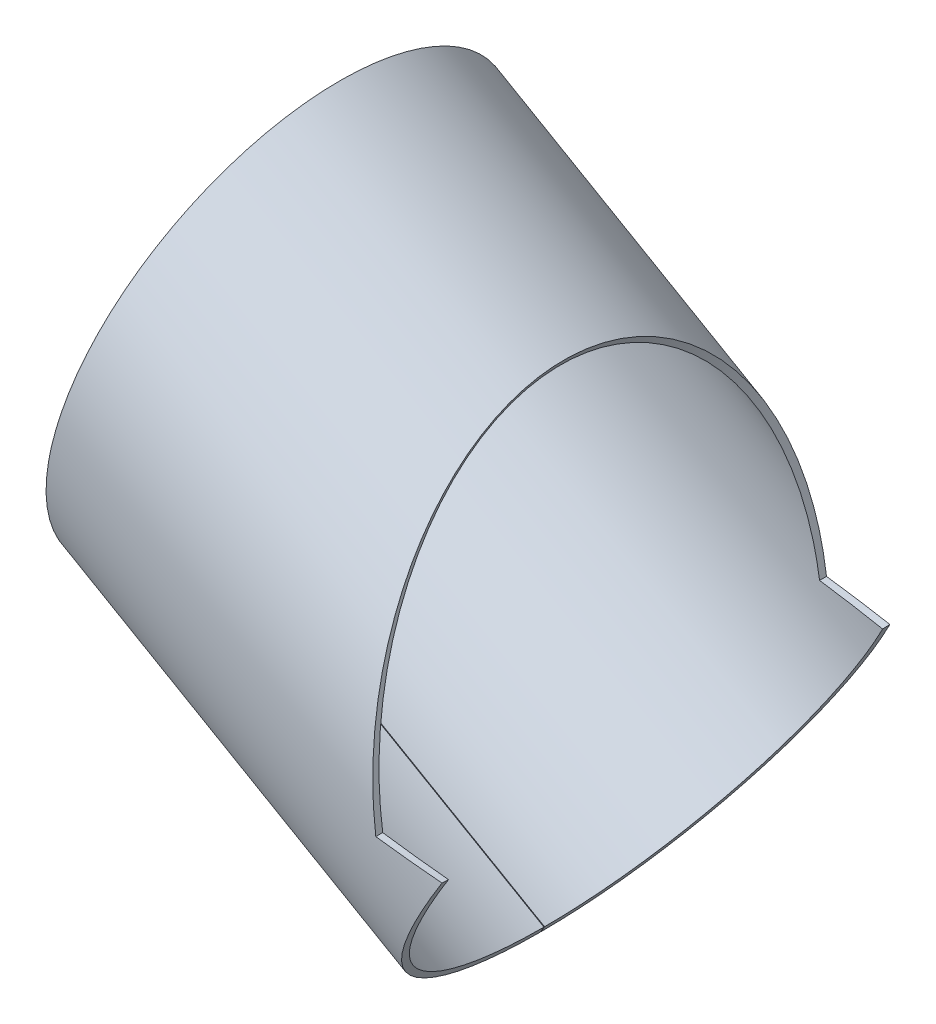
ISO-10303-21;
HEADER;
FILE_DESCRIPTION(('STEP AP214'),'2;1');
FILE_NAME('part.step','',(''),(''),'','','');
FILE_SCHEMA(('AUTOMOTIVE_DESIGN { 1 0 10303 214 1 1 1 1 }'));
ENDSEC;
DATA;
#1=APPLICATION_CONTEXT('core data for automotive mechanical design processes');
#2=APPLICATION_PROTOCOL_DEFINITION('international standard','automotive_design',2000,#1);
#3=PRODUCT_CONTEXT('',#1,'mechanical');
#4=PRODUCT('Part','Part','',(#3));
#5=PRODUCT_RELATED_PRODUCT_CATEGORY('part','',(#4));
#6=PRODUCT_DEFINITION_FORMATION('','',#4);
#7=PRODUCT_DEFINITION_CONTEXT('part definition',#1,'design');
#8=PRODUCT_DEFINITION('design','',#6,#7);
#9=PRODUCT_DEFINITION_SHAPE('','',#8);
#10=(LENGTH_UNIT() NAMED_UNIT(*) SI_UNIT(.MILLI.,.METRE.));
#11=(NAMED_UNIT(*) PLANE_ANGLE_UNIT() SI_UNIT($,.RADIAN.));
#12=(NAMED_UNIT(*) SI_UNIT($,.STERADIAN.) SOLID_ANGLE_UNIT());
#13=UNCERTAINTY_MEASURE_WITH_UNIT(LENGTH_MEASURE(1.E-05),#10,'distance_accuracy_value','');
#14=(GEOMETRIC_REPRESENTATION_CONTEXT(3) GLOBAL_UNCERTAINTY_ASSIGNED_CONTEXT((#13)) GLOBAL_UNIT_ASSIGNED_CONTEXT((#10,
#11,#12)) REPRESENTATION_CONTEXT('',''));
#15=CARTESIAN_POINT('',(0.,0.,0.));
#16=DIRECTION('',(0.,0.,1.));
#17=DIRECTION('',(1.,0.,0.));
#18=AXIS2_PLACEMENT_3D('',#15,#16,#17);
#19=CARTESIAN_POINT('',(-582.083345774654,549.686006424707,-0.484615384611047));
#20=DIRECTION('',(-0.000769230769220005,-0.00133234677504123,0.999998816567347));
#21=DIRECTION('',(-0.866025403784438,0.500000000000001,0.));
#22=AXIS2_PLACEMENT_3D('',#19,#20,#21);
#23=PLANE('',#22);
#24=DIRECTION('',(-0.499999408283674,-0.866024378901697,-0.00153846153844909));
#25=VECTOR('',#24,1.);
#26=CARTESIAN_POINT('',(-350.032493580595,415.711384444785,-0.48461538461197));
#27=LINE('',#26,#25);
#28=CARTESIAN_POINT('',(-350.032493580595,415.711384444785,-0.48461538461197));
#29=VERTEX_POINT('',#28);
#30=CARTESIAN_POINT('',(-355.032487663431,407.051140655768,-0.499999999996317));
#31=VERTEX_POINT('',#30);
#32=EDGE_CURVE('E13',#29,#31,#27,.T.);
#33=ORIENTED_EDGE('',*,*,#32,.F.);
#34=DIRECTION('',(-0.866025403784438,0.500000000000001,0.));
#35=VECTOR('',#34,1.);
#36=CARTESIAN_POINT('',(-350.032493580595,415.711384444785,-0.48461538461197));
#37=LINE('',#36,#35);
#38=CARTESIAN_POINT('',(-814.134197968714,683.66062840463,-0.48461538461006));
#39=VERTEX_POINT('',#38);
#40=EDGE_CURVE('E390',#29,#39,#37,.T.);
#41=ORIENTED_EDGE('',*,*,#40,.T.);
#42=CARTESIAN_POINT('',(-819.13419205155,675.000384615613,-0.499999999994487));
#43=CARTESIAN_POINT('',(-814.134197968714,683.66062840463,-0.48461538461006));
#44=B_SPLINE_CURVE_WITH_KNOTS('',1,(#42,#43),.UNSPECIFIED.,.F.,.F.,(2,2),(0.,1.),.UNSPECIFIED.);
#45=CARTESIAN_POINT('',(-819.13419205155,675.000384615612,-0.499999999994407));
#46=VERTEX_POINT('',#45);
#47=EDGE_CURVE('E55',#39,#46,#44,.F.);
#48=ORIENTED_EDGE('',*,*,#47,.T.);
#49=DIRECTION('',(0.866025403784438,-0.5,0.));
#50=VECTOR('',#49,1.);
#51=CARTESIAN_POINT('',(-2642.31257856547,1727.61291685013,-0.499999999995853));
#52=LINE('',#51,#50);
#53=EDGE_CURVE('E144',#31,#46,#52,.F.);
#54=ORIENTED_EDGE('',*,*,#53,.F.);
#55=EDGE_LOOP('',(#33,#41,#48,#54));
#56=FACE_BOUND('',#55,.T.);
#57=ADVANCED_FACE('F43',(#56),#23,.T.);
#58=CARTESIAN_POINT('',(-819.13419205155,675.000384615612,0.499999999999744));
#59=CARTESIAN_POINT('',(-819.134345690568,675.002088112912,1.40899300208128));
#60=CARTESIAN_POINT('',(-819.132920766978,675.007045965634,2.21558701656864));
#61=CARTESIAN_POINT('',(-819.130130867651,675.016393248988,3.27186858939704));
#62=CARTESIAN_POINT('',(-819.129087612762,675.019835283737,3.59836113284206));
#63=CARTESIAN_POINT('',(-819.127005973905,675.026971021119,4.20014548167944));
#64=CARTESIAN_POINT('',(-819.126018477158,675.03056264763,4.46780558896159));
#65=CARTESIAN_POINT('',(-819.12095531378,675.049561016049,5.7724583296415));
#66=CARTESIAN_POINT('',(-819.115545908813,675.069961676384,6.82687153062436));
#67=CARTESIAN_POINT('',(-819.094771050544,675.147583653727,10.0220159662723));
#68=CARTESIAN_POINT('',(-819.075082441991,675.220899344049,12.1719538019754));
#69=CARTESIAN_POINT('',(-818.999052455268,675.504785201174,18.6092452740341));
#70=CARTESIAN_POINT('',(-818.925352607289,675.779792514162,22.9079744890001));
#71=CARTESIAN_POINT('',(-818.6358700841,676.860114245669,35.7727970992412));
#72=CARTESIAN_POINT('',(-818.351517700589,677.921458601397,44.3272897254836));
#73=CARTESIAN_POINT('',(-817.599365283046,680.728358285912,61.3606467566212));
#74=CARTESIAN_POINT('',(-817.132186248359,682.472204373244,69.8317439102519));
#75=CARTESIAN_POINT('',(-816.012003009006,686.654024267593,86.6866146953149));
#76=CARTESIAN_POINT('',(-815.358986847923,689.091378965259,95.0648037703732));
#77=CARTESIAN_POINT('',(-813.866766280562,694.659565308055,111.663687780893));
#78=CARTESIAN_POINT('',(-813.027880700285,697.789238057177,119.881651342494));
#79=CARTESIAN_POINT('',(-811.164793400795,704.743076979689,136.111161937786));
#80=CARTESIAN_POINT('',(-810.137720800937,708.577403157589,144.145955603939));
#81=CARTESIAN_POINT('',(-807.890561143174,716.964257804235,159.987290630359));
#82=CARTESIAN_POINT('',(-806.670464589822,721.516802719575,167.793813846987));
#83=CARTESIAN_POINT('',(-804.038590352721,731.337785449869,183.107527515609));
#84=CARTESIAN_POINT('',(-802.627591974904,736.60469229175,190.615276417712));
#85=CARTESIAN_POINT('',(-799.594706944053,747.925243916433,205.352084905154));
#86=CARTESIAN_POINT('',(-797.974749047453,753.970852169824,212.567869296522));
#87=CARTESIAN_POINT('',(-795.389673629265,763.617030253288,223.0934417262));
#88=CARTESIAN_POINT('',(-794.502164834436,766.928648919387,226.55224345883));
#89=CARTESIAN_POINT('',(-792.676033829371,773.743436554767,233.358452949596));
#90=CARTESIAN_POINT('',(-791.736504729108,777.250289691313,236.709936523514));
#91=CARTESIAN_POINT('',(-788.825770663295,788.115269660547,246.629117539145));
#92=CARTESIAN_POINT('',(-786.766453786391,795.801667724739,253.045067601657));
#93=CARTESIAN_POINT('',(-783.498086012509,807.997875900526,262.271006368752));
#94=CARTESIAN_POINT('',(-782.378798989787,812.174263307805,265.279910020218));
#95=CARTESIAN_POINT('',(-780.081243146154,820.747829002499,271.146913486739));
#96=CARTESIAN_POINT('',(-778.904119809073,825.141118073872,274.003099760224));
#97=CARTESIAN_POINT('',(-776.474887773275,834.20733648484,279.582029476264));
#98=CARTESIAN_POINT('',(-775.224580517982,838.87348592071,282.299844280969));
#99=CARTESIAN_POINT('',(-772.652690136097,848.471680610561,287.565877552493));
#100=CARTESIAN_POINT('',(-771.331987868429,853.40075392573,290.113356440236));
#101=CARTESIAN_POINT('',(-768.59855202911,863.602297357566,295.047042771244));
#102=CARTESIAN_POINT('',(-767.18824702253,868.865454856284,297.42786894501));
#103=CARTESIAN_POINT('',(-765.007660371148,877.00333418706,300.8412766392));
#104=CARTESIAN_POINT('',(-764.270616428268,879.754054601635,301.951966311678));
#105=CARTESIAN_POINT('',(-762.76512038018,885.372849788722,304.129392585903));
#106=CARTESIAN_POINT('',(-761.997774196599,888.236736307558,305.194292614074));
#107=CARTESIAN_POINT('',(-760.433781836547,894.073666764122,307.268929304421));
#108=CARTESIAN_POINT('',(-759.637135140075,897.046711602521,308.278665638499));
#109=CARTESIAN_POINT('',(-758.014611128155,903.101838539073,310.235181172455));
#110=CARTESIAN_POINT('',(-757.191110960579,906.175049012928,311.179421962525));
#111=CARTESIAN_POINT('',(-754.65995071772,915.621769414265,313.924065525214));
#112=CARTESIAN_POINT('',(-752.879719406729,922.266096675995,315.648130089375));
#113=CARTESIAN_POINT('',(-750.53784284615,931.005684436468,317.597209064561));
#114=CARTESIAN_POINT('',(-750.06365310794,932.775285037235,317.976696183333));
#115=CARTESIAN_POINT('',(-749.103693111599,936.357768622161,318.713053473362));
#116=CARTESIAN_POINT('',(-748.620272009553,938.161878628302,319.068342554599));
#117=CARTESIAN_POINT('',(-747.129734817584,943.724939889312,320.113031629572));
#118=CARTESIAN_POINT('',(-746.084345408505,947.626895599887,320.77905423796));
#119=CARTESIAN_POINT('',(-743.889412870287,955.818616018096,322.009548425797));
#120=CARTESIAN_POINT('',(-742.739857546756,960.108401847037,322.574016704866));
#121=CARTESIAN_POINT('',(-741.238164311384,965.712413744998,323.188229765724));
#122=CARTESIAN_POINT('',(-740.934591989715,966.845298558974,323.306494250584));
#123=CARTESIAN_POINT('',(-740.474401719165,968.562717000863,323.476472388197));
#124=CARTESIAN_POINT('',(-740.321972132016,969.131574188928,323.53129745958));
#125=CARTESIAN_POINT('',(-740.001864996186,970.32635294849,323.64306548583));
#126=CARTESIAN_POINT('',(-739.8351709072,970.94858857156,323.699607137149));
#127=CARTESIAN_POINT('',(-738.968426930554,974.184120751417,323.983463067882));
#128=CARTESIAN_POINT('',(-738.168513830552,977.170553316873,324.214907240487));
#129=CARTESIAN_POINT('',(-736.354371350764,983.941649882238,324.620733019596));
#130=CARTESIAN_POINT('',(-735.340096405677,987.726392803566,324.795111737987));
#131=CARTESIAN_POINT('',(-733.658291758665,994.001583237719,324.951374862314));
#132=CARTESIAN_POINT('',(-733.070976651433,996.192960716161,324.985774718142));
#133=CARTESIAN_POINT('',(-732.150203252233,999.629030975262,325.001806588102));
#134=CARTESIAN_POINT('',(-731.833289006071,1000.8118107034,325.001007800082));
#135=CARTESIAN_POINT('',(-731.218931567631,1003.10442996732,324.987194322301));
#136=CARTESIAN_POINT('',(-730.918284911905,1004.22628134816,324.974372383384));
#137=CARTESIAN_POINT('',(-728.271486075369,1014.10241682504,324.812569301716));
#138=CARTESIAN_POINT('',(-726.340082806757,1021.3102384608,324.349882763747));
#139=CARTESIAN_POINT('',(-724.452768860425,1028.35577758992,323.763718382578));
#140=CARTESIAN_POINT('',(-724.101575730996,1029.66680748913,323.645430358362));
#141=CARTESIAN_POINT('',(-723.614025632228,1031.48652105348,323.471745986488));
#142=CARTESIAN_POINT('',(-723.458259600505,1032.06782579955,323.41459548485));
#143=CARTESIAN_POINT('',(-723.144613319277,1033.23834235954,323.296394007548));
#144=CARTESIAN_POINT('',(-722.988627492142,1033.82046580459,323.23600458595));
#145=CARTESIAN_POINT('',(-722.212893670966,1036.71539370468,322.927859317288));
#146=CARTESIAN_POINT('',(-721.605736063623,1038.98112248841,322.661519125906));
#147=CARTESIAN_POINT('',(-719.824778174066,1045.62727577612,321.812202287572));
#148=CARTESIAN_POINT('',(-718.691538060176,1049.85658886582,321.1790633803));
#149=CARTESIAN_POINT('',(-717.072761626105,1055.89839906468,320.163291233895));
#150=CARTESIAN_POINT('',(-716.546671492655,1057.86199658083,319.813656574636));
#151=CARTESIAN_POINT('',(-715.521366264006,1061.68873658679,319.097617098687));
#152=CARTESIAN_POINT('',(-715.023836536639,1063.54553033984,318.732646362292));
#153=CARTESIAN_POINT('',(-713.543519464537,1069.06996354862,317.597974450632));
#154=CARTESIAN_POINT('',(-712.580912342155,1072.66220981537,316.7935703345));
#155=CARTESIAN_POINT('',(-710.70455641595,1079.66473580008,315.105520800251));
#156=CARTESIAN_POINT('',(-709.790805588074,1083.0750190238,314.221876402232));
#157=CARTESIAN_POINT('',(-708.012030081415,1089.71384784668,312.391228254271));
#158=CARTESIAN_POINT('',(-707.149947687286,1092.93131107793,311.447771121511));
#159=CARTESIAN_POINT('',(-704.609775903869,1102.41113190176,308.513730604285));
#160=CARTESIAN_POINT('',(-702.977692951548,1108.50189929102,306.417253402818));
#161=CARTESIAN_POINT('',(-699.836792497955,1120.2242799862,302.01047781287));
#162=CARTESIAN_POINT('',(-698.331219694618,1125.84317823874,299.706811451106));
#163=CARTESIAN_POINT('',(-695.402995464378,1136.7711707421,294.880169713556));
#164=CARTESIAN_POINT('',(-693.9847776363,1142.06412969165,292.362410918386));
#165=CARTESIAN_POINT('',(-691.239936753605,1152.30830865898,287.1588179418));
#166=CARTESIAN_POINT('',(-689.911830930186,1157.26467576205,284.471115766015));
#167=CARTESIAN_POINT('',(-687.325652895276,1166.91627868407,278.917448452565));
#168=CARTESIAN_POINT('',(-686.070243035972,1171.60168153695,276.056351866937));
#169=CARTESIAN_POINT('',(-683.63449870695,1180.69218006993,270.193617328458));
#170=CARTESIAN_POINT('',(-682.451284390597,1185.10746873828,267.185814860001));
#171=CARTESIAN_POINT('',(-678.99072577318,1198.02035864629,257.924473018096));
#172=CARTESIAN_POINT('',(-676.809424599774,1206.16048106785,251.448668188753));
#173=CARTESIAN_POINT('',(-673.726822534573,1217.66667179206,241.396097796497));
#174=CARTESIAN_POINT('',(-672.730765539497,1221.38487728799,237.98868361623));
#175=CARTESIAN_POINT('',(-670.8008233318,1228.58826038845,231.078620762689));
#176=CARTESIAN_POINT('',(-669.86613907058,1232.07615572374,227.57384342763));
#177=CARTESIAN_POINT('',(-667.139739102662,1242.24972465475,216.879674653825));
#178=CARTESIAN_POINT('',(-665.431120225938,1248.62544937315,209.528987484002));
#179=CARTESIAN_POINT('',(-662.233242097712,1260.56116926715,194.486386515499));
#180=CARTESIAN_POINT('',(-660.745646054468,1266.11463048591,186.804614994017));
#181=CARTESIAN_POINT('',(-657.977799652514,1276.44361252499,171.148572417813));
#182=CARTESIAN_POINT('',(-656.69497960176,1281.2299169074,163.156100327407));
#183=CARTESIAN_POINT('',(-654.333596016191,1290.04260132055,146.919893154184));
#184=CARTESIAN_POINT('',(-653.255021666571,1294.06900008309,138.676179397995));
#185=CARTESIAN_POINT('',(-651.300415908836,1301.36484125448,122.012226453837));
#186=CARTESIAN_POINT('',(-650.422405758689,1304.64065313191,113.579030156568));
#187=CARTESIAN_POINT('',(-648.861423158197,1310.46527682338,96.5264093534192));
#188=CARTESIAN_POINT('',(-648.179390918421,1313.0107925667,87.9144349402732));
#189=CARTESIAN_POINT('',(-647.012070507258,1317.3685333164,70.5834394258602));
#190=CARTESIAN_POINT('',(-646.526882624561,1319.17981486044,61.8721766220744));
#191=CARTESIAN_POINT('',(-645.359726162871,1323.53430391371,35.5818548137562));
#192=CARTESIAN_POINT('',(-644.970102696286,1324.98957660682,17.863154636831));
#193=CARTESIAN_POINT('',(-644.964567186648,1325.01031158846,-17.4820248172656));
#194=CARTESIAN_POINT('',(-645.348555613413,1323.57590557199,-35.2014227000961));
#195=CARTESIAN_POINT('',(-646.507442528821,1319.25233716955,-61.4968554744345));
#196=CARTESIAN_POINT('',(-646.989886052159,1317.45138903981,-70.2098275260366));
#197=CARTESIAN_POINT('',(-648.151664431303,1313.11431582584,-87.5449848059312));
#198=CARTESIAN_POINT('',(-648.830930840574,1310.57906863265,-96.1596261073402));
#199=CARTESIAN_POINT('',(-650.386465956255,1304.77472377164,-113.218739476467));
#200=CARTESIAN_POINT('',(-651.261867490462,1301.50868921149,-121.656251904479));
#201=CARTESIAN_POINT('',(-653.211018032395,1294.23330841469,-138.327184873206));
#202=CARTESIAN_POINT('',(-654.286858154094,1290.21710939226,-146.574839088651));
#203=CARTESIAN_POINT('',(-656.642800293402,1281.42469385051,-162.819858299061));
#204=CARTESIAN_POINT('',(-657.92291312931,1276.64845859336,-170.817202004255));
#205=CARTESIAN_POINT('',(-660.685415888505,1266.3394083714,-186.48394282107));
#206=CARTESIAN_POINT('',(-662.17004547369,1260.79701659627,-194.169884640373));
#207=CARTESIAN_POINT('',(-665.362136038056,1248.88284650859,-209.223054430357));
#208=CARTESIAN_POINT('',(-667.067851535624,1242.51793055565,-216.579583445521));
#209=CARTESIAN_POINT('',(-669.789923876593,1232.36055310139,-227.283420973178));
#210=CARTESIAN_POINT('',(-670.723232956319,1228.87783098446,-230.79175591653));
#211=CARTESIAN_POINT('',(-672.649861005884,1221.6868840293,-237.707343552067));
#212=CARTESIAN_POINT('',(-673.644252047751,1217.97489733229,-241.117768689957));
#213=CARTESIAN_POINT('',(-676.72185552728,1206.48732032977,-251.180138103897));
#214=CARTESIAN_POINT('',(-678.899822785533,1198.35955112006,-257.663498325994));
#215=CARTESIAN_POINT('',(-682.355492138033,1185.46490985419,-266.937770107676));
#216=CARTESIAN_POINT('',(-683.53729203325,1181.05495850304,-269.950577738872));
#217=CARTESIAN_POINT('',(-685.969150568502,1171.97898408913,-275.821380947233));
#218=CARTESIAN_POINT('',(-687.22263141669,1167.30076355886,-278.686922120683));
#219=CARTESIAN_POINT('',(-689.805014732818,1157.66330426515,-284.250302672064));
#220=CARTESIAN_POINT('',(-691.131375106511,1152.71347366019,-286.943446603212));
#221=CARTESIAN_POINT('',(-693.871675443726,1142.48625379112,-292.156812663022));
#222=CARTESIAN_POINT('',(-695.287647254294,1137.20165049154,-294.680019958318));
#223=CARTESIAN_POINT('',(-698.211481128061,1126.29002939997,-299.518690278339));
#224=CARTESIAN_POINT('',(-699.714590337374,1120.68037192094,-301.828352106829));
#225=CARTESIAN_POINT('',(-702.849632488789,1108.97983567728,-306.247432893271));
#226=CARTESIAN_POINT('',(-704.478833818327,1102.899781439,-308.350928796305));
#227=CARTESIAN_POINT('',(-707.014823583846,1093.43559700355,-311.296814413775));
#228=CARTESIAN_POINT('',(-707.874652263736,1090.2265795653,-312.243444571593));
#229=CARTESIAN_POINT('',(-709.648826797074,1083.60491921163,-314.081222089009));
#230=CARTESIAN_POINT('',(-710.560293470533,1080.20314032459,-314.968830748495));
#231=CARTESIAN_POINT('',(-712.432136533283,1073.21742375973,-316.665627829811));
#232=CARTESIAN_POINT('',(-713.392514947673,1069.63348257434,-317.474815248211));
#233=CARTESIAN_POINT('',(-714.869549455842,1064.12132478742,-318.617288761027));
#234=CARTESIAN_POINT('',(-715.365550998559,1062.2702639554,-318.984589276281));
#235=CARTESIAN_POINT('',(-716.385657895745,1058.46296324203,-319.704289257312));
#236=CARTESIAN_POINT('',(-716.909154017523,1056.50904825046,-320.056018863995));
#237=CARTESIAN_POINT('',(-718.52017580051,1050.49615361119,-321.078900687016));
#238=CARTESIAN_POINT('',(-719.648282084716,1046.28594253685,-321.717879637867));
#239=CARTESIAN_POINT('',(-721.421650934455,1039.66807962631,-322.577722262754));
#240=CARTESIAN_POINT('',(-722.026297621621,1037.41172028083,-322.847865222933));
#241=CARTESIAN_POINT('',(-722.953448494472,1033.95175515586,-323.223798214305));
#242=CARTESIAN_POINT('',(-723.265861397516,1032.78586392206,-323.344226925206));
#243=CARTESIAN_POINT('',(-723.897384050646,1030.42899155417,-323.574533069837));
#244=CARTESIAN_POINT('',(-724.236871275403,1029.16172934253,-323.691953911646));
#245=CARTESIAN_POINT('',(-726.071372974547,1022.31341781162,-324.279714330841));
#246=CARTESIAN_POINT('',(-727.959939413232,1015.26473340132,-324.755774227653));
#247=CARTESIAN_POINT('',(-730.558843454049,1005.56749418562,-324.954094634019));
#248=CARTESIAN_POINT('',(-730.854174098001,1004.46551569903,-324.971272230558));
#249=CARTESIAN_POINT('',(-731.45791685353,1002.21262276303,-324.994420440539));
#250=CARTESIAN_POINT('',(-731.768574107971,1001.05329035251,-325.000382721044));
#251=CARTESIAN_POINT('',(-732.705406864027,997.557051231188,-324.99917653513));
#252=CARTESIAN_POINT('',(-733.303492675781,995.325423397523,-324.973376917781));
#253=CARTESIAN_POINT('',(-735.017729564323,988.929195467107,-324.839381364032));
#254=CARTESIAN_POINT('',(-736.053781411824,985.063387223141,-324.675135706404));
#255=CARTESIAN_POINT('',(-737.911522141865,978.129874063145,-324.281884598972));
#256=CARTESIAN_POINT('',(-738.733257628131,975.062088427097,-324.052882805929));
#257=CARTESIAN_POINT('',(-739.627229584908,971.724820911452,-323.768373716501));
#258=CARTESIAN_POINT('',(-739.799367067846,971.082235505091,-323.711516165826));
#259=CARTESIAN_POINT('',(-740.130355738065,969.846753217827,-323.598773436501));
#260=CARTESIAN_POINT('',(-740.28776623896,969.259249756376,-323.543413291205));
#261=CARTESIAN_POINT('',(-740.750167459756,967.533553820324,-323.376353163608));
#262=CARTESIAN_POINT('',(-741.055213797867,966.395156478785,-323.259953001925));
#263=CARTESIAN_POINT('',(-742.564273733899,960.763617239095,-322.654666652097));
#264=CARTESIAN_POINT('',(-743.719710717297,956.451924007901,-322.096076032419));
#265=CARTESIAN_POINT('',(-745.926304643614,948.216753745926,-320.875071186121));
#266=CARTESIAN_POINT('',(-746.977473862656,944.293255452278,-320.212660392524));
#267=CARTESIAN_POINT('',(-748.476561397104,938.698228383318,-319.171884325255));
#268=CARTESIAN_POINT('',(-748.961787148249,936.887357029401,-318.818375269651));
#269=CARTESIAN_POINT('',(-749.924625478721,933.294116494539,-318.085971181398));
#270=CARTESIAN_POINT('',(-750.400252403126,931.519151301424,-317.708347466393));
#271=CARTESIAN_POINT('',(-752.749297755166,922.752822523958,-315.768037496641));
#272=CARTESIAN_POINT('',(-754.535207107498,916.087368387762,-314.04923453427));
#273=CARTESIAN_POINT('',(-757.07468646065,906.609551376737,-311.310199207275));
#274=CARTESIAN_POINT('',(-757.899852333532,903.530107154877,-310.36868587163));
#275=CARTESIAN_POINT('',(-759.526261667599,897.460481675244,-308.416605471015));
#276=CARTESIAN_POINT('',(-760.324841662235,894.480230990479,-307.40884784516));
#277=CARTESIAN_POINT('',(-761.892672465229,888.628992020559,-305.33771440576));
#278=CARTESIAN_POINT('',(-762.661923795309,885.758002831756,-304.274338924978));
#279=CARTESIAN_POINT('',(-764.171193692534,880.125119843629,-302.099531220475));
#280=CARTESIAN_POINT('',(-764.910025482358,877.367709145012,-300.990037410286));
#281=CARTESIAN_POINT('',(-767.095195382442,869.21270950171,-297.580917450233));
#282=CARTESIAN_POINT('',(-768.508524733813,863.938284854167,-295.202312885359));
#283=CARTESIAN_POINT('',(-771.247904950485,853.714572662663,-290.271901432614));
#284=CARTESIAN_POINT('',(-772.571477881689,848.774762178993,-287.72552614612));
#285=CARTESIAN_POINT('',(-775.148474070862,839.15750905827,-282.46191662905));
#286=CARTESIAN_POINT('',(-776.401299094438,834.481977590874,-279.744855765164));
#287=CARTESIAN_POINT('',(-778.83547023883,825.397334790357,-274.166587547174));
#288=CARTESIAN_POINT('',(-780.014949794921,820.995224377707,-271.310427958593));
#289=CARTESIAN_POINT('',(-782.316786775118,812.405648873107,-265.443718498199));
#290=CARTESIAN_POINT('',(-783.438174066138,808.221428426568,-262.434645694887));
#291=CARTESIAN_POINT('',(-786.712700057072,796.002274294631,-253.207333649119));
#292=CARTESIAN_POINT('',(-788.775930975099,788.301318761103,-246.789314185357));
#293=CARTESIAN_POINT('',(-792.664272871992,773.787185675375,-233.557725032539));
#294=CARTESIAN_POINT('',(-794.488760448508,766.978765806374,-226.752895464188));
#295=CARTESIAN_POINT('',(-797.941626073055,754.094434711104,-212.711295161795));
#296=CARTESIAN_POINT('',(-799.56444650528,748.038163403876,-205.491073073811));
#297=CARTESIAN_POINT('',(-802.602653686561,736.697771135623,-190.744313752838));
#298=CARTESIAN_POINT('',(-804.016104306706,731.421708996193,-183.231050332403));
#299=CARTESIAN_POINT('',(-806.652362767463,721.584361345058,-167.906377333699));
#300=CARTESIAN_POINT('',(-807.874465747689,717.024326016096,-160.093993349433));
#301=CARTESIAN_POINT('',(-810.125267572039,708.623873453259,-144.240403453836));
#302=CARTESIAN_POINT('',(-811.153975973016,704.783439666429,-136.199215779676));
#303=CARTESIAN_POINT('',(-813.019979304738,697.818742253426,-119.956597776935));
#304=CARTESIAN_POINT('',(-813.860118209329,694.684404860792,-111.732185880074));
#305=CARTESIAN_POINT('',(-815.354556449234,689.107950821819,-95.1196841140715));
#306=CARTESIAN_POINT('',(-816.008516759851,686.667068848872,-86.7344979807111));
#307=CARTESIAN_POINT('',(-817.130260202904,682.479405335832,-69.8654160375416));
#308=CARTESIAN_POINT('',(-817.598050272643,680.733260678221,-61.3872562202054));
#309=CARTESIAN_POINT('',(-818.351162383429,677.922806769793,-44.3385901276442));
#310=CARTESIAN_POINT('',(-818.635827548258,676.860256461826,-35.7763258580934));
#311=CARTESIAN_POINT('',(-818.925562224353,675.77900241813,-22.8976729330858));
#312=CARTESIAN_POINT('',(-818.999302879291,675.503837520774,-18.5940693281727));
#313=CARTESIAN_POINT('',(-819.0626569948,675.267298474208,-13.2224829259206));
#314=CARTESIAN_POINT('',(-819.073888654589,675.225365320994,-12.1488866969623));
#315=CARTESIAN_POINT('',(-819.093500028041,675.152202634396,-10.0032441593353));
#316=CARTESIAN_POINT('',(-819.101935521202,675.120870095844,-8.92596632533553));
#317=CARTESIAN_POINT('',(-819.115691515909,675.069396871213,-6.79976751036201));
#318=CARTESIAN_POINT('',(-819.120999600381,675.049282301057,-5.75462064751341));
#319=CARTESIAN_POINT('',(-819.125998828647,675.030601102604,-4.47070124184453));
#320=CARTESIAN_POINT('',(-819.126978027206,675.027064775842,-4.20732083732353));
#321=CARTESIAN_POINT('',(-819.129060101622,675.019979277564,-3.6106326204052));
#322=CARTESIAN_POINT('',(-819.130110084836,675.016539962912,-3.28547877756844));
#323=CARTESIAN_POINT('',(-819.132924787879,675.007159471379,-2.22958481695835));
#324=CARTESIAN_POINT('',(-819.134374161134,675.002121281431,-1.41841116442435));
#325=CARTESIAN_POINT('',(-819.13419205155,675.000384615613,-0.499999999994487));
#326=CARTESIAN_POINT('',(-814.134197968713,683.660628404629,0.484615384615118));
#327=CARTESIAN_POINT('',(-814.134373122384,683.662294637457,1.36563937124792));
#328=CARTESIAN_POINT('',(-814.133025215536,683.66711909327,2.14741510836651));
#329=CARTESIAN_POINT('',(-814.130381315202,683.676213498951,3.17119570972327));
#330=CARTESIAN_POINT('',(-814.129391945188,683.679562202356,3.4876423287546));
#331=CARTESIAN_POINT('',(-814.127421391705,683.686505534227,4.07091023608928));
#332=CARTESIAN_POINT('',(-814.126489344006,683.690001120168,4.33033464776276));
#333=CARTESIAN_POINT('',(-814.121718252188,683.708493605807,5.59484422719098));
#334=CARTESIAN_POINT('',(-814.116622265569,683.728351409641,6.61681394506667));
#335=CARTESIAN_POINT('',(-814.097041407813,683.803905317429,9.71364624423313));
#336=CARTESIAN_POINT('',(-814.078481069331,683.875266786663,11.79743214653));
#337=CARTESIAN_POINT('',(-814.006818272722,684.151588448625,18.0366531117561));
#338=CARTESIAN_POINT('',(-813.937349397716,684.419267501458,22.2031137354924));
#339=CARTESIAN_POINT('',(-813.664487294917,685.470801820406,34.6720956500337));
#340=CARTESIAN_POINT('',(-813.396463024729,686.503865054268,42.9633731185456));
#341=CARTESIAN_POINT('',(-812.687494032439,689.2359688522,59.4726268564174));
#342=CARTESIAN_POINT('',(-812.24714275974,690.933347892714,67.6830748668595));
#343=CARTESIAN_POINT('',(-811.191292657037,695.003739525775,84.0193342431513));
#344=CARTESIAN_POINT('',(-810.575773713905,697.37614713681,92.1397328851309));
#345=CARTESIAN_POINT('',(-809.16921931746,702.795955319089,108.22788200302));
#346=CARTESIAN_POINT('',(-808.378484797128,705.842227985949,116.19298514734));
#347=CARTESIAN_POINT('',(-806.622378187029,712.610770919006,131.923126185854));
#348=CARTESIAN_POINT('',(-805.654292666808,716.342928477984,139.71069543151));
#349=CARTESIAN_POINT('',(-803.536160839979,724.506300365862,155.064604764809));
#350=CARTESIAN_POINT('',(-802.386105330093,728.937530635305,162.63092726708));
#351=CARTESIAN_POINT('',(-799.905325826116,738.496809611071,177.473449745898));
#352=CARTESIAN_POINT('',(-798.575354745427,743.623373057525,184.750190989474));
#353=CARTESIAN_POINT('',(-795.716628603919,754.642272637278,199.033559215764));
#354=CARTESIAN_POINT('',(-794.189680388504,760.52678339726,206.027319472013));
#355=CARTESIAN_POINT('',(-791.753010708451,769.915915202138,216.229028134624));
#356=CARTESIAN_POINT('',(-790.916451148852,773.139287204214,219.581405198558));
#357=CARTESIAN_POINT('',(-789.195163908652,779.772480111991,226.178192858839));
#358=CARTESIAN_POINT('',(-788.309585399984,783.185888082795,229.426553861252));
#359=CARTESIAN_POINT('',(-785.566000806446,793.761356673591,239.040529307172));
#360=CARTESIAN_POINT('',(-783.624934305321,801.24293907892,245.259065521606));
#361=CARTESIAN_POINT('',(-780.544203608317,813.114150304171,254.201129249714));
#362=CARTESIAN_POINT('',(-779.489170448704,817.179246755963,257.117451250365));
#363=CARTESIAN_POINT('',(-777.323517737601,825.524349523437,262.803931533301));
#364=CARTESIAN_POINT('',(-776.213983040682,829.800571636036,265.572235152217));
#365=CARTESIAN_POINT('',(-773.924230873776,838.625203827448,270.979505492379));
#366=CARTESIAN_POINT('',(-772.745710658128,843.167014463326,273.61369522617));
#367=CARTESIAN_POINT('',(-770.321485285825,852.509445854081,278.717696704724));
#368=CARTESIAN_POINT('',(-769.076614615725,857.307174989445,281.18679162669));
#369=CARTESIAN_POINT('',(-766.500125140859,867.236879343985,285.968672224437));
#370=CARTESIAN_POINT('',(-765.17079214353,872.35978920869,288.276242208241));
#371=CARTESIAN_POINT('',(-763.115404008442,880.280818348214,291.584621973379));
#372=CARTESIAN_POINT('',(-762.420678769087,882.958240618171,292.661136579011));
#373=CARTESIAN_POINT('',(-761.001625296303,888.427312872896,294.771565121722));
#374=CARTESIAN_POINT('',(-760.278338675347,891.214885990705,295.803698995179));
#375=CARTESIAN_POINT('',(-758.804145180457,896.896280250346,297.814500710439));
#376=CARTESIAN_POINT('',(-758.053237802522,899.790102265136,298.793168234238));
#377=CARTESIAN_POINT('',(-756.523870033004,905.683877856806,300.689483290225));
#378=CARTESIAN_POINT('',(-755.74765030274,908.675196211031,301.604670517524));
#379=CARTESIAN_POINT('',(-753.361823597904,917.87019154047,304.264863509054));
#380=CARTESIAN_POINT('',(-751.683811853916,924.337469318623,305.935879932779));
#381=CARTESIAN_POINT('',(-749.476391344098,932.844172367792,307.82498724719));
#382=CARTESIAN_POINT('',(-749.029426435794,934.566618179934,308.19279783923));
#383=CARTESIAN_POINT('',(-748.124581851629,938.053639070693,308.906497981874));
#384=CARTESIAN_POINT('',(-747.66891637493,939.809674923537,309.250855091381));
#385=CARTESIAN_POINT('',(-746.263964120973,945.224498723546,310.263399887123));
#386=CARTESIAN_POINT('',(-745.278603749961,949.02248109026,310.908929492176));
#387=CARTESIAN_POINT('',(-743.209697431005,956.995917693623,312.101562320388));
#388=CARTESIAN_POINT('',(-742.126139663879,961.171392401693,312.648662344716));
#389=CARTESIAN_POINT('',(-740.710662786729,966.62607318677,313.243976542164));
#390=CARTESIAN_POINT('',(-740.42451959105,967.728769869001,313.358602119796));
#391=CARTESIAN_POINT('',(-739.990751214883,969.400424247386,313.523350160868));
#392=CARTESIAN_POINT('',(-739.847073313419,969.954123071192,313.576488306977));
#393=CARTESIAN_POINT('',(-739.545347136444,971.117065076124,313.684817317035));
#394=CARTESIAN_POINT('',(-739.388225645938,971.722720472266,313.739619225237));
#395=CARTESIAN_POINT('',(-738.571257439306,974.872038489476,314.014741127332));
#396=CARTESIAN_POINT('',(-737.817287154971,977.778895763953,314.23906394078));
#397=CARTESIAN_POINT('',(-736.10731410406,984.369565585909,314.632402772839));
#398=CARTESIAN_POINT('',(-735.151267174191,988.053454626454,314.801415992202));
#399=CARTESIAN_POINT('',(-733.56600678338,994.161425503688,314.952871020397));
#400=CARTESIAN_POINT('',(-733.012406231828,996.294407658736,314.986212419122));
#401=CARTESIAN_POINT('',(-732.144496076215,999.638916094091,315.001751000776));
#402=CARTESIAN_POINT('',(-731.845778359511,1000.79017850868,315.000976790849));
#403=CARTESIAN_POINT('',(-731.266692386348,1003.02170580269,314.987588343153));
#404=CARTESIAN_POINT('',(-730.983305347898,1004.11366264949,314.975160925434));
#405=CARTESIAN_POINT('',(-728.488450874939,1013.72662276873,314.818336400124));
#406=CARTESIAN_POINT('',(-726.667937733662,1020.74237706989,314.369886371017));
#407=CARTESIAN_POINT('',(-724.889012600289,1027.60018126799,313.80175781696));
#408=CARTESIAN_POINT('',(-724.557988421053,1028.87627752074,313.687109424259));
#409=CARTESIAN_POINT('',(-724.09843360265,1030.64750183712,313.518769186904));
#410=CARTESIAN_POINT('',(-723.951610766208,1031.21331651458,313.46337716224));
#411=CARTESIAN_POINT('',(-723.655972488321,1032.35264229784,313.34881265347));
#412=CARTESIAN_POINT('',(-723.508942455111,1032.91925385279,313.290281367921));
#413=CARTESIAN_POINT('',(-722.777746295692,1035.73704025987,312.991617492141));
#414=CARTESIAN_POINT('',(-722.205446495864,1037.94239354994,312.733472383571));
#415=CARTESIAN_POINT('',(-720.526738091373,1044.41144553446,311.910288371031));
#416=CARTESIAN_POINT('',(-719.458564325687,1048.52806040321,311.296630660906));
#417=CARTESIAN_POINT('',(-717.932737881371,1054.40887649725,310.312113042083));
#418=CARTESIAN_POINT('',(-717.436856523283,1056.32015087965,309.973236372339));
#419=CARTESIAN_POINT('',(-716.47042370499,1060.0449208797,309.279228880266));
#420=CARTESIAN_POINT('',(-716.00146006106,1061.85223672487,308.925488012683));
#421=CARTESIAN_POINT('',(-714.606134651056,1067.22946005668,307.825729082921));
#422=CARTESIAN_POINT('',(-713.698793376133,1070.7259830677,307.046075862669));
#423=CARTESIAN_POINT('',(-711.930168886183,1077.54191273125,305.40996631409));
#424=CARTESIAN_POINT('',(-711.06888370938,1080.86132278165,304.553510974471));
#425=CARTESIAN_POINT('',(-709.392243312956,1087.32324840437,302.779190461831));
#426=CARTESIAN_POINT('',(-708.57966008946,1090.45497655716,301.864762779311));
#427=CARTESIAN_POINT('',(-706.185332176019,1099.68218838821,299.021000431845));
#428=CARTESIAN_POINT('',(-704.646953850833,1105.61065460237,296.989030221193));
#429=CARTESIAN_POINT('',(-701.686396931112,1117.02067113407,292.71784772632));
#430=CARTESIAN_POINT('',(-700.267268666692,1122.48984305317,290.485063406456));
#431=CARTESIAN_POINT('',(-697.507167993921,1133.12663701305,285.80693372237));
#432=CARTESIAN_POINT('',(-696.17038010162,1138.27855517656,283.36664442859));
#433=CARTESIAN_POINT('',(-693.583141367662,1148.2497592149,278.32316200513));
#434=CARTESIAN_POINT('',(-692.331287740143,1153.07405364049,275.71815835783));
#435=CARTESIAN_POINT('',(-689.893596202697,1162.46847040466,270.335373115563));
#436=CARTESIAN_POINT('',(-688.71026915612,1167.02902216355,267.562310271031));
#437=CARTESIAN_POINT('',(-686.414378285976,1175.87728740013,261.879967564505));
#438=CARTESIAN_POINT('',(-685.299092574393,1180.17492027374,258.964712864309));
#439=CARTESIAN_POINT('',(-682.037198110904,1192.7437137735,249.98833538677));
#440=CARTESIAN_POINT('',(-679.981130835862,1200.66692472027,243.711786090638));
#441=CARTESIAN_POINT('',(-677.075543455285,1211.86651701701,233.968525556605));
#442=CARTESIAN_POINT('',(-676.13668782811,1215.48564683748,230.665954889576));
#443=CARTESIAN_POINT('',(-674.317565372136,1222.49708449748,223.968509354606));
#444=CARTESIAN_POINT('',(-673.436541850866,1225.89203670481,220.571571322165));
#445=CARTESIAN_POINT('',(-670.866661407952,1235.79450586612,210.206453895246));
#446=CARTESIAN_POINT('',(-669.25613251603,1242.00033374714,203.081941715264));
#447=CARTESIAN_POINT('',(-666.241878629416,1253.61800712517,188.50219000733));
#448=CARTESIAN_POINT('',(-664.83971699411,1259.02349160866,181.056780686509));
#449=CARTESIAN_POINT('',(-662.230779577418,1269.07723521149,165.882462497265));
#450=CARTESIAN_POINT('',(-661.021597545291,1273.73599480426,158.135912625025));
#451=CARTESIAN_POINT('',(-658.795793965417,1282.31384775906,142.399281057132));
#452=CARTESIAN_POINT('',(-657.779161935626,1286.23295927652,134.409220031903));
#453=CARTESIAN_POINT('',(-655.936797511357,1293.33439275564,118.258004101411));
#454=CARTESIAN_POINT('',(-655.109186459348,1296.52291083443,110.084290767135));
#455=CARTESIAN_POINT('',(-653.637815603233,1302.19232243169,93.5563659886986));
#456=CARTESIAN_POINT('',(-652.994944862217,1304.67000846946,85.2093754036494));
#457=CARTESIAN_POINT('',(-651.894664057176,1308.91163321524,68.4116412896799));
#458=CARTESIAN_POINT('',(-651.437340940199,1310.67465156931,59.9684173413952));
#459=CARTESIAN_POINT('',(-650.337179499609,1314.91310184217,34.4870285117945));
#460=CARTESIAN_POINT('',(-649.969942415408,1316.3296001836,17.3135191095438));
#461=CARTESIAN_POINT('',(-649.964725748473,1316.34978291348,-16.9441163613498));
#462=CARTESIAN_POINT('',(-650.326649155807,1314.95359463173,-34.1183020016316));
#463=CARTESIAN_POINT('',(-651.419016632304,1310.74524127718,-59.6046445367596));
#464=CARTESIAN_POINT('',(-651.873754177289,1308.99228130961,-68.0495251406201));
#465=CARTESIAN_POINT('',(-652.968810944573,1304.77077331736,-84.8512929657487));
#466=CARTESIAN_POINT('',(-653.6090739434,1302.30308201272,-93.2008683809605));
#467=CARTESIAN_POINT('',(-655.075309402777,1296.65340869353,-109.735085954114));
#468=CARTESIAN_POINT('',(-655.900462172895,1293.47440754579,-117.912982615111));
#469=CARTESIAN_POINT('',(-657.737685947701,1286.39288959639,-134.070963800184));
#470=CARTESIAN_POINT('',(-658.751740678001,1282.48370601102,-142.064844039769));
#471=CARTESIAN_POINT('',(-660.972414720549,1273.92558168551,-157.810016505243));
#472=CARTESIAN_POINT('',(-662.179044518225,1269.27662278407,-165.561288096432));
#473=CARTESIAN_POINT('',(-664.782944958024,1259.24227983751,-180.745975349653));
#474=CARTESIAN_POINT('',(-666.182310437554,1253.84756982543,-188.195426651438));
#475=CARTESIAN_POINT('',(-669.19110839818,1242.25087184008,-202.785421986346));
#476=CARTESIAN_POINT('',(-670.798900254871,1236.0555646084,-209.915596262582));
#477=CARTESIAN_POINT('',(-673.364702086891,1226.16885561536,-220.290084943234));
#478=CARTESIAN_POINT('',(-674.244429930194,1222.77893892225,-223.690471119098));
#479=CARTESIAN_POINT('',(-676.060429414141,1215.77960626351,-230.393271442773));
#480=CARTESIAN_POINT('',(-676.997714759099,1212.16652953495,-233.698760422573));
#481=CARTESIAN_POINT('',(-679.898590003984,1200.98505481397,-243.451518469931));
#482=CARTESIAN_POINT('',(-681.951513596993,1193.07386758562,-249.735390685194));
#483=CARTESIAN_POINT('',(-685.208799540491,1180.52283646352,-258.724300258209));
#484=CARTESIAN_POINT('',(-686.322752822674,1176.23039889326,-261.644406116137));
#485=CARTESIAN_POINT('',(-688.614981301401,1167.39627083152,-267.33456922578));
#486=CARTESIAN_POINT('',(-689.796489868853,1162.84270994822,-270.111939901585));
#487=CARTESIAN_POINT('',(-692.230604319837,1153.46205986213,-275.504139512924));
#488=CARTESIAN_POINT('',(-693.480813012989,1148.64412783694,-278.114417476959));
#489=CARTESIAN_POINT('',(-696.063772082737,1138.68943103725,-283.167372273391));
#490=CARTESIAN_POINT('',(-697.398442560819,1133.54564577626,-285.612942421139));
#491=CARTESIAN_POINT('',(-700.154404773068,1122.92478693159,-290.302730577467));
#492=CARTESIAN_POINT('',(-701.571211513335,1117.46460971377,-292.541325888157));
#493=CARTESIAN_POINT('',(-704.526246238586,1106.07585547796,-296.824434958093));
#494=CARTESIAN_POINT('',(-706.06190784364,1100.15781679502,-298.863207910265));
#495=CARTESIAN_POINT('',(-708.452294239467,1090.94582479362,-301.718450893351));
#496=CARTESIAN_POINT('',(-709.262753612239,1087.82231750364,-302.635953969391));
#497=CARTESIAN_POINT('',(-710.93505717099,1081.37710285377,-304.41718448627));
#498=CARTESIAN_POINT('',(-711.794189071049,1078.06597045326,-305.27748211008));
#499=CARTESIAN_POINT('',(-713.558559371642,1071.26640217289,-306.922070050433));
#500=CARTESIAN_POINT('',(-714.463799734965,1067.77796289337,-307.70635939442));
#501=CARTESIAN_POINT('',(-715.856031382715,1062.41268796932,-308.813679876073));
#502=CARTESIAN_POINT('',(-716.32355497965,1060.6109523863,-309.169678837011));
#503=CARTESIAN_POINT('',(-717.285088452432,1056.90510381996,-309.86723420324));
#504=CARTESIAN_POINT('',(-717.778524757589,1055.00325395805,-310.208141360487));
#505=CARTESIAN_POINT('',(-719.297041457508,1049.15058282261,-311.199549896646));
#506=CARTESIAN_POINT('',(-720.360375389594,1045.05256075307,-311.818867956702));
#507=CARTESIAN_POINT('',(-722.031930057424,1038.61104517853,-312.652253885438));
#508=CARTESIAN_POINT('',(-722.601863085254,1036.41481165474,-312.914084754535));
#509=CARTESIAN_POINT('',(-723.475783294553,1033.04704474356,-313.278450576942));
#510=CARTESIAN_POINT('',(-723.770259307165,1031.91222111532,-313.395173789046));
#511=CARTESIAN_POINT('',(-724.365522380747,1029.61815218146,-313.618393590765));
#512=CARTESIAN_POINT('',(-724.685513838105,1028.38465762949,-313.732201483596));
#513=CARTESIAN_POINT('',(-726.41466072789,1021.71882598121,-314.301876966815));
#514=CARTESIAN_POINT('',(-728.194786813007,1014.85796577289,-314.763288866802));
#515=CARTESIAN_POINT('',(-730.64449843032,1005.4191354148,-314.955507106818));
#516=CARTESIAN_POINT('',(-730.92287512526,1004.34652202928,-314.972156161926));
#517=CARTESIAN_POINT('',(-731.491957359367,1002.15366287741,-314.994592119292));
#518=CARTESIAN_POINT('',(-731.784778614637,1001.02522332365,-315.000370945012));
#519=CARTESIAN_POINT('',(-732.667822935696,997.622148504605,-314.999201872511));
#520=CARTESIAN_POINT('',(-733.231575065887,995.449988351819,-314.974196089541));
#521=CARTESIAN_POINT('',(-734.847405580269,989.224205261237,-314.844323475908));
#522=CARTESIAN_POINT('',(-735.823981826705,985.461411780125,-314.685131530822));
#523=CARTESIAN_POINT('',(-737.575053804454,978.712654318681,-314.303980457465));
#524=CARTESIAN_POINT('',(-738.349594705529,975.726612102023,-314.082024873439));
#525=CARTESIAN_POINT('',(-739.192225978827,972.47826925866,-313.806269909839));
#526=CARTESIAN_POINT('',(-739.354477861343,971.852806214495,-313.751161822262));
#527=CARTESIAN_POINT('',(-739.666459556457,970.65024497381,-313.641888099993));
#528=CARTESIAN_POINT('',(-739.814831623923,970.078396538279,-313.588231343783));
#529=CARTESIAN_POINT('',(-740.2506836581,968.39868514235,-313.426311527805));
#530=CARTESIAN_POINT('',(-740.538216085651,967.290622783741,-313.313492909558));
#531=CARTESIAN_POINT('',(-741.960636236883,961.809148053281,-312.72683075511));
#532=CARTESIAN_POINT('',(-743.049738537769,957.6123498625,-312.185427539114));
#533=CARTESIAN_POINT('',(-745.129637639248,949.596621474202,-311.001992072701));
#534=CARTESIAN_POINT('',(-746.120446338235,945.777670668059,-310.359963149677));
#535=CARTESIAN_POINT('',(-747.533457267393,940.331732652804,-309.351210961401));
#536=CARTESIAN_POINT('',(-747.990823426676,938.56911552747,-309.008579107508));
#537=CARTESIAN_POINT('',(-748.898380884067,935.071624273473,-308.298710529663));
#538=CARTESIAN_POINT('',(-749.346700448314,933.343956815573,-307.932706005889));
#539=CARTESIAN_POINT('',(-751.560878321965,924.811225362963,-306.05209788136));
#540=CARTESIAN_POINT('',(-753.244242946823,918.323383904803,-304.386181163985));
#541=CARTESIAN_POINT('',(-755.63791045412,909.098120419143,-301.731423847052));
#542=CARTESIAN_POINT('',(-756.415700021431,906.100734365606,-300.818880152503));
#543=CARTESIAN_POINT('',(-757.948730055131,900.192846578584,-298.926863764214));
#544=CARTESIAN_POINT('',(-758.701459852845,897.292010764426,-297.950114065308));
#545=CARTESIAN_POINT('',(-760.179271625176,891.596689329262,-295.94270780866));
#546=CARTESIAN_POINT('',(-760.904354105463,888.802202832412,-294.91205157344));
#547=CARTESIAN_POINT('',(-762.326964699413,883.319418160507,-292.804161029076));
#548=CARTESIAN_POINT('',(-763.023374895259,880.635483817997,-291.72880548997));
#549=CARTESIAN_POINT('',(-765.083082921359,872.697790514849,-288.424581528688));
#550=CARTESIAN_POINT('',(-766.415266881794,867.563913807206,-286.119164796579));
#551=CARTESIAN_POINT('',(-768.997359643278,857.61263147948,-281.340458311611));
#552=CARTESIAN_POINT('',(-770.244935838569,852.80445120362,-278.872433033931));
#553=CARTESIAN_POINT('',(-772.673973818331,843.443469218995,-273.770780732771));
#554=CARTESIAN_POINT('',(-773.854867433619,838.892526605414,-271.13732174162));
#555=CARTESIAN_POINT('',(-776.149275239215,830.049961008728,-265.730692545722));
#556=CARTESIAN_POINT('',(-777.261030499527,825.765152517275,-262.962414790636));
#557=CARTESIAN_POINT('',(-779.430718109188,817.40446643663,-257.276219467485));
#558=CARTESIAN_POINT('',(-780.487731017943,813.331745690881,-254.35973351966));
#559=CARTESIAN_POINT('',(-783.574266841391,801.43820008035,-245.416338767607));
#560=CARTESIAN_POINT('',(-785.519023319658,793.942448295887,-239.195796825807));
#561=CARTESIAN_POINT('',(-789.184076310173,779.815062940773,-226.371333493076));
#562=CARTESIAN_POINT('',(-790.903817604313,773.188068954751,-219.77588329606));
#563=CARTESIAN_POINT('',(-794.15845875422,760.647072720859,-206.166332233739));
#564=CARTESIAN_POINT('',(-795.688105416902,754.752183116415,-199.168270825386));
#565=CARTESIAN_POINT('',(-798.551848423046,743.713971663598,-184.875257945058));
#566=CARTESIAN_POINT('',(-799.884130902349,738.578496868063,-177.593171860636));
#567=CARTESIAN_POINT('',(-802.369042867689,729.003289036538,-162.740027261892));
#568=CARTESIAN_POINT('',(-803.520989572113,724.564767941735,-155.168024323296));
#569=CARTESIAN_POINT('',(-805.642554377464,716.388160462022,-139.802237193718));
#570=CARTESIAN_POINT('',(-806.612181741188,712.650058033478,-132.008470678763));
#571=CARTESIAN_POINT('',(-808.371037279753,705.870946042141,-116.265625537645));
#572=CARTESIAN_POINT('',(-809.162953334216,702.820133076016,-108.294272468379));
#573=CARTESIAN_POINT('',(-810.571598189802,697.392277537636,-92.1929246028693));
#574=CARTESIAN_POINT('',(-811.188007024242,695.016436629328,-84.0657441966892));
#575=CARTESIAN_POINT('',(-812.245327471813,690.940357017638,-67.7157109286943));
#576=CARTESIAN_POINT('',(-812.686254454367,689.24074059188,-59.498417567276));
#577=CARTESIAN_POINT('',(-813.396128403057,686.505177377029,-42.9743258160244));
#578=CARTESIAN_POINT('',(-813.664446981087,685.470940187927,-34.6755158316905));
#579=CARTESIAN_POINT('',(-813.937546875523,684.418498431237,-22.1931291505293));
#580=CARTESIAN_POINT('',(-814.007054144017,684.150665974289,-18.0219441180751));
#581=CARTESIAN_POINT('',(-814.066769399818,683.920429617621,-12.8156372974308));
#582=CARTESIAN_POINT('',(-814.07735596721,683.879613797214,-11.7750747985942));
#583=CARTESIAN_POINT('',(-814.095841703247,683.808400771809,-9.69545203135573));
#584=CARTESIAN_POINT('',(-814.103794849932,683.77790368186,-8.65132120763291));
#585=CARTESIAN_POINT('',(-814.116759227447,683.727801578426,-6.59054389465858));
#586=CARTESIAN_POINT('',(-814.121758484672,683.70822191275,-5.57755539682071));
#587=CARTESIAN_POINT('',(-814.126470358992,683.690038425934,-4.33314120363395));
#588=CARTESIAN_POINT('',(-814.127394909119,683.686596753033,-4.07786481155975));
#589=CARTESIAN_POINT('',(-814.129366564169,683.679702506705,-3.49953623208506));
#590=CARTESIAN_POINT('',(-814.130362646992,683.67635655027,-3.18438712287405));
#591=CARTESIAN_POINT('',(-814.133030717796,683.667230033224,-2.16098220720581));
#592=CARTESIAN_POINT('',(-814.134401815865,683.662327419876,-1.37476774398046));
#593=CARTESIAN_POINT('',(-814.134197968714,683.66062840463,-0.48461538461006));
#594=B_SPLINE_SURFACE_WITH_KNOTS('',1,3,((#58,#59,#60,#61,#62,#63,#64,#65,#66,#67,#68,#69,#70,
#71,#72,#73,#74,#75,#76,#77,#78,#79,#80,#81,#82,#83,#84,#85,#86,#87,#88,#89,#90,#91,#92,#93,#94,
#95,#96,#97,#98,#99,#100,#101,#102,#103,#104,#105,#106,#107,#108,#109,#110,#111,#112,#113,#114,
#115,#116,#117,#118,#119,#120,#121,#122,#123,#124,#125,#126,#127,#128,#129,#130,#131,#132,#133,
#134,#135,#136,#137,#138,#139,#140,#141,#142,#143,#144,#145,#146,#147,#148,#149,#150,#151,#152,
#153,#154,#155,#156,#157,#158,#159,#160,#161,#162,#163,#164,#165,#166,#167,#168,#169,#170,#171,
#172,#173,#174,#175,#176,#177,#178,#179,#180,#181,#182,#183,#184,#185,#186,#187,#188,#189,#190,
#191,#192,#193,#194,#195,#196,#197,#198,#199,#200,#201,#202,#203,#204,#205,#206,#207,#208,#209,
#210,#211,#212,#213,#214,#215,#216,#217,#218,#219,#220,#221,#222,#223,#224,#225,#226,#227,#228,
#229,#230,#231,#232,#233,#234,#235,#236,#237,#238,#239,#240,#241,#242,#243,#244,#245,#246,#247,
#248,#249,#250,#251,#252,#253,#254,#255,#256,#257,#258,#259,#260,#261,#262,#263,#264,#265,#266,
#267,#268,#269,#270,#271,#272,#273,#274,#275,#276,#277,#278,#279,#280,#281,#282,#283,#284,#285,
#286,#287,#288,#289,#290,#291,#292,#293,#294,#295,#296,#297,#298,#299,#300,#301,#302,#303,#304,
#305,#306,#307,#308,#309,#310,#311,#312,#313,#314,#315,#316,#317,#318,#319,#320,#321,#322,#323,
#324,#325),(#326,#327,#328,#329,#330,#331,#332,#333,#334,#335,#336,#337,#338,#339,#340,#341,
#342,#343,#344,#345,#346,#347,#348,#349,#350,#351,#352,#353,#354,#355,#356,#357,#358,#359,#360,
#361,#362,#363,#364,#365,#366,#367,#368,#369,#370,#371,#372,#373,#374,#375,#376,#377,#378,#379,
#380,#381,#382,#383,#384,#385,#386,#387,#388,#389,#390,#391,#392,#393,#394,#395,#396,#397,#398,
#399,#400,#401,#402,#403,#404,#405,#406,#407,#408,#409,#410,#411,#412,#413,#414,#415,#416,#417,
#418,#419,#420,#421,#422,#423,#424,#425,#426,#427,#428,#429,#430,#431,#432,#433,#434,#435,#436,
#437,#438,#439,#440,#441,#442,#443,#444,#445,#446,#447,#448,#449,#450,#451,#452,#453,#454,#455,
#456,#457,#458,#459,#460,#461,#462,#463,#464,#465,#466,#467,#468,#469,#470,#471,#472,#473,#474,
#475,#476,#477,#478,#479,#480,#481,#482,#483,#484,#485,#486,#487,#488,#489,#490,#491,#492,#493,
#494,#495,#496,#497,#498,#499,#500,#501,#502,#503,#504,#505,#506,#507,#508,#509,#510,#511,#512,
#513,#514,#515,#516,#517,#518,#519,#520,#521,#522,#523,#524,#525,#526,#527,#528,#529,#530,#531,
#532,#533,#534,#535,#536,#537,#538,#539,#540,#541,#542,#543,#544,#545,#546,#547,#548,#549,#550,
#551,#552,#553,#554,#555,#556,#557,#558,#559,#560,#561,#562,#563,#564,#565,#566,#567,#568,#569,
#570,#571,#572,#573,#574,#575,#576,#577,#578,#579,#580,#581,#582,#583,#584,#585,#586,#587,#588,
#589,#590,#591,#592,#593)),.UNSPECIFIED.,.F.,.F.,.F.,(2,2),(4,2,2,2,2,2,2,2,2,2,2,2,2,2,2,2,2,2,
2,2,2,2,2,2,2,2,2,2,2,2,2,2,2,2,2,2,2,2,2,2,2,2,2,2,2,2,2,2,2,2,2,2,2,2,2,2,2,2,2,2,2,2,2,2,2,2,
2,2,2,2,2,2,2,2,2,2,2,2,2,2,2,2,2,2,2,2,2,2,2,2,2,2,2,2,2,2,2,2,2,2,2,2,2,2,2,2,2,2,2,2,2,2,2,2,
2,2,2,2,2,2,2,2,2,2,2,2,2,2,2,2,2,2,2,4),(0.,1.),(0.,0.0009765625,0.00146484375,0.001953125,
0.00390625,0.0078125,0.015625,0.03125,0.046875,0.0625,0.078125,0.09375,0.109375,0.125,0.140625,
0.1484375,0.15625,0.171875,0.1796875,0.1875,0.1953125,0.203125,0.2109375,0.21484375,0.21875,
0.22265625,0.2265625,0.234375,0.236328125,0.23828125,0.2421875,0.24609375,0.2470703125,
0.24755859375,0.248046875,0.25,0.251953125,0.2529296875,0.25341796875,0.25390625,0.2578125,
0.2587890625,0.25927734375,0.259765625,0.26171875,0.265625,0.267578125,0.26953125,0.2734375,
0.27734375,0.28125,0.2890625,0.296875,0.3046875,0.3125,0.3203125,0.328125,0.34375,0.3515625,
0.359375,0.375,0.390625,0.40625,0.421875,0.4375,0.453125,0.46875,0.5,0.53125,0.546875,0.5625,
0.578125,0.59375,0.609375,0.625,0.640625,0.6484375,0.65625,0.671875,0.6796875,0.6875,0.6953125,
0.703125,0.7109375,0.71875,0.72265625,0.7265625,0.73046875,0.732421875,0.734375,0.73828125,
0.740234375,0.7412109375,0.7421875,0.74609375,0.74658203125,0.7470703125,0.748046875,0.75,
0.751953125,0.75244140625,0.7529296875,0.75390625,0.7578125,0.76171875,0.763671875,0.765625,
0.7734375,0.77734375,0.78125,0.78515625,0.7890625,0.796875,0.8046875,0.8125,0.8203125,0.828125,
0.84375,0.859375,0.875,0.890625,0.90625,0.921875,0.9375,0.953125,0.96875,0.984375,0.9921875,
0.994140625,0.99609375,0.998046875,0.99853515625,0.9990234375,1.),.UNSPECIFIED.);
#595=CARTESIAN_POINT('',(-814.134197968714,683.66062840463,-0.48461538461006));
#596=CARTESIAN_POINT('',(-814.134401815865,683.662327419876,-1.37476774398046));
#597=CARTESIAN_POINT('',(-814.133030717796,683.667230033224,-2.16098220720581));
#598=CARTESIAN_POINT('',(-814.130362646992,683.67635655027,-3.18438712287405));
#599=CARTESIAN_POINT('',(-814.129366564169,683.679702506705,-3.49953623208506));
#600=CARTESIAN_POINT('',(-814.127394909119,683.686596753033,-4.07786481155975));
#601=CARTESIAN_POINT('',(-814.126470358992,683.690038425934,-4.33314120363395));
#602=CARTESIAN_POINT('',(-814.121758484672,683.70822191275,-5.57755539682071));
#603=CARTESIAN_POINT('',(-814.116759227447,683.727801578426,-6.59054389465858));
#604=CARTESIAN_POINT('',(-814.103794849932,683.77790368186,-8.65132120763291));
#605=CARTESIAN_POINT('',(-814.095841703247,683.808400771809,-9.69545203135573));
#606=CARTESIAN_POINT('',(-814.07735596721,683.879613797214,-11.7750747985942));
#607=CARTESIAN_POINT('',(-814.066769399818,683.920429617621,-12.8156372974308));
#608=CARTESIAN_POINT('',(-814.007054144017,684.150665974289,-18.0219441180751));
#609=CARTESIAN_POINT('',(-813.937546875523,684.418498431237,-22.1931291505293));
#610=CARTESIAN_POINT('',(-813.664446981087,685.470940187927,-34.6755158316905));
#611=CARTESIAN_POINT('',(-813.396128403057,686.505177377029,-42.9743258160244));
#612=CARTESIAN_POINT('',(-812.686254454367,689.24074059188,-59.498417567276));
#613=CARTESIAN_POINT('',(-812.245327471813,690.940357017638,-67.7157109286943));
#614=CARTESIAN_POINT('',(-811.188007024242,695.016436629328,-84.0657441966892));
#615=CARTESIAN_POINT('',(-810.571598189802,697.392277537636,-92.1929246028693));
#616=CARTESIAN_POINT('',(-809.162953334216,702.820133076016,-108.294272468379));
#617=CARTESIAN_POINT('',(-808.371037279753,705.870946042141,-116.265625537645));
#618=CARTESIAN_POINT('',(-806.612181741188,712.650058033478,-132.008470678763));
#619=CARTESIAN_POINT('',(-805.642554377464,716.388160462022,-139.802237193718));
#620=CARTESIAN_POINT('',(-803.520989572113,724.564767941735,-155.168024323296));
#621=CARTESIAN_POINT('',(-802.369042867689,729.003289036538,-162.740027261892));
#622=CARTESIAN_POINT('',(-799.884130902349,738.578496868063,-177.593171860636));
#623=CARTESIAN_POINT('',(-798.551848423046,743.713971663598,-184.875257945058));
#624=CARTESIAN_POINT('',(-795.688105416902,754.752183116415,-199.168270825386));
#625=CARTESIAN_POINT('',(-794.15845875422,760.647072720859,-206.166332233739));
#626=CARTESIAN_POINT('',(-790.903817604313,773.188068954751,-219.77588329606));
#627=CARTESIAN_POINT('',(-789.184076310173,779.815062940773,-226.371333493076));
#628=CARTESIAN_POINT('',(-785.519023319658,793.942448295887,-239.195796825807));
#629=CARTESIAN_POINT('',(-783.574266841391,801.43820008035,-245.416338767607));
#630=CARTESIAN_POINT('',(-780.487731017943,813.331745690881,-254.35973351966));
#631=CARTESIAN_POINT('',(-779.430718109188,817.40446643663,-257.276219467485));
#632=CARTESIAN_POINT('',(-777.261030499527,825.765152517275,-262.962414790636));
#633=CARTESIAN_POINT('',(-776.149275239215,830.049961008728,-265.730692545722));
#634=CARTESIAN_POINT('',(-773.854867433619,838.892526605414,-271.13732174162));
#635=CARTESIAN_POINT('',(-772.673973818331,843.443469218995,-273.770780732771));
#636=CARTESIAN_POINT('',(-770.244935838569,852.80445120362,-278.872433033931));
#637=CARTESIAN_POINT('',(-768.997359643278,857.61263147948,-281.340458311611));
#638=CARTESIAN_POINT('',(-766.415266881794,867.563913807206,-286.119164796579));
#639=CARTESIAN_POINT('',(-765.083082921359,872.697790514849,-288.424581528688));
#640=CARTESIAN_POINT('',(-763.023374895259,880.635483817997,-291.72880548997));
#641=CARTESIAN_POINT('',(-762.326964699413,883.319418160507,-292.804161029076));
#642=CARTESIAN_POINT('',(-760.904354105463,888.802202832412,-294.91205157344));
#643=CARTESIAN_POINT('',(-760.179271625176,891.596689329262,-295.94270780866));
#644=CARTESIAN_POINT('',(-758.701459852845,897.292010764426,-297.950114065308));
#645=CARTESIAN_POINT('',(-757.948730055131,900.192846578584,-298.926863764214));
#646=CARTESIAN_POINT('',(-756.415700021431,906.100734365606,-300.818880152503));
#647=CARTESIAN_POINT('',(-755.63791045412,909.098120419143,-301.731423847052));
#648=CARTESIAN_POINT('',(-753.244242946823,918.323383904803,-304.386181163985));
#649=CARTESIAN_POINT('',(-751.560878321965,924.811225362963,-306.05209788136));
#650=CARTESIAN_POINT('',(-749.346700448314,933.343956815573,-307.932706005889));
#651=CARTESIAN_POINT('',(-748.898380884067,935.071624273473,-308.298710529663));
#652=CARTESIAN_POINT('',(-747.990823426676,938.56911552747,-309.008579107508));
#653=CARTESIAN_POINT('',(-747.533457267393,940.331732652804,-309.351210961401));
#654=CARTESIAN_POINT('',(-746.120446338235,945.777670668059,-310.359963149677));
#655=CARTESIAN_POINT('',(-745.129637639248,949.596621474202,-311.001992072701));
#656=CARTESIAN_POINT('',(-743.049738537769,957.6123498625,-312.185427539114));
#657=CARTESIAN_POINT('',(-741.960636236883,961.809148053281,-312.72683075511));
#658=CARTESIAN_POINT('',(-740.538216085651,967.290622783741,-313.313492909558));
#659=CARTESIAN_POINT('',(-740.2506836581,968.39868514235,-313.426311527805));
#660=CARTESIAN_POINT('',(-739.814831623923,970.078396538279,-313.588231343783));
#661=CARTESIAN_POINT('',(-739.666459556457,970.65024497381,-313.641888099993));
#662=CARTESIAN_POINT('',(-739.354477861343,971.852806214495,-313.751161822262));
#663=CARTESIAN_POINT('',(-739.192225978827,972.47826925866,-313.806269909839));
#664=CARTESIAN_POINT('',(-738.349594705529,975.726612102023,-314.082024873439));
#665=CARTESIAN_POINT('',(-737.575053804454,978.712654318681,-314.303980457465));
#666=CARTESIAN_POINT('',(-735.823981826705,985.461411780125,-314.685131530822));
#667=CARTESIAN_POINT('',(-734.847405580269,989.224205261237,-314.844323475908));
#668=CARTESIAN_POINT('',(-733.231575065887,995.449988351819,-314.974196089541));
#669=CARTESIAN_POINT('',(-732.667822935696,997.622148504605,-314.999201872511));
#670=CARTESIAN_POINT('',(-731.784778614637,1001.02522332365,-315.000370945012));
#671=CARTESIAN_POINT('',(-731.491957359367,1002.15366287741,-314.994592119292));
#672=CARTESIAN_POINT('',(-730.92287512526,1004.34652202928,-314.972156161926));
#673=CARTESIAN_POINT('',(-730.64449843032,1005.4191354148,-314.955507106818));
#674=CARTESIAN_POINT('',(-728.194786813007,1014.85796577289,-314.763288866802));
#675=CARTESIAN_POINT('',(-726.41466072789,1021.71882598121,-314.301876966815));
#676=CARTESIAN_POINT('',(-724.685513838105,1028.38465762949,-313.732201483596));
#677=CARTESIAN_POINT('',(-724.365522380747,1029.61815218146,-313.618393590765));
#678=CARTESIAN_POINT('',(-723.770259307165,1031.91222111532,-313.395173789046));
#679=CARTESIAN_POINT('',(-723.475783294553,1033.04704474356,-313.278450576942));
#680=CARTESIAN_POINT('',(-722.601863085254,1036.41481165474,-312.914084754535));
#681=CARTESIAN_POINT('',(-722.031930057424,1038.61104517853,-312.652253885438));
#682=CARTESIAN_POINT('',(-720.360375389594,1045.05256075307,-311.818867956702));
#683=CARTESIAN_POINT('',(-719.297041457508,1049.15058282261,-311.199549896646));
#684=CARTESIAN_POINT('',(-717.778524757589,1055.00325395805,-310.208141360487));
#685=CARTESIAN_POINT('',(-717.285088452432,1056.90510381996,-309.86723420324));
#686=CARTESIAN_POINT('',(-716.32355497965,1060.6109523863,-309.169678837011));
#687=CARTESIAN_POINT('',(-715.856031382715,1062.41268796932,-308.813679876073));
#688=CARTESIAN_POINT('',(-714.463799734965,1067.77796289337,-307.70635939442));
#689=CARTESIAN_POINT('',(-713.558559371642,1071.26640217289,-306.922070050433));
#690=CARTESIAN_POINT('',(-711.794189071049,1078.06597045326,-305.27748211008));
#691=CARTESIAN_POINT('',(-710.93505717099,1081.37710285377,-304.41718448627));
#692=CARTESIAN_POINT('',(-709.262753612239,1087.82231750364,-302.635953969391));
#693=CARTESIAN_POINT('',(-708.452294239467,1090.94582479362,-301.718450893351));
#694=CARTESIAN_POINT('',(-706.06190784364,1100.15781679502,-298.863207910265));
#695=CARTESIAN_POINT('',(-704.526246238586,1106.07585547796,-296.824434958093));
#696=CARTESIAN_POINT('',(-701.571211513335,1117.46460971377,-292.541325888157));
#697=CARTESIAN_POINT('',(-700.154404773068,1122.92478693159,-290.302730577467));
#698=CARTESIAN_POINT('',(-697.398442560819,1133.54564577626,-285.612942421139));
#699=CARTESIAN_POINT('',(-696.063772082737,1138.68943103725,-283.167372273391));
#700=CARTESIAN_POINT('',(-693.480813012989,1148.64412783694,-278.114417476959));
#701=CARTESIAN_POINT('',(-692.230604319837,1153.46205986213,-275.504139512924));
#702=CARTESIAN_POINT('',(-689.796489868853,1162.84270994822,-270.111939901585));
#703=CARTESIAN_POINT('',(-688.614981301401,1167.39627083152,-267.33456922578));
#704=CARTESIAN_POINT('',(-686.322752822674,1176.23039889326,-261.644406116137));
#705=CARTESIAN_POINT('',(-685.208799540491,1180.52283646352,-258.724300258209));
#706=CARTESIAN_POINT('',(-681.951513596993,1193.07386758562,-249.735390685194));
#707=CARTESIAN_POINT('',(-679.898590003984,1200.98505481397,-243.451518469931));
#708=CARTESIAN_POINT('',(-676.997714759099,1212.16652953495,-233.698760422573));
#709=CARTESIAN_POINT('',(-676.060429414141,1215.77960626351,-230.393271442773));
#710=CARTESIAN_POINT('',(-674.244429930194,1222.77893892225,-223.690471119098));
#711=CARTESIAN_POINT('',(-673.364702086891,1226.16885561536,-220.290084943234));
#712=CARTESIAN_POINT('',(-670.798900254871,1236.0555646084,-209.915596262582));
#713=CARTESIAN_POINT('',(-669.19110839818,1242.25087184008,-202.785421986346));
#714=CARTESIAN_POINT('',(-666.182310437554,1253.84756982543,-188.195426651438));
#715=CARTESIAN_POINT('',(-664.782944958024,1259.24227983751,-180.745975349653));
#716=CARTESIAN_POINT('',(-662.179044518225,1269.27662278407,-165.561288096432));
#717=CARTESIAN_POINT('',(-660.972414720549,1273.92558168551,-157.810016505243));
#718=CARTESIAN_POINT('',(-658.751740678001,1282.48370601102,-142.064844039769));
#719=CARTESIAN_POINT('',(-657.737685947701,1286.39288959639,-134.070963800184));
#720=CARTESIAN_POINT('',(-655.900462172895,1293.47440754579,-117.912982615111));
#721=CARTESIAN_POINT('',(-655.075309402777,1296.65340869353,-109.735085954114));
#722=CARTESIAN_POINT('',(-653.6090739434,1302.30308201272,-93.2008683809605));
#723=CARTESIAN_POINT('',(-652.968810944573,1304.77077331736,-84.8512929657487));
#724=CARTESIAN_POINT('',(-651.873754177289,1308.99228130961,-68.0495251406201));
#725=CARTESIAN_POINT('',(-651.419016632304,1310.74524127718,-59.6046445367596));
#726=CARTESIAN_POINT('',(-650.326649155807,1314.95359463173,-34.1183020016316));
#727=CARTESIAN_POINT('',(-649.964725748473,1316.34978291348,-16.9441163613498));
#728=CARTESIAN_POINT('',(-649.969942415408,1316.3296001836,17.3135191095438));
#729=CARTESIAN_POINT('',(-650.337179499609,1314.91310184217,34.4870285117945));
#730=CARTESIAN_POINT('',(-651.437340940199,1310.67465156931,59.9684173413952));
#731=CARTESIAN_POINT('',(-651.894664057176,1308.91163321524,68.4116412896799));
#732=CARTESIAN_POINT('',(-652.994944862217,1304.67000846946,85.2093754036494));
#733=CARTESIAN_POINT('',(-653.637815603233,1302.19232243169,93.5563659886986));
#734=CARTESIAN_POINT('',(-655.109186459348,1296.52291083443,110.084290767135));
#735=CARTESIAN_POINT('',(-655.936797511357,1293.33439275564,118.258004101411));
#736=CARTESIAN_POINT('',(-657.779161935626,1286.23295927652,134.409220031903));
#737=CARTESIAN_POINT('',(-658.795793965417,1282.31384775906,142.399281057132));
#738=CARTESIAN_POINT('',(-661.021597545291,1273.73599480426,158.135912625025));
#739=CARTESIAN_POINT('',(-662.230779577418,1269.07723521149,165.882462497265));
#740=CARTESIAN_POINT('',(-664.83971699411,1259.02349160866,181.056780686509));
#741=CARTESIAN_POINT('',(-666.241878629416,1253.61800712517,188.50219000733));
#742=CARTESIAN_POINT('',(-669.25613251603,1242.00033374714,203.081941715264));
#743=CARTESIAN_POINT('',(-670.866661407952,1235.79450586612,210.206453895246));
#744=CARTESIAN_POINT('',(-673.436541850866,1225.89203670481,220.571571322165));
#745=CARTESIAN_POINT('',(-674.317565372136,1222.49708449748,223.968509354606));
#746=CARTESIAN_POINT('',(-676.13668782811,1215.48564683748,230.665954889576));
#747=CARTESIAN_POINT('',(-677.075543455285,1211.86651701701,233.968525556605));
#748=CARTESIAN_POINT('',(-679.981130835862,1200.66692472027,243.711786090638));
#749=CARTESIAN_POINT('',(-682.037198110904,1192.7437137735,249.98833538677));
#750=CARTESIAN_POINT('',(-685.299092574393,1180.17492027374,258.964712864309));
#751=CARTESIAN_POINT('',(-686.414378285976,1175.87728740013,261.879967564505));
#752=CARTESIAN_POINT('',(-688.71026915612,1167.02902216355,267.562310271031));
#753=CARTESIAN_POINT('',(-689.893596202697,1162.46847040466,270.335373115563));
#754=CARTESIAN_POINT('',(-692.331287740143,1153.07405364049,275.71815835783));
#755=CARTESIAN_POINT('',(-693.583141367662,1148.2497592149,278.32316200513));
#756=CARTESIAN_POINT('',(-696.17038010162,1138.27855517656,283.36664442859));
#757=CARTESIAN_POINT('',(-697.507167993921,1133.12663701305,285.80693372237));
#758=CARTESIAN_POINT('',(-700.267268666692,1122.48984305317,290.485063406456));
#759=CARTESIAN_POINT('',(-701.686396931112,1117.02067113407,292.71784772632));
#760=CARTESIAN_POINT('',(-704.646953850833,1105.61065460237,296.989030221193));
#761=CARTESIAN_POINT('',(-706.185332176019,1099.68218838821,299.021000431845));
#762=CARTESIAN_POINT('',(-708.57966008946,1090.45497655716,301.864762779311));
#763=CARTESIAN_POINT('',(-709.392243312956,1087.32324840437,302.779190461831));
#764=CARTESIAN_POINT('',(-711.06888370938,1080.86132278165,304.553510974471));
#765=CARTESIAN_POINT('',(-711.930168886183,1077.54191273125,305.40996631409));
#766=CARTESIAN_POINT('',(-713.698793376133,1070.7259830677,307.046075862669));
#767=CARTESIAN_POINT('',(-714.606134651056,1067.22946005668,307.825729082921));
#768=CARTESIAN_POINT('',(-716.00146006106,1061.85223672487,308.925488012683));
#769=CARTESIAN_POINT('',(-716.47042370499,1060.0449208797,309.279228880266));
#770=CARTESIAN_POINT('',(-717.436856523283,1056.32015087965,309.973236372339));
#771=CARTESIAN_POINT('',(-717.932737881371,1054.40887649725,310.312113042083));
#772=CARTESIAN_POINT('',(-719.458564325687,1048.52806040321,311.296630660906));
#773=CARTESIAN_POINT('',(-720.526738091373,1044.41144553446,311.910288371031));
#774=CARTESIAN_POINT('',(-722.205446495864,1037.94239354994,312.733472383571));
#775=CARTESIAN_POINT('',(-722.777746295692,1035.73704025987,312.991617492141));
#776=CARTESIAN_POINT('',(-723.508942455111,1032.91925385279,313.290281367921));
#777=CARTESIAN_POINT('',(-723.655972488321,1032.35264229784,313.34881265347));
#778=CARTESIAN_POINT('',(-723.951610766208,1031.21331651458,313.46337716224));
#779=CARTESIAN_POINT('',(-724.09843360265,1030.64750183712,313.518769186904));
#780=CARTESIAN_POINT('',(-724.557988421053,1028.87627752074,313.687109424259));
#781=CARTESIAN_POINT('',(-724.889012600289,1027.60018126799,313.80175781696));
#782=CARTESIAN_POINT('',(-726.667937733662,1020.74237706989,314.369886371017));
#783=CARTESIAN_POINT('',(-728.488450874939,1013.72662276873,314.818336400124));
#784=CARTESIAN_POINT('',(-730.983305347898,1004.11366264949,314.975160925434));
#785=CARTESIAN_POINT('',(-731.266692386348,1003.02170580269,314.987588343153));
#786=CARTESIAN_POINT('',(-731.845778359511,1000.79017850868,315.000976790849));
#787=CARTESIAN_POINT('',(-732.144496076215,999.638916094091,315.001751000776));
#788=CARTESIAN_POINT('',(-733.012406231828,996.294407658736,314.986212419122));
#789=CARTESIAN_POINT('',(-733.56600678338,994.161425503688,314.952871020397));
#790=CARTESIAN_POINT('',(-735.151267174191,988.053454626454,314.801415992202));
#791=CARTESIAN_POINT('',(-736.10731410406,984.369565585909,314.632402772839));
#792=CARTESIAN_POINT('',(-737.817287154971,977.778895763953,314.23906394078));
#793=CARTESIAN_POINT('',(-738.571257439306,974.872038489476,314.014741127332));
#794=CARTESIAN_POINT('',(-739.388225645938,971.722720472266,313.739619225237));
#795=CARTESIAN_POINT('',(-739.545347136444,971.117065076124,313.684817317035));
#796=CARTESIAN_POINT('',(-739.847073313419,969.954123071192,313.576488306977));
#797=CARTESIAN_POINT('',(-739.990751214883,969.400424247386,313.523350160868));
#798=CARTESIAN_POINT('',(-740.42451959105,967.728769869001,313.358602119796));
#799=CARTESIAN_POINT('',(-740.710662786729,966.62607318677,313.243976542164));
#800=CARTESIAN_POINT('',(-742.126139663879,961.171392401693,312.648662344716));
#801=CARTESIAN_POINT('',(-743.209697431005,956.995917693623,312.101562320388));
#802=CARTESIAN_POINT('',(-745.278603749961,949.02248109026,310.908929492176));
#803=CARTESIAN_POINT('',(-746.263964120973,945.224498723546,310.263399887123));
#804=CARTESIAN_POINT('',(-747.66891637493,939.809674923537,309.250855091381));
#805=CARTESIAN_POINT('',(-748.124581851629,938.053639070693,308.906497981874));
#806=CARTESIAN_POINT('',(-749.029426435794,934.566618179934,308.19279783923));
#807=CARTESIAN_POINT('',(-749.476391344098,932.844172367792,307.82498724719));
#808=CARTESIAN_POINT('',(-751.683811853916,924.337469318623,305.935879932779));
#809=CARTESIAN_POINT('',(-753.361823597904,917.87019154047,304.264863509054));
#810=CARTESIAN_POINT('',(-755.74765030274,908.675196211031,301.604670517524));
#811=CARTESIAN_POINT('',(-756.523870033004,905.683877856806,300.689483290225));
#812=CARTESIAN_POINT('',(-758.053237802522,899.790102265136,298.793168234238));
#813=CARTESIAN_POINT('',(-758.804145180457,896.896280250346,297.814500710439));
#814=CARTESIAN_POINT('',(-760.278338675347,891.214885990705,295.803698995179));
#815=CARTESIAN_POINT('',(-761.001625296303,888.427312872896,294.771565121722));
#816=CARTESIAN_POINT('',(-762.420678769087,882.958240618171,292.661136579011));
#817=CARTESIAN_POINT('',(-763.115404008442,880.280818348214,291.584621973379));
#818=CARTESIAN_POINT('',(-765.17079214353,872.35978920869,288.276242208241));
#819=CARTESIAN_POINT('',(-766.500125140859,867.236879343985,285.968672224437));
#820=CARTESIAN_POINT('',(-769.076614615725,857.307174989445,281.18679162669));
#821=CARTESIAN_POINT('',(-770.321485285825,852.509445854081,278.717696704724));
#822=CARTESIAN_POINT('',(-772.745710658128,843.167014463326,273.61369522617));
#823=CARTESIAN_POINT('',(-773.924230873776,838.625203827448,270.979505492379));
#824=CARTESIAN_POINT('',(-776.213983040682,829.800571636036,265.572235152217));
#825=CARTESIAN_POINT('',(-777.323517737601,825.524349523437,262.803931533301));
#826=CARTESIAN_POINT('',(-779.489170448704,817.179246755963,257.117451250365));
#827=CARTESIAN_POINT('',(-780.544203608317,813.114150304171,254.201129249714));
#828=CARTESIAN_POINT('',(-783.624934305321,801.24293907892,245.259065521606));
#829=CARTESIAN_POINT('',(-785.566000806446,793.761356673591,239.040529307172));
#830=CARTESIAN_POINT('',(-788.309585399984,783.185888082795,229.426553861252));
#831=CARTESIAN_POINT('',(-789.195163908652,779.772480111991,226.178192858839));
#832=CARTESIAN_POINT('',(-790.916451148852,773.139287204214,219.581405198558));
#833=CARTESIAN_POINT('',(-791.753010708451,769.915915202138,216.229028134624));
#834=CARTESIAN_POINT('',(-794.189680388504,760.52678339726,206.027319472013));
#835=CARTESIAN_POINT('',(-795.716628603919,754.642272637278,199.033559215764));
#836=CARTESIAN_POINT('',(-798.575354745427,743.623373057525,184.750190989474));
#837=CARTESIAN_POINT('',(-799.905325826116,738.496809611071,177.473449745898));
#838=CARTESIAN_POINT('',(-802.386105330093,728.937530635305,162.63092726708));
#839=CARTESIAN_POINT('',(-803.536160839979,724.506300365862,155.064604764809));
#840=CARTESIAN_POINT('',(-805.654292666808,716.342928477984,139.71069543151));
#841=CARTESIAN_POINT('',(-806.622378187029,712.610770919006,131.923126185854));
#842=CARTESIAN_POINT('',(-808.378484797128,705.842227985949,116.19298514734));
#843=CARTESIAN_POINT('',(-809.16921931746,702.795955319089,108.22788200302));
#844=CARTESIAN_POINT('',(-810.575773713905,697.37614713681,92.1397328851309));
#845=CARTESIAN_POINT('',(-811.191292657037,695.003739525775,84.0193342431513));
#846=CARTESIAN_POINT('',(-812.24714275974,690.933347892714,67.6830748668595));
#847=CARTESIAN_POINT('',(-812.687494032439,689.2359688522,59.4726268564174));
#848=CARTESIAN_POINT('',(-813.396463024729,686.503865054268,42.9633731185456));
#849=CARTESIAN_POINT('',(-813.664487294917,685.470801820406,34.6720956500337));
#850=CARTESIAN_POINT('',(-813.937349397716,684.419267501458,22.2031137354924));
#851=CARTESIAN_POINT('',(-814.006818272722,684.151588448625,18.0366531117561));
#852=CARTESIAN_POINT('',(-814.078481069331,683.875266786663,11.79743214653));
#853=CARTESIAN_POINT('',(-814.097041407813,683.803905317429,9.71364624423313));
#854=CARTESIAN_POINT('',(-814.116622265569,683.728351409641,6.61681394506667));
#855=CARTESIAN_POINT('',(-814.121718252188,683.708493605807,5.59484422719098));
#856=CARTESIAN_POINT('',(-814.126489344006,683.690001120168,4.33033464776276));
#857=CARTESIAN_POINT('',(-814.127421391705,683.686505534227,4.07091023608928));
#858=CARTESIAN_POINT('',(-814.129391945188,683.679562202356,3.4876423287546));
#859=CARTESIAN_POINT('',(-814.130381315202,683.676213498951,3.17119570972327));
#860=CARTESIAN_POINT('',(-814.133025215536,683.66711909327,2.14741510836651));
#861=CARTESIAN_POINT('',(-814.134373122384,683.662294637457,1.36563937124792));
#862=CARTESIAN_POINT('',(-814.134197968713,683.660628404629,0.484615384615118));
#863=B_SPLINE_CURVE_WITH_KNOTS('',3,(#595,#596,#597,#598,#599,#600,#601,#602,#603,#604,#605,
#606,#607,#608,#609,#610,#611,#612,#613,#614,#615,#616,#617,#618,#619,#620,#621,#622,#623,#624,
#625,#626,#627,#628,#629,#630,#631,#632,#633,#634,#635,#636,#637,#638,#639,#640,#641,#642,#643,
#644,#645,#646,#647,#648,#649,#650,#651,#652,#653,#654,#655,#656,#657,#658,#659,#660,#661,#662,
#663,#664,#665,#666,#667,#668,#669,#670,#671,#672,#673,#674,#675,#676,#677,#678,#679,#680,#681,
#682,#683,#684,#685,#686,#687,#688,#689,#690,#691,#692,#693,#694,#695,#696,#697,#698,#699,#700,
#701,#702,#703,#704,#705,#706,#707,#708,#709,#710,#711,#712,#713,#714,#715,#716,#717,#718,#719,
#720,#721,#722,#723,#724,#725,#726,#727,#728,#729,#730,#731,#732,#733,#734,#735,#736,#737,#738,
#739,#740,#741,#742,#743,#744,#745,#746,#747,#748,#749,#750,#751,#752,#753,#754,#755,#756,#757,
#758,#759,#760,#761,#762,#763,#764,#765,#766,#767,#768,#769,#770,#771,#772,#773,#774,#775,#776,
#777,#778,#779,#780,#781,#782,#783,#784,#785,#786,#787,#788,#789,#790,#791,#792,#793,#794,#795,
#796,#797,#798,#799,#800,#801,#802,#803,#804,#805,#806,#807,#808,#809,#810,#811,#812,#813,#814,
#815,#816,#817,#818,#819,#820,#821,#822,#823,#824,#825,#826,#827,#828,#829,#830,#831,#832,#833,
#834,#835,#836,#837,#838,#839,#840,#841,#842,#843,#844,#845,#846,#847,#848,#849,#850,#851,#852,
#853,#854,#855,#856,#857,#858,#859,#860,#861,#862),.UNSPECIFIED.,.F.,.F.,(4,2,2,2,2,2,2,2,2,2,2,
2,2,2,2,2,2,2,2,2,2,2,2,2,2,2,2,2,2,2,2,2,2,2,2,2,2,2,2,2,2,2,2,2,2,2,2,2,2,2,2,2,2,2,2,2,2,2,2,
2,2,2,2,2,2,2,2,2,2,2,2,2,2,2,2,2,2,2,2,2,2,2,2,2,2,2,2,2,2,2,2,2,2,2,2,2,2,2,2,2,2,2,2,2,2,2,2,
2,2,2,2,2,2,2,2,2,2,2,2,2,2,2,2,2,2,2,2,2,2,2,2,2,2,4),(0.,0.0009765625,0.00146484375,
0.001953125,0.00390625,0.005859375,0.0078125,0.015625,0.03125,0.046875,0.0625,0.078125,0.09375,
0.109375,0.125,0.140625,0.15625,0.171875,0.1796875,0.1875,0.1953125,0.203125,0.2109375,
0.21484375,0.21875,0.22265625,0.2265625,0.234375,0.236328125,0.23828125,0.2421875,0.24609375,
0.2470703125,0.24755859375,0.248046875,0.25,0.251953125,0.2529296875,0.25341796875,0.25390625,
0.2578125,0.2587890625,0.259765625,0.26171875,0.265625,0.267578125,0.26953125,0.2734375,
0.27734375,0.28125,0.2890625,0.296875,0.3046875,0.3125,0.3203125,0.328125,0.34375,0.3515625,
0.359375,0.375,0.390625,0.40625,0.421875,0.4375,0.453125,0.46875,0.5,0.53125,0.546875,0.5625,
0.578125,0.59375,0.609375,0.625,0.640625,0.6484375,0.65625,0.671875,0.6796875,0.6875,0.6953125,
0.703125,0.7109375,0.71875,0.72265625,0.7265625,0.73046875,0.732421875,0.734375,0.73828125,
0.740234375,0.74072265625,0.7412109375,0.7421875,0.74609375,0.74658203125,0.7470703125,
0.748046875,0.75,0.751953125,0.75244140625,0.7529296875,0.75390625,0.7578125,0.76171875,
0.763671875,0.765625,0.7734375,0.77734375,0.78125,0.78515625,0.7890625,0.796875,0.8046875,
0.8125,0.8203125,0.828125,0.84375,0.8515625,0.859375,0.875,0.890625,0.90625,0.921875,0.9375,
0.953125,0.96875,0.984375,0.9921875,0.99609375,0.998046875,0.99853515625,0.9990234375,1.),.UNSPECIFIED.);
#864=CARTESIAN_POINT('',(-814.134197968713,683.660628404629,0.484615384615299));
#865=VERTEX_POINT('',#864);
#866=EDGE_CURVE('E124',#865,#39,#863,.F.);
#867=CARTESIAN_POINT('',(-814.134197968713,683.660628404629,0.484615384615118));
#868=CARTESIAN_POINT('',(-819.13419205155,675.000384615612,0.499999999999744));
#869=B_SPLINE_CURVE_WITH_KNOTS('',1,(#867,#868),.UNSPECIFIED.,.F.,.F.,(2,2),(0.,1.),.UNSPECIFIED.);
#870=CARTESIAN_POINT('',(-819.13419205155,675.000384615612,0.499999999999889));
#871=VERTEX_POINT('',#870);
#872=EDGE_CURVE('E118',#865,#871,#869,.T.);
#873=CARTESIAN_POINT('',(-819.13419205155,675.000384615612,0.499999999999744));
#874=CARTESIAN_POINT('',(-819.134345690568,675.002088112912,1.40899300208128));
#875=CARTESIAN_POINT('',(-819.132920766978,675.007045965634,2.21558701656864));
#876=CARTESIAN_POINT('',(-819.130130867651,675.016393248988,3.27186858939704));
#877=CARTESIAN_POINT('',(-819.129087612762,675.019835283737,3.59836113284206));
#878=CARTESIAN_POINT('',(-819.127005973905,675.026971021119,4.20014548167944));
#879=CARTESIAN_POINT('',(-819.126018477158,675.03056264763,4.46780558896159));
#880=CARTESIAN_POINT('',(-819.12095531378,675.049561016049,5.7724583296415));
#881=CARTESIAN_POINT('',(-819.115545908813,675.069961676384,6.82687153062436));
#882=CARTESIAN_POINT('',(-819.094771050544,675.147583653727,10.0220159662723));
#883=CARTESIAN_POINT('',(-819.075082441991,675.220899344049,12.1719538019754));
#884=CARTESIAN_POINT('',(-818.999052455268,675.504785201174,18.6092452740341));
#885=CARTESIAN_POINT('',(-818.925352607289,675.779792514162,22.9079744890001));
#886=CARTESIAN_POINT('',(-818.6358700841,676.860114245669,35.7727970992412));
#887=CARTESIAN_POINT('',(-818.351517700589,677.921458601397,44.3272897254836));
#888=CARTESIAN_POINT('',(-817.599365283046,680.728358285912,61.3606467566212));
#889=CARTESIAN_POINT('',(-817.132186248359,682.472204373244,69.8317439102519));
#890=CARTESIAN_POINT('',(-816.012003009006,686.654024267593,86.6866146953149));
#891=CARTESIAN_POINT('',(-815.358986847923,689.091378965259,95.0648037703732));
#892=CARTESIAN_POINT('',(-813.866766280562,694.659565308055,111.663687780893));
#893=CARTESIAN_POINT('',(-813.027880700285,697.789238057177,119.881651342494));
#894=CARTESIAN_POINT('',(-811.164793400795,704.743076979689,136.111161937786));
#895=CARTESIAN_POINT('',(-810.137720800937,708.577403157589,144.145955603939));
#896=CARTESIAN_POINT('',(-807.890561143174,716.964257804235,159.987290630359));
#897=CARTESIAN_POINT('',(-806.670464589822,721.516802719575,167.793813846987));
#898=CARTESIAN_POINT('',(-804.038590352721,731.337785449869,183.107527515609));
#899=CARTESIAN_POINT('',(-802.627591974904,736.60469229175,190.615276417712));
#900=CARTESIAN_POINT('',(-799.594706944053,747.925243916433,205.352084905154));
#901=CARTESIAN_POINT('',(-797.974749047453,753.970852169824,212.567869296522));
#902=CARTESIAN_POINT('',(-795.389673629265,763.617030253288,223.0934417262));
#903=CARTESIAN_POINT('',(-794.502164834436,766.928648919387,226.55224345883));
#904=CARTESIAN_POINT('',(-792.676033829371,773.743436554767,233.358452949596));
#905=CARTESIAN_POINT('',(-791.736504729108,777.250289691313,236.709936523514));
#906=CARTESIAN_POINT('',(-788.825770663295,788.115269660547,246.629117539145));
#907=CARTESIAN_POINT('',(-786.766453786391,795.801667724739,253.045067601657));
#908=CARTESIAN_POINT('',(-783.498086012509,807.997875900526,262.271006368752));
#909=CARTESIAN_POINT('',(-782.378798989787,812.174263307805,265.279910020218));
#910=CARTESIAN_POINT('',(-780.081243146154,820.747829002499,271.146913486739));
#911=CARTESIAN_POINT('',(-778.904119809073,825.141118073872,274.003099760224));
#912=CARTESIAN_POINT('',(-776.474887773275,834.20733648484,279.582029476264));
#913=CARTESIAN_POINT('',(-775.224580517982,838.87348592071,282.299844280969));
#914=CARTESIAN_POINT('',(-772.652690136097,848.471680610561,287.565877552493));
#915=CARTESIAN_POINT('',(-771.331987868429,853.40075392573,290.113356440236));
#916=CARTESIAN_POINT('',(-768.59855202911,863.602297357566,295.047042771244));
#917=CARTESIAN_POINT('',(-767.18824702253,868.865454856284,297.42786894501));
#918=CARTESIAN_POINT('',(-765.007660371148,877.00333418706,300.8412766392));
#919=CARTESIAN_POINT('',(-764.270616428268,879.754054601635,301.951966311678));
#920=CARTESIAN_POINT('',(-762.76512038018,885.372849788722,304.129392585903));
#921=CARTESIAN_POINT('',(-761.997774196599,888.236736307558,305.194292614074));
#922=CARTESIAN_POINT('',(-760.433781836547,894.073666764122,307.268929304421));
#923=CARTESIAN_POINT('',(-759.637135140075,897.046711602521,308.278665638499));
#924=CARTESIAN_POINT('',(-758.014611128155,903.101838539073,310.235181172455));
#925=CARTESIAN_POINT('',(-757.191110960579,906.175049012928,311.179421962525));
#926=CARTESIAN_POINT('',(-754.65995071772,915.621769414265,313.924065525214));
#927=CARTESIAN_POINT('',(-752.879719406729,922.266096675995,315.648130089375));
#928=CARTESIAN_POINT('',(-750.53784284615,931.005684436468,317.597209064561));
#929=CARTESIAN_POINT('',(-750.06365310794,932.775285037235,317.976696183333));
#930=CARTESIAN_POINT('',(-749.103693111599,936.357768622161,318.713053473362));
#931=CARTESIAN_POINT('',(-748.620272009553,938.161878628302,319.068342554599));
#932=CARTESIAN_POINT('',(-747.129734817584,943.724939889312,320.113031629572));
#933=CARTESIAN_POINT('',(-746.084345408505,947.626895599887,320.77905423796));
#934=CARTESIAN_POINT('',(-743.889412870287,955.818616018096,322.009548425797));
#935=CARTESIAN_POINT('',(-742.739857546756,960.108401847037,322.574016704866));
#936=CARTESIAN_POINT('',(-741.238164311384,965.712413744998,323.188229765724));
#937=CARTESIAN_POINT('',(-740.934591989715,966.845298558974,323.306494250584));
#938=CARTESIAN_POINT('',(-740.474401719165,968.562717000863,323.476472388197));
#939=CARTESIAN_POINT('',(-740.321972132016,969.131574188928,323.53129745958));
#940=CARTESIAN_POINT('',(-740.001864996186,970.32635294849,323.64306548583));
#941=CARTESIAN_POINT('',(-739.8351709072,970.94858857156,323.699607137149));
#942=CARTESIAN_POINT('',(-738.968426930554,974.184120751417,323.983463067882));
#943=CARTESIAN_POINT('',(-738.168513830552,977.170553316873,324.214907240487));
#944=CARTESIAN_POINT('',(-736.354371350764,983.941649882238,324.620733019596));
#945=CARTESIAN_POINT('',(-735.340096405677,987.726392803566,324.795111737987));
#946=CARTESIAN_POINT('',(-733.658291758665,994.001583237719,324.951374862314));
#947=CARTESIAN_POINT('',(-733.070976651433,996.192960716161,324.985774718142));
#948=CARTESIAN_POINT('',(-732.150203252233,999.629030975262,325.001806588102));
#949=CARTESIAN_POINT('',(-731.833289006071,1000.8118107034,325.001007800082));
#950=CARTESIAN_POINT('',(-731.218931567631,1003.10442996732,324.987194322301));
#951=CARTESIAN_POINT('',(-730.918284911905,1004.22628134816,324.974372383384));
#952=CARTESIAN_POINT('',(-728.271486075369,1014.10241682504,324.812569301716));
#953=CARTESIAN_POINT('',(-726.340082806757,1021.3102384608,324.349882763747));
#954=CARTESIAN_POINT('',(-724.452768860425,1028.35577758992,323.763718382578));
#955=CARTESIAN_POINT('',(-724.101575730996,1029.66680748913,323.645430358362));
#956=CARTESIAN_POINT('',(-723.614025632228,1031.48652105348,323.471745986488));
#957=CARTESIAN_POINT('',(-723.458259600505,1032.06782579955,323.41459548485));
#958=CARTESIAN_POINT('',(-723.144613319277,1033.23834235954,323.296394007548));
#959=CARTESIAN_POINT('',(-722.988627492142,1033.82046580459,323.23600458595));
#960=CARTESIAN_POINT('',(-722.212893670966,1036.71539370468,322.927859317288));
#961=CARTESIAN_POINT('',(-721.605736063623,1038.98112248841,322.661519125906));
#962=CARTESIAN_POINT('',(-719.824778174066,1045.62727577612,321.812202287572));
#963=CARTESIAN_POINT('',(-718.691538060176,1049.85658886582,321.1790633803));
#964=CARTESIAN_POINT('',(-717.072761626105,1055.89839906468,320.163291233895));
#965=CARTESIAN_POINT('',(-716.546671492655,1057.86199658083,319.813656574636));
#966=CARTESIAN_POINT('',(-715.521366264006,1061.68873658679,319.097617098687));
#967=CARTESIAN_POINT('',(-715.023836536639,1063.54553033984,318.732646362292));
#968=CARTESIAN_POINT('',(-713.543519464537,1069.06996354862,317.597974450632));
#969=CARTESIAN_POINT('',(-712.580912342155,1072.66220981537,316.7935703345));
#970=CARTESIAN_POINT('',(-710.70455641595,1079.66473580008,315.105520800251));
#971=CARTESIAN_POINT('',(-709.790805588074,1083.0750190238,314.221876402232));
#972=CARTESIAN_POINT('',(-708.012030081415,1089.71384784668,312.391228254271));
#973=CARTESIAN_POINT('',(-707.149947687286,1092.93131107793,311.447771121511));
#974=CARTESIAN_POINT('',(-704.609775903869,1102.41113190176,308.513730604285));
#975=CARTESIAN_POINT('',(-702.977692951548,1108.50189929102,306.417253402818));
#976=CARTESIAN_POINT('',(-699.836792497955,1120.2242799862,302.01047781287));
#977=CARTESIAN_POINT('',(-698.331219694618,1125.84317823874,299.706811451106));
#978=CARTESIAN_POINT('',(-695.402995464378,1136.7711707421,294.880169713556));
#979=CARTESIAN_POINT('',(-693.9847776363,1142.06412969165,292.362410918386));
#980=CARTESIAN_POINT('',(-691.239936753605,1152.30830865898,287.1588179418));
#981=CARTESIAN_POINT('',(-689.911830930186,1157.26467576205,284.471115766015));
#982=CARTESIAN_POINT('',(-687.325652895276,1166.91627868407,278.917448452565));
#983=CARTESIAN_POINT('',(-686.070243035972,1171.60168153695,276.056351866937));
#984=CARTESIAN_POINT('',(-683.63449870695,1180.69218006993,270.193617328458));
#985=CARTESIAN_POINT('',(-682.451284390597,1185.10746873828,267.185814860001));
#986=CARTESIAN_POINT('',(-678.99072577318,1198.02035864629,257.924473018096));
#987=CARTESIAN_POINT('',(-676.809424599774,1206.16048106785,251.448668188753));
#988=CARTESIAN_POINT('',(-673.726822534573,1217.66667179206,241.396097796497));
#989=CARTESIAN_POINT('',(-672.730765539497,1221.38487728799,237.98868361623));
#990=CARTESIAN_POINT('',(-670.8008233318,1228.58826038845,231.078620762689));
#991=CARTESIAN_POINT('',(-669.86613907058,1232.07615572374,227.57384342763));
#992=CARTESIAN_POINT('',(-667.139739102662,1242.24972465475,216.879674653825));
#993=CARTESIAN_POINT('',(-665.431120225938,1248.62544937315,209.528987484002));
#994=CARTESIAN_POINT('',(-662.233242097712,1260.56116926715,194.486386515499));
#995=CARTESIAN_POINT('',(-660.745646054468,1266.11463048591,186.804614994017));
#996=CARTESIAN_POINT('',(-657.977799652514,1276.44361252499,171.148572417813));
#997=CARTESIAN_POINT('',(-656.69497960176,1281.2299169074,163.156100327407));
#998=CARTESIAN_POINT('',(-654.333596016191,1290.04260132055,146.919893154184));
#999=CARTESIAN_POINT('',(-653.255021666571,1294.06900008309,138.676179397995));
#1000=CARTESIAN_POINT('',(-651.300415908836,1301.36484125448,122.012226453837));
#1001=CARTESIAN_POINT('',(-650.422405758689,1304.64065313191,113.579030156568));
#1002=CARTESIAN_POINT('',(-648.861423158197,1310.46527682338,96.5264093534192));
#1003=CARTESIAN_POINT('',(-648.179390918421,1313.0107925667,87.9144349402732));
#1004=CARTESIAN_POINT('',(-647.012070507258,1317.3685333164,70.5834394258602));
#1005=CARTESIAN_POINT('',(-646.526882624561,1319.17981486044,61.8721766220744));
#1006=CARTESIAN_POINT('',(-645.359726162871,1323.53430391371,35.5818548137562));
#1007=CARTESIAN_POINT('',(-644.970102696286,1324.98957660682,17.863154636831));
#1008=CARTESIAN_POINT('',(-644.964567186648,1325.01031158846,-17.4820248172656));
#1009=CARTESIAN_POINT('',(-645.348555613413,1323.57590557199,-35.2014227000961));
#1010=CARTESIAN_POINT('',(-646.507442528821,1319.25233716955,-61.4968554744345));
#1011=CARTESIAN_POINT('',(-646.989886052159,1317.45138903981,-70.2098275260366));
#1012=CARTESIAN_POINT('',(-648.151664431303,1313.11431582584,-87.5449848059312));
#1013=CARTESIAN_POINT('',(-648.830930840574,1310.57906863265,-96.1596261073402));
#1014=CARTESIAN_POINT('',(-650.386465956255,1304.77472377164,-113.218739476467));
#1015=CARTESIAN_POINT('',(-651.261867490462,1301.50868921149,-121.656251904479));
#1016=CARTESIAN_POINT('',(-653.211018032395,1294.23330841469,-138.327184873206));
#1017=CARTESIAN_POINT('',(-654.286858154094,1290.21710939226,-146.574839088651));
#1018=CARTESIAN_POINT('',(-656.642800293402,1281.42469385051,-162.819858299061));
#1019=CARTESIAN_POINT('',(-657.92291312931,1276.64845859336,-170.817202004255));
#1020=CARTESIAN_POINT('',(-660.685415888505,1266.3394083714,-186.48394282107));
#1021=CARTESIAN_POINT('',(-662.17004547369,1260.79701659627,-194.169884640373));
#1022=CARTESIAN_POINT('',(-665.362136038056,1248.88284650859,-209.223054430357));
#1023=CARTESIAN_POINT('',(-667.067851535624,1242.51793055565,-216.579583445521));
#1024=CARTESIAN_POINT('',(-669.789923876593,1232.36055310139,-227.283420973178));
#1025=CARTESIAN_POINT('',(-670.723232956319,1228.87783098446,-230.79175591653));
#1026=CARTESIAN_POINT('',(-672.649861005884,1221.6868840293,-237.707343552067));
#1027=CARTESIAN_POINT('',(-673.644252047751,1217.97489733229,-241.117768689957));
#1028=CARTESIAN_POINT('',(-676.72185552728,1206.48732032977,-251.180138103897));
#1029=CARTESIAN_POINT('',(-678.899822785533,1198.35955112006,-257.663498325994));
#1030=CARTESIAN_POINT('',(-682.355492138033,1185.46490985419,-266.937770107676));
#1031=CARTESIAN_POINT('',(-683.53729203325,1181.05495850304,-269.950577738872));
#1032=CARTESIAN_POINT('',(-685.969150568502,1171.97898408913,-275.821380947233));
#1033=CARTESIAN_POINT('',(-687.22263141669,1167.30076355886,-278.686922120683));
#1034=CARTESIAN_POINT('',(-689.805014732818,1157.66330426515,-284.250302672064));
#1035=CARTESIAN_POINT('',(-691.131375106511,1152.71347366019,-286.943446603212));
#1036=CARTESIAN_POINT('',(-693.871675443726,1142.48625379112,-292.156812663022));
#1037=CARTESIAN_POINT('',(-695.287647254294,1137.20165049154,-294.680019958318));
#1038=CARTESIAN_POINT('',(-698.211481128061,1126.29002939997,-299.518690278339));
#1039=CARTESIAN_POINT('',(-699.714590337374,1120.68037192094,-301.828352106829));
#1040=CARTESIAN_POINT('',(-702.849632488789,1108.97983567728,-306.247432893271));
#1041=CARTESIAN_POINT('',(-704.478833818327,1102.899781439,-308.350928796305));
#1042=CARTESIAN_POINT('',(-707.014823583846,1093.43559700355,-311.296814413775));
#1043=CARTESIAN_POINT('',(-707.874652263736,1090.2265795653,-312.243444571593));
#1044=CARTESIAN_POINT('',(-709.648826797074,1083.60491921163,-314.081222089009));
#1045=CARTESIAN_POINT('',(-710.560293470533,1080.20314032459,-314.968830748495));
#1046=CARTESIAN_POINT('',(-712.432136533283,1073.21742375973,-316.665627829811));
#1047=CARTESIAN_POINT('',(-713.392514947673,1069.63348257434,-317.474815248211));
#1048=CARTESIAN_POINT('',(-714.869549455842,1064.12132478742,-318.617288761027));
#1049=CARTESIAN_POINT('',(-715.365550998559,1062.2702639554,-318.984589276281));
#1050=CARTESIAN_POINT('',(-716.385657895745,1058.46296324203,-319.704289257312));
#1051=CARTESIAN_POINT('',(-716.909154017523,1056.50904825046,-320.056018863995));
#1052=CARTESIAN_POINT('',(-718.52017580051,1050.49615361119,-321.078900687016));
#1053=CARTESIAN_POINT('',(-719.648282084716,1046.28594253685,-321.717879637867));
#1054=CARTESIAN_POINT('',(-721.421650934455,1039.66807962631,-322.577722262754));
#1055=CARTESIAN_POINT('',(-722.026297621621,1037.41172028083,-322.847865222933));
#1056=CARTESIAN_POINT('',(-722.953448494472,1033.95175515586,-323.223798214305));
#1057=CARTESIAN_POINT('',(-723.265861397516,1032.78586392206,-323.344226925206));
#1058=CARTESIAN_POINT('',(-723.897384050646,1030.42899155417,-323.574533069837));
#1059=CARTESIAN_POINT('',(-724.236871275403,1029.16172934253,-323.691953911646));
#1060=CARTESIAN_POINT('',(-726.071372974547,1022.31341781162,-324.279714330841));
#1061=CARTESIAN_POINT('',(-727.959939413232,1015.26473340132,-324.755774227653));
#1062=CARTESIAN_POINT('',(-730.558843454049,1005.56749418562,-324.954094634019));
#1063=CARTESIAN_POINT('',(-730.854174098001,1004.46551569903,-324.971272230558));
#1064=CARTESIAN_POINT('',(-731.45791685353,1002.21262276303,-324.994420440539));
#1065=CARTESIAN_POINT('',(-731.768574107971,1001.05329035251,-325.000382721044));
#1066=CARTESIAN_POINT('',(-732.705406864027,997.557051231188,-324.99917653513));
#1067=CARTESIAN_POINT('',(-733.303492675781,995.325423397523,-324.973376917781));
#1068=CARTESIAN_POINT('',(-735.017729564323,988.929195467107,-324.839381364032));
#1069=CARTESIAN_POINT('',(-736.053781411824,985.063387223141,-324.675135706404));
#1070=CARTESIAN_POINT('',(-737.911522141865,978.129874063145,-324.281884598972));
#1071=CARTESIAN_POINT('',(-738.733257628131,975.062088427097,-324.052882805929));
#1072=CARTESIAN_POINT('',(-739.627229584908,971.724820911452,-323.768373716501));
#1073=CARTESIAN_POINT('',(-739.799367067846,971.082235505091,-323.711516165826));
#1074=CARTESIAN_POINT('',(-740.130355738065,969.846753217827,-323.598773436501));
#1075=CARTESIAN_POINT('',(-740.28776623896,969.259249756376,-323.543413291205));
#1076=CARTESIAN_POINT('',(-740.750167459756,967.533553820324,-323.376353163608));
#1077=CARTESIAN_POINT('',(-741.055213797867,966.395156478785,-323.259953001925));
#1078=CARTESIAN_POINT('',(-742.564273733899,960.763617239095,-322.654666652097));
#1079=CARTESIAN_POINT('',(-743.719710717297,956.451924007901,-322.096076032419));
#1080=CARTESIAN_POINT('',(-745.926304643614,948.216753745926,-320.875071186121));
#1081=CARTESIAN_POINT('',(-746.977473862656,944.293255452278,-320.212660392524));
#1082=CARTESIAN_POINT('',(-748.476561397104,938.698228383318,-319.171884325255));
#1083=CARTESIAN_POINT('',(-748.961787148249,936.887357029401,-318.818375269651));
#1084=CARTESIAN_POINT('',(-749.924625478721,933.294116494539,-318.085971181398));
#1085=CARTESIAN_POINT('',(-750.400252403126,931.519151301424,-317.708347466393));
#1086=CARTESIAN_POINT('',(-752.749297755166,922.752822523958,-315.768037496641));
#1087=CARTESIAN_POINT('',(-754.535207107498,916.087368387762,-314.04923453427));
#1088=CARTESIAN_POINT('',(-757.07468646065,906.609551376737,-311.310199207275));
#1089=CARTESIAN_POINT('',(-757.899852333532,903.530107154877,-310.36868587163));
#1090=CARTESIAN_POINT('',(-759.526261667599,897.460481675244,-308.416605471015));
#1091=CARTESIAN_POINT('',(-760.324841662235,894.480230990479,-307.40884784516));
#1092=CARTESIAN_POINT('',(-761.892672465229,888.628992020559,-305.33771440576));
#1093=CARTESIAN_POINT('',(-762.661923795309,885.758002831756,-304.274338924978));
#1094=CARTESIAN_POINT('',(-764.171193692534,880.125119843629,-302.099531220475));
#1095=CARTESIAN_POINT('',(-764.910025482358,877.367709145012,-300.990037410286));
#1096=CARTESIAN_POINT('',(-767.095195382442,869.21270950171,-297.580917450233));
#1097=CARTESIAN_POINT('',(-768.508524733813,863.938284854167,-295.202312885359));
#1098=CARTESIAN_POINT('',(-771.247904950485,853.714572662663,-290.271901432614));
#1099=CARTESIAN_POINT('',(-772.571477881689,848.774762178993,-287.72552614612));
#1100=CARTESIAN_POINT('',(-775.148474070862,839.15750905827,-282.46191662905));
#1101=CARTESIAN_POINT('',(-776.401299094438,834.481977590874,-279.744855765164));
#1102=CARTESIAN_POINT('',(-778.83547023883,825.397334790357,-274.166587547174));
#1103=CARTESIAN_POINT('',(-780.014949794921,820.995224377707,-271.310427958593));
#1104=CARTESIAN_POINT('',(-782.316786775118,812.405648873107,-265.443718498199));
#1105=CARTESIAN_POINT('',(-783.438174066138,808.221428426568,-262.434645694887));
#1106=CARTESIAN_POINT('',(-786.712700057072,796.002274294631,-253.207333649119));
#1107=CARTESIAN_POINT('',(-788.775930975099,788.301318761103,-246.789314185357));
#1108=CARTESIAN_POINT('',(-792.664272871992,773.787185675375,-233.557725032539));
#1109=CARTESIAN_POINT('',(-794.488760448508,766.978765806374,-226.752895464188));
#1110=CARTESIAN_POINT('',(-797.941626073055,754.094434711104,-212.711295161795));
#1111=CARTESIAN_POINT('',(-799.56444650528,748.038163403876,-205.491073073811));
#1112=CARTESIAN_POINT('',(-802.602653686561,736.697771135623,-190.744313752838));
#1113=CARTESIAN_POINT('',(-804.016104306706,731.421708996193,-183.231050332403));
#1114=CARTESIAN_POINT('',(-806.652362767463,721.584361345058,-167.906377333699));
#1115=CARTESIAN_POINT('',(-807.874465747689,717.024326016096,-160.093993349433));
#1116=CARTESIAN_POINT('',(-810.125267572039,708.623873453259,-144.240403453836));
#1117=CARTESIAN_POINT('',(-811.153975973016,704.783439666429,-136.199215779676));
#1118=CARTESIAN_POINT('',(-813.019979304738,697.818742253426,-119.956597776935));
#1119=CARTESIAN_POINT('',(-813.860118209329,694.684404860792,-111.732185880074));
#1120=CARTESIAN_POINT('',(-815.354556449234,689.107950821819,-95.1196841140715));
#1121=CARTESIAN_POINT('',(-816.008516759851,686.667068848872,-86.7344979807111));
#1122=CARTESIAN_POINT('',(-817.130260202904,682.479405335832,-69.8654160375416));
#1123=CARTESIAN_POINT('',(-817.598050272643,680.733260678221,-61.3872562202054));
#1124=CARTESIAN_POINT('',(-818.351162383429,677.922806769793,-44.3385901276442));
#1125=CARTESIAN_POINT('',(-818.635827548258,676.860256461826,-35.7763258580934));
#1126=CARTESIAN_POINT('',(-818.925562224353,675.77900241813,-22.8976729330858));
#1127=CARTESIAN_POINT('',(-818.999302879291,675.503837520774,-18.5940693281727));
#1128=CARTESIAN_POINT('',(-819.0626569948,675.267298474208,-13.2224829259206));
#1129=CARTESIAN_POINT('',(-819.073888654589,675.225365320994,-12.1488866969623));
#1130=CARTESIAN_POINT('',(-819.093500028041,675.152202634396,-10.0032441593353));
#1131=CARTESIAN_POINT('',(-819.101935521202,675.120870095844,-8.92596632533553));
#1132=CARTESIAN_POINT('',(-819.115691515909,675.069396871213,-6.79976751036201));
#1133=CARTESIAN_POINT('',(-819.120999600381,675.049282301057,-5.75462064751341));
#1134=CARTESIAN_POINT('',(-819.125998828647,675.030601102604,-4.47070124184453));
#1135=CARTESIAN_POINT('',(-819.126978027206,675.027064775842,-4.20732083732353));
#1136=CARTESIAN_POINT('',(-819.129060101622,675.019979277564,-3.6106326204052));
#1137=CARTESIAN_POINT('',(-819.130110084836,675.016539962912,-3.28547877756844));
#1138=CARTESIAN_POINT('',(-819.132924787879,675.007159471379,-2.22958481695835));
#1139=CARTESIAN_POINT('',(-819.134374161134,675.002121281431,-1.41841116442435));
#1140=CARTESIAN_POINT('',(-819.13419205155,675.000384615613,-0.499999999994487));
#1141=B_SPLINE_CURVE_WITH_KNOTS('',3,(#873,#874,#875,#876,#877,#878,#879,#880,#881,#882,#883,
#884,#885,#886,#887,#888,#889,#890,#891,#892,#893,#894,#895,#896,#897,#898,#899,#900,#901,#902,
#903,#904,#905,#906,#907,#908,#909,#910,#911,#912,#913,#914,#915,#916,#917,#918,#919,#920,#921,
#922,#923,#924,#925,#926,#927,#928,#929,#930,#931,#932,#933,#934,#935,#936,#937,#938,#939,#940,
#941,#942,#943,#944,#945,#946,#947,#948,#949,#950,#951,#952,#953,#954,#955,#956,#957,#958,#959,
#960,#961,#962,#963,#964,#965,#966,#967,#968,#969,#970,#971,#972,#973,#974,#975,#976,#977,#978,
#979,#980,#981,#982,#983,#984,#985,#986,#987,#988,#989,#990,#991,#992,#993,#994,#995,#996,#997,
#998,#999,#1000,#1001,#1002,#1003,#1004,#1005,#1006,#1007,#1008,#1009,#1010,#1011,#1012,#1013,
#1014,#1015,#1016,#1017,#1018,#1019,#1020,#1021,#1022,#1023,#1024,#1025,#1026,#1027,#1028,#1029,
#1030,#1031,#1032,#1033,#1034,#1035,#1036,#1037,#1038,#1039,#1040,#1041,#1042,#1043,#1044,#1045,
#1046,#1047,#1048,#1049,#1050,#1051,#1052,#1053,#1054,#1055,#1056,#1057,#1058,#1059,#1060,#1061,
#1062,#1063,#1064,#1065,#1066,#1067,#1068,#1069,#1070,#1071,#1072,#1073,#1074,#1075,#1076,#1077,
#1078,#1079,#1080,#1081,#1082,#1083,#1084,#1085,#1086,#1087,#1088,#1089,#1090,#1091,#1092,#1093,
#1094,#1095,#1096,#1097,#1098,#1099,#1100,#1101,#1102,#1103,#1104,#1105,#1106,#1107,#1108,#1109,
#1110,#1111,#1112,#1113,#1114,#1115,#1116,#1117,#1118,#1119,#1120,#1121,#1122,#1123,#1124,#1125,
#1126,#1127,#1128,#1129,#1130,#1131,#1132,#1133,#1134,#1135,#1136,#1137,#1138,#1139,#1140),
.UNSPECIFIED.,.F.,.F.,(4,2,2,2,2,2,2,2,2,2,2,2,2,2,2,2,2,2,2,2,2,2,2,2,2,2,2,2,2,2,2,2,2,2,2,2,
2,2,2,2,2,2,2,2,2,2,2,2,2,2,2,2,2,2,2,2,2,2,2,2,2,2,2,2,2,2,2,2,2,2,2,2,2,2,2,2,2,2,2,2,2,2,2,2,
2,2,2,2,2,2,2,2,2,2,2,2,2,2,2,2,2,2,2,2,2,2,2,2,2,2,2,2,2,2,2,2,2,2,2,2,2,2,2,2,2,2,2,2,2,2,2,2,
2,4),(0.,0.0009765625,0.00146484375,0.001953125,0.00390625,0.0078125,0.015625,0.03125,0.046875,
0.0625,0.078125,0.09375,0.109375,0.125,0.140625,0.1484375,0.15625,0.171875,0.1796875,0.1875,
0.1953125,0.203125,0.2109375,0.21484375,0.21875,0.22265625,0.2265625,0.234375,0.236328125,
0.23828125,0.2421875,0.24609375,0.2470703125,0.24755859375,0.248046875,0.25,0.251953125,
0.2529296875,0.25341796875,0.25390625,0.2578125,0.2587890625,0.25927734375,0.259765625,
0.26171875,0.265625,0.267578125,0.26953125,0.2734375,0.27734375,0.28125,0.2890625,0.296875,
0.3046875,0.3125,0.3203125,0.328125,0.34375,0.3515625,0.359375,0.375,0.390625,0.40625,0.421875,
0.4375,0.453125,0.46875,0.5,0.53125,0.546875,0.5625,0.578125,0.59375,0.609375,0.625,0.640625,
0.6484375,0.65625,0.671875,0.6796875,0.6875,0.6953125,0.703125,0.7109375,0.71875,0.72265625,
0.7265625,0.73046875,0.732421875,0.734375,0.73828125,0.740234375,0.7412109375,0.7421875,
0.74609375,0.74658203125,0.7470703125,0.748046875,0.75,0.751953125,0.75244140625,0.7529296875,
0.75390625,0.7578125,0.76171875,0.763671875,0.765625,0.7734375,0.77734375,0.78125,0.78515625,
0.7890625,0.796875,0.8046875,0.8125,0.8203125,0.828125,0.84375,0.859375,0.875,0.890625,0.90625,
0.921875,0.9375,0.953125,0.96875,0.984375,0.9921875,0.994140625,0.99609375,0.998046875,
0.99853515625,0.9990234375,1.),.UNSPECIFIED.);
#1142=EDGE_CURVE('E122',#871,#46,#1141,.T.);
#1143=ORIENTED_EDGE('',*,*,#47,.F.);
#1144=ORIENTED_EDGE('',*,*,#866,.F.);
#1145=ORIENTED_EDGE('',*,*,#872,.T.);
#1146=ORIENTED_EDGE('',*,*,#1142,.T.);
#1147=EDGE_LOOP('',(#1143,#1144,#1145,#1146));
#1148=FACE_BOUND('',#1147,.T.);
#1149=ADVANCED_FACE('F121',(#1148),#594,.F.);
#1150=CARTESIAN_POINT('',(-582.083345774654,549.686006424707,0.484615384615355));
#1151=DIRECTION('',(0.000769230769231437,0.00133234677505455,0.999998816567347));
#1152=DIRECTION('',(-0.866025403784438,0.5,0.));
#1153=AXIS2_PLACEMENT_3D('',#1150,#1151,#1152);
#1154=PLANE('',#1153);
#1155=ORIENTED_EDGE('',*,*,#872,.F.);
#1156=DIRECTION('',(-0.866025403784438,0.5,0.));
#1157=VECTOR('',#1156,1.);
#1158=CARTESIAN_POINT('',(-350.032493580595,415.711384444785,0.48461538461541));
#1159=LINE('',#1158,#1157);
#1160=CARTESIAN_POINT('',(-350.032493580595,415.711384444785,0.48461538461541));
#1161=VERTEX_POINT('',#1160);
#1162=EDGE_CURVE('E435',#1161,#865,#1159,.T.);
#1163=ORIENTED_EDGE('',*,*,#1162,.F.);
#1164=DIRECTION('',(-0.499999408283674,-0.866024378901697,0.00153846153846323));
#1165=VECTOR('',#1164,1.);
#1166=CARTESIAN_POINT('',(-350.032493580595,415.711384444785,0.48461538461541));
#1167=LINE('',#1166,#1165);
#1168=CARTESIAN_POINT('',(-355.032487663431,407.051140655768,0.499999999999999));
#1169=VERTEX_POINT('',#1168);
#1170=EDGE_CURVE('E131',#1161,#1169,#1167,.T.);
#1171=ORIENTED_EDGE('',*,*,#1170,.T.);
#1172=DIRECTION('',(0.866025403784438,-0.5,0.));
#1173=VECTOR('',#1172,1.);
#1174=CARTESIAN_POINT('',(-2642.31257856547,1727.61291685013,0.499999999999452));
#1175=LINE('',#1174,#1173);
#1176=EDGE_CURVE('E141',#1169,#871,#1175,.F.);
#1177=ORIENTED_EDGE('',*,*,#1176,.T.);
#1178=EDGE_LOOP('',(#1155,#1163,#1171,#1177));
#1179=FACE_BOUND('',#1178,.T.);
#1180=ADVANCED_FACE('F147',(#1179),#1154,.F.);
#1181=CARTESIAN_POINT('',(-192.532679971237,688.509063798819,-5.07569247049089E-13));
#1182=DIRECTION('',(0.866025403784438,-0.5,0.));
#1183=DIRECTION('',(0.5,0.866025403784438,0.));
#1184=AXIS2_PLACEMENT_3D('',#1181,#1182,#1183);
#1185=PLANE('',#1184);
#1186=ORIENTED_EDGE('',*,*,#1170,.F.);
#1187=CARTESIAN_POINT('',(-192.532679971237,688.509063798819,-5.07569247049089E-13));
#1188=DIRECTION('',(-0.866025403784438,0.5,0.));
#1189=DIRECTION('',(-0.5,-0.866025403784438,0.));
#1190=AXIS2_PLACEMENT_3D('',#1187,#1188,#1189);
#1191=CIRCLE('',#1190,315.);
#1192=CARTESIAN_POINT('',(-175.052040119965,718.786420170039,313.053843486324));
#1193=VERTEX_POINT('',#1192);
#1194=EDGE_CURVE('E433',#1161,#1193,#1191,.T.);
#1195=ORIENTED_EDGE('',*,*,#1194,.T.);
#1196=CARTESIAN_POINT('',(-174.497099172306,719.747606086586,322.992060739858));
#1197=CARTESIAN_POINT('',(-175.052040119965,718.786420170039,313.053843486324));
#1198=B_SPLINE_CURVE_WITH_KNOTS('',1,(#1196,#1197),.UNSPECIFIED.,.F.,.F.,(2,2),(0.,1.),.UNSPECIFIED.);
#1199=CARTESIAN_POINT('',(-174.497099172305,719.747606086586,322.992060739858));
#1200=VERTEX_POINT('',#1199);
#1201=EDGE_CURVE('E281',#1193,#1200,#1198,.F.);
#1202=ORIENTED_EDGE('',*,*,#1201,.T.);
#1203=CARTESIAN_POINT('',(-192.532679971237,688.509063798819,-5.07569247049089E-13));
#1204=DIRECTION('',(0.866025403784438,-0.5,0.));
#1205=DIRECTION('',(0.5,0.866025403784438,0.));
#1206=AXIS2_PLACEMENT_3D('',#1203,#1204,#1205);
#1207=CIRCLE('',#1206,325.);
#1208=EDGE_CURVE('E148',#1169,#1200,#1207,.F.);
#1209=ORIENTED_EDGE('',*,*,#1208,.F.);
#1210=EDGE_LOOP('',(#1186,#1195,#1202,#1209));
#1211=FACE_BOUND('',#1210,.T.);
#1212=ADVANCED_FACE('F286',(#1211),#1185,.T.);
#1213=CARTESIAN_POINT('',(-174.497099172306,719.747606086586,322.992060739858));
#1214=CARTESIAN_POINT('',(-181.474180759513,720.666278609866,323.292804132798));
#1215=CARTESIAN_POINT('',(-188.855690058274,721.638210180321,323.576986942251));
#1216=CARTESIAN_POINT('',(-200.534705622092,723.175739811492,323.960137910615));
#1217=CARTESIAN_POINT('',(-204.528834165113,723.701528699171,324.080646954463));
#1218=CARTESIAN_POINT('',(-210.671689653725,724.510169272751,324.248127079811));
#1219=CARTESIAN_POINT('',(-212.744584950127,724.783042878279,324.301738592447));
#1220=CARTESIAN_POINT('',(-215.891837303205,725.197353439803,324.378512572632));
#1221=CARTESIAN_POINT('',(-216.947239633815,725.336290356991,324.403496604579));
#1222=CARTESIAN_POINT('',(-218.539819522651,725.54594743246,324.440020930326));
#1223=CARTESIAN_POINT('',(-219.072258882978,725.61604174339,324.452037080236));
#1224=CARTESIAN_POINT('',(-219.873286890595,725.721496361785,324.469818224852));
#1225=CARTESIAN_POINT('',(-220.140691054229,725.75670009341,324.475704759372));
#1226=CARTESIAN_POINT('',(-220.542389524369,725.809584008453,324.484473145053));
#1227=CARTESIAN_POINT('',(-220.676387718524,725.827225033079,324.487385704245));
#1228=CARTESIAN_POINT('',(-220.877533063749,725.853706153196,324.491739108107));
#1229=CARTESIAN_POINT('',(-220.944606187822,725.862536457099,324.49318767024));
#1230=CARTESIAN_POINT('',(-221.045252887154,725.875786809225,324.495356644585));
#1231=CARTESIAN_POINT('',(-221.078807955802,725.880204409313,324.496078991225));
#1232=CARTESIAN_POINT('',(-221.129149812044,725.886832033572,324.497161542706));
#1233=CARTESIAN_POINT('',(-221.145931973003,725.889041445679,324.497522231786));
#1234=CARTESIAN_POINT('',(-221.17949937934,725.893460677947,324.49824328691));
#1235=CARTESIAN_POINT('',(-221.202941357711,725.896546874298,324.498746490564));
#1236=CARTESIAN_POINT('',(-231.586247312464,727.263536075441,324.721547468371));
#1237=CARTESIAN_POINT('',(-247.164581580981,729.314464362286,324.999999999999));
#1238=CARTESIAN_POINT('',(-267.949192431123,732.050807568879,324.999999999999));
#1239=CARTESIAN_POINT('',(-175.052040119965,718.786420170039,313.053843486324));
#1240=CARTESIAN_POINT('',(-181.987692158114,719.776851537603,313.34533325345));
#1241=CARTESIAN_POINT('',(-189.325369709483,720.824701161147,313.620771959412));
#1242=CARTESIAN_POINT('',(-200.935031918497,722.482354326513,313.992133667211));
#1243=CARTESIAN_POINT('',(-204.905441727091,723.049225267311,314.108934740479));
#1244=CARTESIAN_POINT('',(-211.011818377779,723.921049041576,314.271261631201));
#1245=CARTESIAN_POINT('',(-213.07240394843,724.215243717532,314.323223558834));
#1246=CARTESIAN_POINT('',(-216.200966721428,724.661925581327,314.397635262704));
#1247=CARTESIAN_POINT('',(-217.250101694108,724.811717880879,314.421850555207));
#1248=CARTESIAN_POINT('',(-218.833224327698,725.037755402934,314.457251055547));
#1249=CARTESIAN_POINT('',(-219.362501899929,725.113326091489,314.468897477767));
#1250=CARTESIAN_POINT('',(-220.158773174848,725.227019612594,314.486131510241));
#1251=CARTESIAN_POINT('',(-220.42458941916,725.264973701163,314.491836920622));
#1252=CARTESIAN_POINT('',(-220.823902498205,725.321989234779,314.500335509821));
#1253=CARTESIAN_POINT('',(-220.957104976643,725.341008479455,314.503158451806));
#1254=CARTESIAN_POINT('',(-221.157055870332,725.369558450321,314.507377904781));
#1255=CARTESIAN_POINT('',(-221.223730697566,725.379078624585,314.508781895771));
#1256=CARTESIAN_POINT('',(-221.323779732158,725.393364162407,314.510884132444));
#1257=CARTESIAN_POINT('',(-221.357135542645,725.398126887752,314.511584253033));
#1258=CARTESIAN_POINT('',(-221.407178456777,725.405272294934,314.512633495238));
#1259=CARTESIAN_POINT('',(-221.423860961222,725.407654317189,314.512983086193));
#1260=CARTESIAN_POINT('',(-221.457229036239,725.412418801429,314.513681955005));
#1261=CARTESIAN_POINT('',(-221.480531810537,725.415746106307,314.51416967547));
#1262=CARTESIAN_POINT('',(-231.80217921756,726.889531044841,314.730115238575));
#1263=CARTESIAN_POINT('',(-247.288024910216,729.100690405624,314.999999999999));
#1264=CARTESIAN_POINT('',(-267.949192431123,732.050807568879,314.999999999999));
#1265=B_SPLINE_SURFACE_WITH_KNOTS('',1,3,((#1213,#1214,#1215,#1216,#1217,#1218,#1219,#1220,
#1221,#1222,#1223,#1224,#1225,#1226,#1227,#1228,#1229,#1230,#1231,#1232,#1233,#1234,#1235,#1236,
#1237,#1238),(#1239,#1240,#1241,#1242,#1243,#1244,#1245,#1246,#1247,#1248,#1249,#1250,#1251,
#1252,#1253,#1254,#1255,#1256,#1257,#1258,#1259,#1260,#1261,#1262,#1263,#1264)),.UNSPECIFIED.,
.F.,.F.,.F.,(2,2),(4,2,2,2,2,2,2,2,2,2,2,2,4),(0.,1.),(0.,0.25,0.375,0.4375,0.46875,0.484375,
0.4921875,0.49609375,0.498046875,0.4990234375,0.49951171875,0.5,1.),.UNSPECIFIED.);
#1266=CARTESIAN_POINT('',(-175.052040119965,718.786420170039,313.053843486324));
#1267=CARTESIAN_POINT('',(-181.987692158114,719.776851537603,313.34533325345));
#1268=CARTESIAN_POINT('',(-189.325369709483,720.824701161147,313.620771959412));
#1269=CARTESIAN_POINT('',(-200.935031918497,722.482354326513,313.992133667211));
#1270=CARTESIAN_POINT('',(-204.905441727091,723.049225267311,314.108934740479));
#1271=CARTESIAN_POINT('',(-211.011818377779,723.921049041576,314.271261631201));
#1272=CARTESIAN_POINT('',(-213.07240394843,724.215243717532,314.323223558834));
#1273=CARTESIAN_POINT('',(-216.200966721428,724.661925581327,314.397635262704));
#1274=CARTESIAN_POINT('',(-217.250101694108,724.811717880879,314.421850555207));
#1275=CARTESIAN_POINT('',(-218.833224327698,725.037755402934,314.457251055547));
#1276=CARTESIAN_POINT('',(-219.362501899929,725.113326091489,314.468897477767));
#1277=CARTESIAN_POINT('',(-220.158773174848,725.227019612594,314.486131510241));
#1278=CARTESIAN_POINT('',(-220.42458941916,725.264973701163,314.491836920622));
#1279=CARTESIAN_POINT('',(-220.823902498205,725.321989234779,314.500335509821));
#1280=CARTESIAN_POINT('',(-220.957104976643,725.341008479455,314.503158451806));
#1281=CARTESIAN_POINT('',(-221.157055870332,725.369558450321,314.507377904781));
#1282=CARTESIAN_POINT('',(-221.223730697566,725.379078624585,314.508781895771));
#1283=CARTESIAN_POINT('',(-221.323779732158,725.393364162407,314.510884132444));
#1284=CARTESIAN_POINT('',(-221.357135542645,725.398126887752,314.511584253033));
#1285=CARTESIAN_POINT('',(-221.407178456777,725.405272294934,314.512633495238));
#1286=CARTESIAN_POINT('',(-221.423860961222,725.407654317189,314.512983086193));
#1287=CARTESIAN_POINT('',(-221.457229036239,725.412418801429,314.513681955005));
#1288=CARTESIAN_POINT('',(-221.480531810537,725.415746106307,314.51416967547));
#1289=CARTESIAN_POINT('',(-231.80217921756,726.889531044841,314.730115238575));
#1290=CARTESIAN_POINT('',(-247.288024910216,729.100690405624,314.999999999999));
#1291=CARTESIAN_POINT('',(-267.949192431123,732.050807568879,314.999999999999));
#1292=B_SPLINE_CURVE_WITH_KNOTS('',3,(#1266,#1267,#1268,#1269,#1270,#1271,#1272,#1273,#1274,
#1275,#1276,#1277,#1278,#1279,#1280,#1281,#1282,#1283,#1284,#1285,#1286,#1287,#1288,#1289,#1290,
#1291),.UNSPECIFIED.,.F.,.F.,(4,2,2,2,2,2,2,2,2,2,2,2,4),(0.,0.25,0.375,0.4375,0.46875,0.484375,
0.4921875,0.49609375,0.498046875,0.4990234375,0.49951171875,0.5,1.),.UNSPECIFIED.);
#1293=CARTESIAN_POINT('',(-267.949192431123,732.050807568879,314.999999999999));
#1294=VERTEX_POINT('',#1293);
#1295=EDGE_CURVE('E432',#1193,#1294,#1292,.T.);
#1296=CARTESIAN_POINT('',(-267.949192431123,732.050807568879,314.999999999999));
#1297=CARTESIAN_POINT('',(-267.949192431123,732.050807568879,324.999999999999));
#1298=B_SPLINE_CURVE_WITH_KNOTS('',1,(#1296,#1297),.UNSPECIFIED.,.F.,.F.,(2,2),(0.,1.),.UNSPECIFIED.);
#1299=CARTESIAN_POINT('',(-267.949192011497,732.050807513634,324.999999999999));
#1300=VERTEX_POINT('',#1299);
#1301=EDGE_CURVE('E260',#1294,#1300,#1298,.T.);
#1302=CARTESIAN_POINT('',(-267.949192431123,732.050807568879,324.999999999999));
#1303=CARTESIAN_POINT('',(-247.164581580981,729.314464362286,324.999999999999));
#1304=CARTESIAN_POINT('',(-231.586247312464,727.263536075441,324.721547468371));
#1305=CARTESIAN_POINT('',(-221.202941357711,725.896546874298,324.498746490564));
#1306=CARTESIAN_POINT('',(-221.17949937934,725.893460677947,324.49824328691));
#1307=CARTESIAN_POINT('',(-221.145931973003,725.889041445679,324.497522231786));
#1308=CARTESIAN_POINT('',(-221.129149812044,725.886832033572,324.497161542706));
#1309=CARTESIAN_POINT('',(-221.078807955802,725.880204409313,324.496078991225));
#1310=CARTESIAN_POINT('',(-221.045252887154,725.875786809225,324.495356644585));
#1311=CARTESIAN_POINT('',(-220.944606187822,725.862536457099,324.49318767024));
#1312=CARTESIAN_POINT('',(-220.877533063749,725.853706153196,324.491739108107));
#1313=CARTESIAN_POINT('',(-220.676387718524,725.827225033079,324.487385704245));
#1314=CARTESIAN_POINT('',(-220.542389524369,725.809584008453,324.484473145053));
#1315=CARTESIAN_POINT('',(-220.140691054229,725.75670009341,324.475704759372));
#1316=CARTESIAN_POINT('',(-219.873286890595,725.721496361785,324.469818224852));
#1317=CARTESIAN_POINT('',(-219.072258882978,725.61604174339,324.452037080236));
#1318=CARTESIAN_POINT('',(-218.539819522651,725.54594743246,324.440020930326));
#1319=CARTESIAN_POINT('',(-216.947239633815,725.336290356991,324.403496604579));
#1320=CARTESIAN_POINT('',(-215.891837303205,725.197353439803,324.378512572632));
#1321=CARTESIAN_POINT('',(-212.744584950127,724.783042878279,324.301738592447));
#1322=CARTESIAN_POINT('',(-210.671689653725,724.510169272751,324.248127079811));
#1323=CARTESIAN_POINT('',(-204.528834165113,723.701528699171,324.080646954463));
#1324=CARTESIAN_POINT('',(-200.534705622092,723.175739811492,323.960137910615));
#1325=CARTESIAN_POINT('',(-188.855690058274,721.638210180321,323.576986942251));
#1326=CARTESIAN_POINT('',(-181.474180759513,720.666278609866,323.292804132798));
#1327=CARTESIAN_POINT('',(-174.497099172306,719.747606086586,322.992060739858));
#1328=B_SPLINE_CURVE_WITH_KNOTS('',3,(#1302,#1303,#1304,#1305,#1306,#1307,#1308,#1309,#1310,
#1311,#1312,#1313,#1314,#1315,#1316,#1317,#1318,#1319,#1320,#1321,#1322,#1323,#1324,#1325,#1326,
#1327),.UNSPECIFIED.,.F.,.F.,(4,2,2,2,2,2,2,2,2,2,2,2,4),(0.,0.5,0.50048828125,0.5009765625,
0.501953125,0.50390625,0.5078125,0.515625,0.53125,0.5625,0.625,0.75,1.),.UNSPECIFIED.);
#1329=EDGE_CURVE('E150',#1200,#1300,#1328,.F.);
#1330=ORIENTED_EDGE('',*,*,#1201,.F.);
#1331=ORIENTED_EDGE('',*,*,#1295,.T.);
#1332=ORIENTED_EDGE('',*,*,#1301,.T.);
#1333=ORIENTED_EDGE('',*,*,#1329,.F.);
#1334=EDGE_LOOP('',(#1330,#1331,#1332,#1333));
#1335=FACE_BOUND('',#1334,.T.);
#1336=ADVANCED_FACE('F216',(#1335),#1265,.T.);
#1337=CARTESIAN_POINT('',(-267.949192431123,732.050807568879,324.999999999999));
#1338=CARTESIAN_POINT('',(-268.952907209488,739.67487442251,324.999999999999));
#1339=CARTESIAN_POINT('',(-269.713603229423,745.453226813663,324.838278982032));
#1340=CARTESIAN_POINT('',(-270.296242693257,749.878407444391,324.686998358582));
#1341=CARTESIAN_POINT('',(-270.357050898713,750.340311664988,324.670524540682));
#1342=CARTESIAN_POINT('',(-270.480004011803,751.274257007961,324.635974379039));
#1343=CARTESIAN_POINT('',(-270.541034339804,751.737848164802,324.618177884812));
#1344=CARTESIAN_POINT('',(-270.72278792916,753.118474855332,324.563307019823));
#1345=CARTESIAN_POINT('',(-270.842173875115,754.02536347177,324.524751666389));
#1346=CARTESIAN_POINT('',(-271.194989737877,756.705429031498,324.403809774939));
#1347=CARTESIAN_POINT('',(-271.423078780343,758.438003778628,324.316153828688));
#1348=CARTESIAN_POINT('',(-271.865024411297,761.794863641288,324.130090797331));
#1349=CARTESIAN_POINT('',(-272.078880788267,763.41914912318,324.031683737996));
#1350=CARTESIAN_POINT('',(-272.492338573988,766.559469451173,323.82721760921));
#1351=CARTESIAN_POINT('',(-272.690428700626,768.064042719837,323.722062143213));
#1352=CARTESIAN_POINT('',(-273.279449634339,772.538552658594,323.390008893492));
#1353=CARTESIAN_POINT('',(-273.662633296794,775.450009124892,323.14732148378));
#1354=CARTESIAN_POINT('',(-274.783958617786,783.969268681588,322.366116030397));
#1355=CARTESIAN_POINT('',(-275.493928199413,789.361869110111,321.774630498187));
#1356=CARTESIAN_POINT('',(-276.502464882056,797.020491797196,320.821512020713));
#1357=CARTESIAN_POINT('',(-276.82922657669,799.501677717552,320.492780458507));
#1358=CARTESIAN_POINT('',(-277.463759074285,804.320943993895,319.819426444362));
#1359=CARTESIAN_POINT('',(-277.773475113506,806.67383298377,319.472899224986));
#1360=CARTESIAN_POINT('',(-279.30808483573,818.332077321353,317.672679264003));
#1361=CARTESIAN_POINT('',(-280.469038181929,827.149655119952,316.040107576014));
#1362=CARTESIAN_POINT('',(-282.110064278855,839.613018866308,313.414375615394));
#1363=CARTESIAN_POINT('',(-282.641647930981,843.651416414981,312.507644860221));
#1364=CARTESIAN_POINT('',(-283.688045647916,851.600478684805,310.619505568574));
#1365=CARTESIAN_POINT('',(-284.200916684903,855.496352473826,309.641141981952));
#1366=CARTESIAN_POINT('',(-285.206052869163,863.130699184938,307.625446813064));
#1367=CARTESIAN_POINT('',(-285.698317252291,866.869173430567,306.588115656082));
#1368=CARTESIAN_POINT('',(-286.662065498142,874.189023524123,304.46374961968));
#1369=CARTESIAN_POINT('',(-287.134232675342,877.7759173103,303.37529633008));
#1370=CARTESIAN_POINT('',(-288.53083464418,888.385342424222,300.020518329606));
#1371=CARTESIAN_POINT('',(-289.432039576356,895.2305523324,297.672281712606));
#1372=CARTESIAN_POINT('',(-291.174690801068,908.465548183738,292.798370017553));
#1373=CARTESIAN_POINT('',(-292.016943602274,914.863651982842,290.27044532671));
#1374=CARTESIAN_POINT('',(-293.657248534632,927.323913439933,285.026909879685));
#1375=CARTESIAN_POINT('',(-294.45351373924,933.371627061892,282.316497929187));
#1376=CARTESIAN_POINT('',(-296.770281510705,950.968150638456,273.965290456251));
#1377=CARTESIAN_POINT('',(-298.230008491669,962.056332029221,268.064394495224));
#1378=CARTESIAN_POINT('',(-300.985782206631,982.988766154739,255.758130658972));
#1379=CARTESIAN_POINT('',(-302.28853818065,992.884033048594,249.322163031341));
#1380=CARTESIAN_POINT('',(-304.745043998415,1011.54309302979,236.020906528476));
#1381=CARTESIAN_POINT('',(-305.904025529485,1020.34680251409,229.126949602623));
#1382=CARTESIAN_POINT('',(-308.083675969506,1036.90218186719,214.968352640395));
#1383=CARTESIAN_POINT('',(-309.107175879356,1044.67754682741,207.683788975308));
#1384=CARTESIAN_POINT('',(-311.983265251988,1066.52188359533,185.336851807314));
#1385=CARTESIAN_POINT('',(-313.644496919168,1079.14051266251,169.760900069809));
#1386=CARTESIAN_POINT('',(-316.486142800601,1100.72879667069,137.565567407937));
#1387=CARTESIAN_POINT('',(-317.665728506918,1109.68448358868,120.955739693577));
#1388=CARTESIAN_POINT('',(-319.547631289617,1123.97982646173,87.0976827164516));
#1389=CARTESIAN_POINT('',(-320.250310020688,1129.31874875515,69.852181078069));
#1390=CARTESIAN_POINT('',(-320.952526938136,1134.65165031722,43.7609778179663));
#1391=CARTESIAN_POINT('',(-321.127762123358,1135.98234386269,35.0321719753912));
#1392=CARTESIAN_POINT('',(-321.361272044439,1137.75687750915,17.5286103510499));
#1393=CARTESIAN_POINT('',(-321.419760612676,1138.20008188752,8.75511398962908));
#1394=CARTESIAN_POINT('',(-321.419656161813,1138.19931630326,-8.77775794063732));
#1395=CARTESIAN_POINT('',(-321.361063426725,1137.75534479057,-17.5512940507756));
#1396=CARTESIAN_POINT('',(-321.127353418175,1135.97926047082,-35.0549397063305));
#1397=CARTESIAN_POINT('',(-320.95202198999,1134.64778641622,-43.7838144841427));
#1398=CARTESIAN_POINT('',(-320.249460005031,1129.31233326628,-69.8756955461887));
#1399=CARTESIAN_POINT('',(-319.546525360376,1123.97144481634,-87.1221788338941));
#1400=CARTESIAN_POINT('',(-317.663980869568,1109.67119935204,-120.982549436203));
#1401=CARTESIAN_POINT('',(-316.483987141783,1100.71227209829,-137.594577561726));
#1402=CARTESIAN_POINT('',(-313.640975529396,1079.1137886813,-169.796393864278));
#1403=CARTESIAN_POINT('',(-311.978842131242,1066.48828168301,-185.376424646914));
#1404=CARTESIAN_POINT('',(-309.101015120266,1044.63073164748,-207.729073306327));
#1405=CARTESIAN_POINT('',(-308.076882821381,1036.85059075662,-215.01538733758));
#1406=CARTESIAN_POINT('',(-305.895774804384,1020.28410838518,-229.17763593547));
#1407=CARTESIAN_POINT('',(-304.735979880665,1011.47425453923,-236.073303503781));
#1408=CARTESIAN_POINT('',(-302.277698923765,992.801684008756,-249.377514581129));
#1409=CARTESIAN_POINT('',(-300.973893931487,982.898472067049,-255.815089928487));
#1410=CARTESIAN_POINT('',(-298.215888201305,961.949067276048,-268.123544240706));
#1411=CARTESIAN_POINT('',(-296.755262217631,950.853597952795,-274.024024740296));
#1412=CARTESIAN_POINT('',(-294.437255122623,933.248392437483,-282.372765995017));
#1413=CARTESIAN_POINT('',(-293.640780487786,927.19896038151,-285.081685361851));
#1414=CARTESIAN_POINT('',(-292.000376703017,914.737764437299,-290.321180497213));
#1415=CARTESIAN_POINT('',(-291.15824669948,908.340710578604,-292.846468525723));
#1416=CARTESIAN_POINT('',(-289.415924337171,895.108312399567,-297.715125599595));
#1417=CARTESIAN_POINT('',(-288.515020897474,888.265291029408,-300.060485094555));
#1418=CARTESIAN_POINT('',(-287.119043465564,877.660540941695,-303.410749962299));
#1419=CARTESIAN_POINT('',(-286.647135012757,874.075615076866,-304.497618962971));
#1420=CARTESIAN_POINT('',(-285.683783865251,866.758796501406,-306.61916363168));
#1421=CARTESIAN_POINT('',(-285.191733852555,863.02194713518,-307.655086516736));
#1422=CARTESIAN_POINT('',(-284.187056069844,855.39107185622,-309.667986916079));
#1423=CARTESIAN_POINT('',(-283.674429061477,851.497044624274,-310.644964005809));
#1424=CARTESIAN_POINT('',(-282.628547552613,843.551899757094,-312.530370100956));
#1425=CARTESIAN_POINT('',(-282.097261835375,839.515774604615,-313.435719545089));
#1426=CARTESIAN_POINT('',(-280.456801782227,827.056735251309,-316.057939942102));
#1427=CARTESIAN_POINT('',(-279.29631635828,818.242670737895,-317.688131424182));
#1428=CARTESIAN_POINT('',(-277.762390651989,806.589630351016,-319.485480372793));
#1429=CARTESIAN_POINT('',(-277.45286739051,804.238209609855,-319.831389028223));
#1430=CARTESIAN_POINT('',(-276.818390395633,799.419389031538,-320.503861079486));
#1431=CARTESIAN_POINT('',(-276.491670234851,796.938520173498,-320.832131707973));
#1432=CARTESIAN_POINT('',(-275.483297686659,789.281134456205,-321.783821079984));
#1433=CARTESIAN_POINT('',(-274.773490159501,783.889739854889,-322.374291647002));
#1434=CARTESIAN_POINT('',(-273.652480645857,775.372871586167,-323.153944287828));
#1435=CARTESIAN_POINT('',(-273.269414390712,772.462309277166,-323.39610915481));
#1436=CARTESIAN_POINT('',(-272.680587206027,767.989287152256,-323.727380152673));
#1437=CARTESIAN_POINT('',(-272.482438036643,766.48427130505,-323.832344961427));
#1438=CARTESIAN_POINT('',(-272.068820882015,763.342741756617,-324.03641598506));
#1439=CARTESIAN_POINT('',(-271.854893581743,761.717915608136,-324.134607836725));
#1440=CARTESIAN_POINT('',(-271.41282314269,758.360103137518,-324.320207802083));
#1441=CARTESIAN_POINT('',(-271.184680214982,756.627116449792,-324.407615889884));
#1442=CARTESIAN_POINT('',(-270.83179593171,753.946530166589,-324.528163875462));
#1443=CARTESIAN_POINT('',(-270.712389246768,753.039484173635,-324.566584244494));
#1444=CARTESIAN_POINT('',(-270.530607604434,751.658645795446,-324.621247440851));
#1445=CARTESIAN_POINT('',(-270.469568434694,751.194988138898,-324.63897384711));
#1446=CARTESIAN_POINT('',(-270.346598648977,750.260917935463,-324.673382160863));
#1447=CARTESIAN_POINT('',(-270.285698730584,749.798320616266,-324.68980996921));
#1448=CARTESIAN_POINT('',(-269.700296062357,745.352190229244,-324.841082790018));
#1449=CARTESIAN_POINT('',(-268.94322872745,739.601276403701,-325.));
#1450=CARTESIAN_POINT('',(-267.949192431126,732.050807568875,-325.));
#1451=CARTESIAN_POINT('',(-267.949192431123,732.050807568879,314.999999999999));
#1452=CARTESIAN_POINT('',(-269.046764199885,739.51229966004,314.999999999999));
#1453=CARTESIAN_POINT('',(-269.878597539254,745.167448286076,314.843255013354));
#1454=CARTESIAN_POINT('',(-270.515713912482,749.498272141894,314.696629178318));
#1455=CARTESIAN_POINT('',(-270.582208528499,749.950327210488,314.680662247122));
#1456=CARTESIAN_POINT('',(-270.716659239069,750.86435813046,314.647175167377));
#1457=CARTESIAN_POINT('',(-270.783396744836,751.318064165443,314.629926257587));
#1458=CARTESIAN_POINT('',(-270.982146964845,752.669251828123,314.576743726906));
#1459=CARTESIAN_POINT('',(-271.112697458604,753.556802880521,314.539374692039));
#1460=CARTESIAN_POINT('',(-271.498507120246,756.179721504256,314.422154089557));
#1461=CARTESIAN_POINT('',(-271.747925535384,757.875352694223,314.337195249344));
#1462=CARTESIAN_POINT('',(-272.231196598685,761.160634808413,314.156857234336));
#1463=CARTESIAN_POINT('',(-272.465049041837,762.750286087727,314.061478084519));
#1464=CARTESIAN_POINT('',(-272.917166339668,765.823646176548,313.863303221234));
#1465=CARTESIAN_POINT('',(-273.133778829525,767.296137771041,313.761383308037));
#1466=CARTESIAN_POINT('',(-273.777884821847,771.67523758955,313.439547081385));
#1467=CARTESIAN_POINT('',(-274.196911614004,774.524611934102,313.204326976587));
#1468=CARTESIAN_POINT('',(-275.423117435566,782.862213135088,312.447158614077));
#1469=CARTESIAN_POINT('',(-276.199473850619,788.139828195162,311.873872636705));
#1470=CARTESIAN_POINT('',(-277.302291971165,795.635150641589,310.950080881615));
#1471=CARTESIAN_POINT('',(-277.659598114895,798.063432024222,310.631464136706));
#1472=CARTESIAN_POINT('',(-278.353458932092,802.779938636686,309.978828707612));
#1473=CARTESIAN_POINT('',(-278.692141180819,805.082656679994,309.642963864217));
#1474=CARTESIAN_POINT('',(-280.370274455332,816.492310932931,307.898135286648));
#1475=CARTESIAN_POINT('',(-281.639778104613,825.121874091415,306.315796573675));
#1476=CARTESIAN_POINT('',(-283.434236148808,837.319485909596,303.770856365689));
#1477=CARTESIAN_POINT('',(-284.015536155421,841.271772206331,302.892025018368));
#1478=CARTESIAN_POINT('',(-285.159793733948,849.051336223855,301.06198232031));
#1479=CARTESIAN_POINT('',(-285.7206261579,852.864138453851,300.113722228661));
#1480=CARTESIAN_POINT('',(-286.81974649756,860.335699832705,298.160048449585));
#1481=CARTESIAN_POINT('',(-287.358033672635,863.994460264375,297.154635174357));
#1482=CARTESIAN_POINT('',(-288.411894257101,871.158231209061,295.095634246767));
#1483=CARTESIAN_POINT('',(-288.928219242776,874.668641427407,294.040671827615));
#1484=CARTESIAN_POINT('',(-290.455432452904,885.051841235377,290.789117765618));
#1485=CARTESIAN_POINT('',(-291.440906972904,891.751091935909,288.513134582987));
#1486=CARTESIAN_POINT('',(-293.3464892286,904.703882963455,283.789189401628));
#1487=CARTESIAN_POINT('',(-294.267508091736,910.965559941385,281.339047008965));
#1488=CARTESIAN_POINT('',(-296.061209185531,923.160131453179,276.256851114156));
#1489=CARTESIAN_POINT('',(-296.931925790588,929.078891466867,273.629836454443));
#1490=CARTESIAN_POINT('',(-299.465318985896,946.300208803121,265.535589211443));
#1491=CARTESIAN_POINT('',(-301.061550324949,957.151957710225,259.816259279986));
#1492=CARTESIAN_POINT('',(-304.075018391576,977.638052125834,247.888649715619));
#1493=CARTESIAN_POINT('',(-305.499592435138,987.322323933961,241.650711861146));
#1494=CARTESIAN_POINT('',(-308.185805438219,1005.58351939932,228.758724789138));
#1495=CARTESIAN_POINT('',(-309.453167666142,1014.19950801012,222.07688961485));
#1496=CARTESIAN_POINT('',(-311.836626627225,1030.40188064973,208.353941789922));
#1497=CARTESIAN_POINT('',(-312.955848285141,1038.0114506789,201.293518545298));
#1498=CARTESIAN_POINT('',(-316.100856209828,1059.39000685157,179.634179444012));
#1499=CARTESIAN_POINT('',(-317.917433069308,1071.73957015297,164.537487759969));
#1500=CARTESIAN_POINT('',(-321.024850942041,1092.86752356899,133.332780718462));
#1501=CARTESIAN_POINT('',(-322.314683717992,1101.63225696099,117.234024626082));
#1502=CARTESIAN_POINT('',(-324.37257386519,1115.62278077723,84.4177540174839));
#1503=CARTESIAN_POINT('',(-325.140980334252,1120.84785928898,67.7028831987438));
#1504=CARTESIAN_POINT('',(-325.908848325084,1126.06704985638,42.4144861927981));
#1505=CARTESIAN_POINT('',(-326.100464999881,1127.36936982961,33.954258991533));
#1506=CARTESIAN_POINT('',(-326.355821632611,1129.10606386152,16.9892684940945));
#1507=CARTESIAN_POINT('',(-326.419765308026,1129.53981971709,8.48572586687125));
#1508=CARTESIAN_POINT('',(-326.419651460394,1129.53907040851,-8.50767308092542));
#1509=CARTESIAN_POINT('',(-326.355594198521,1129.10456373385,-17.0112542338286));
#1510=CARTESIAN_POINT('',(-326.100018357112,1127.36635214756,-33.9763261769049));
#1511=CARTESIAN_POINT('',(-325.908295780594,1126.06326839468,-42.436620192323));
#1512=CARTESIAN_POINT('',(-325.140051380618,1120.8415805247,-67.7256741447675));
#1513=CARTESIAN_POINT('',(-324.371364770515,1115.61457781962,-84.4414964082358));
#1514=CARTESIAN_POINT('',(-322.312772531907,1101.61925599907,-117.26000945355));
#1515=CARTESIAN_POINT('',(-321.022491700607,1092.85135161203,-133.360898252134));
#1516=CARTESIAN_POINT('',(-317.913582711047,1071.71341596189,-164.571889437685));
#1517=CARTESIAN_POINT('',(-316.096019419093,1059.35712143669,-179.672534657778));
#1518=CARTESIAN_POINT('',(-312.949111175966,1037.9656337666,-201.337409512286));
#1519=CARTESIAN_POINT('',(-311.829198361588,1030.35138959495,-208.399529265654));
#1520=CARTESIAN_POINT('',(-309.444145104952,1014.13815074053,-222.126016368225));
#1521=CARTESIAN_POINT('',(-308.175893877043,1005.51614872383,-228.809509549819));
#1522=CARTESIAN_POINT('',(-305.487739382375,987.241730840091,-241.704360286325));
#1523=CARTESIAN_POINT('',(-304.062018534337,977.54968335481,-247.943856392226));
#1524=CARTESIAN_POINT('',(-301.046109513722,957.046980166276,-259.873589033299));
#1525=CARTESIAN_POINT('',(-299.448888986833,946.18809953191,-265.592516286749));
#1526=CARTESIAN_POINT('',(-296.914150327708,928.958284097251,-273.68437319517));
#1527=CARTESIAN_POINT('',(-296.043203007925,923.037842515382,-276.309941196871));
#1528=CARTESIAN_POINT('',(-294.249391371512,910.842356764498,-281.388221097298));
#1529=CARTESIAN_POINT('',(-293.328508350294,904.581707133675,-283.8358079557));
#1530=CARTESIAN_POINT('',(-291.423287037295,891.631458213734,-288.554660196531));
#1531=CARTESIAN_POINT('',(-290.438140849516,884.934349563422,-290.827854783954));
#1532=CARTESIAN_POINT('',(-288.911609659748,874.555725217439,-294.075034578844));
#1533=CARTESIAN_POINT('',(-288.395567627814,871.047240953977,-295.128461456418));
#1534=CARTESIAN_POINT('',(-287.342141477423,863.886436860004,-297.184727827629));
#1535=CARTESIAN_POINT('',(-286.804088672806,860.229266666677,-298.188776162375));
#1536=CARTESIAN_POINT('',(-285.705469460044,852.761102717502,-300.139741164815));
#1537=CARTESIAN_POINT('',(-285.144903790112,848.950107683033,-301.086657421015));
#1538=CARTESIAN_POINT('',(-284.001210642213,841.174377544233,-302.914051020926));
#1539=CARTESIAN_POINT('',(-283.420236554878,837.224315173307,-303.791543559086));
#1540=CARTESIAN_POINT('',(-281.626397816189,825.030935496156,-306.333080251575));
#1541=CARTESIAN_POINT('',(-280.3574052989,816.404810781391,-307.913111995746));
#1542=CARTESIAN_POINT('',(-278.680020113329,805.000249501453,-309.655157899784));
#1543=CARTESIAN_POINT('',(-278.341548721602,802.698968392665,-309.99042321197));
#1544=CARTESIAN_POINT('',(-277.647748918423,797.982897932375,-310.642203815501));
#1545=CARTESIAN_POINT('',(-277.290488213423,795.554926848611,-310.960373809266));
#1546=CARTESIAN_POINT('',(-276.187849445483,788.06081501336,-311.882780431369));
#1547=CARTESIAN_POINT('',(-275.411669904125,782.784380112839,-312.455082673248));
#1548=CARTESIAN_POINT('',(-274.185809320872,774.449119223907,-313.210746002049));
#1549=CARTESIAN_POINT('',(-273.766910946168,771.600619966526,-313.445459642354));
#1550=CARTESIAN_POINT('',(-273.123017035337,767.222976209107,-313.766537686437));
#1551=CARTESIAN_POINT('',(-272.906340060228,765.750051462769,-313.868272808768));
#1552=CARTESIAN_POINT('',(-272.454048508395,762.675507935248,-314.066064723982));
#1553=CARTESIAN_POINT('',(-272.220118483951,761.085327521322,-314.161235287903));
#1554=CARTESIAN_POINT('',(-271.736710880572,757.799113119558,-314.341124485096));
#1555=CARTESIAN_POINT('',(-271.487233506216,756.103078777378,-314.425843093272));
#1556=CARTESIAN_POINT('',(-271.101349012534,753.479650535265,-314.542681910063));
#1557=CARTESIAN_POINT('',(-270.970775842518,752.591945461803,-314.579920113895));
#1558=CARTESIAN_POINT('',(-270.771994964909,751.240550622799,-314.632901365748));
#1559=CARTESIAN_POINT('',(-270.70524779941,750.786779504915,-314.650082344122));
#1560=CARTESIAN_POINT('',(-270.570778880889,749.87262638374,-314.683431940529));
#1561=CARTESIAN_POINT('',(-270.504184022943,749.419892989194,-314.69935427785));
#1562=CARTESIAN_POINT('',(-269.864046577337,745.068566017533,-314.845972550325));
#1563=CARTESIAN_POINT('',(-269.036179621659,739.440271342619,-315.));
#1564=CARTESIAN_POINT('',(-267.949192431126,732.050807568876,-315.));
#1565=B_SPLINE_SURFACE_WITH_KNOTS('',1,3,((#1337,#1338,#1339,#1340,#1341,#1342,#1343,#1344,
#1345,#1346,#1347,#1348,#1349,#1350,#1351,#1352,#1353,#1354,#1355,#1356,#1357,#1358,#1359,#1360,
#1361,#1362,#1363,#1364,#1365,#1366,#1367,#1368,#1369,#1370,#1371,#1372,#1373,#1374,#1375,#1376,
#1377,#1378,#1379,#1380,#1381,#1382,#1383,#1384,#1385,#1386,#1387,#1388,#1389,#1390,#1391,#1392,
#1393,#1394,#1395,#1396,#1397,#1398,#1399,#1400,#1401,#1402,#1403,#1404,#1405,#1406,#1407,#1408,
#1409,#1410,#1411,#1412,#1413,#1414,#1415,#1416,#1417,#1418,#1419,#1420,#1421,#1422,#1423,#1424,
#1425,#1426,#1427,#1428,#1429,#1430,#1431,#1432,#1433,#1434,#1435,#1436,#1437,#1438,#1439,#1440,
#1441,#1442,#1443,#1444,#1445,#1446,#1447,#1448,#1449,#1450),(#1451,#1452,#1453,#1454,#1455,
#1456,#1457,#1458,#1459,#1460,#1461,#1462,#1463,#1464,#1465,#1466,#1467,#1468,#1469,#1470,#1471,
#1472,#1473,#1474,#1475,#1476,#1477,#1478,#1479,#1480,#1481,#1482,#1483,#1484,#1485,#1486,#1487,
#1488,#1489,#1490,#1491,#1492,#1493,#1494,#1495,#1496,#1497,#1498,#1499,#1500,#1501,#1502,#1503,
#1504,#1505,#1506,#1507,#1508,#1509,#1510,#1511,#1512,#1513,#1514,#1515,#1516,#1517,#1518,#1519,
#1520,#1521,#1522,#1523,#1524,#1525,#1526,#1527,#1528,#1529,#1530,#1531,#1532,#1533,#1534,#1535,
#1536,#1537,#1538,#1539,#1540,#1541,#1542,#1543,#1544,#1545,#1546,#1547,#1548,#1549,#1550,#1551,
#1552,#1553,#1554,#1555,#1556,#1557,#1558,#1559,#1560,#1561,#1562,#1563,#1564)),.UNSPECIFIED.,
.F.,.F.,.F.,(2,2),(4,2,2,2,2,2,2,2,2,2,2,2,2,2,2,2,2,2,2,2,2,2,2,2,2,2,2,2,2,2,2,2,2,2,2,2,2,2,
2,2,2,2,2,2,2,2,2,2,2,2,2,2,2,2,2,2,4),(0.,1.),(0.,0.00390625,0.00439453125,0.0048828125,
0.005859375,0.0078125,0.009765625,0.01171875,0.015625,0.0234375,0.02734375,0.03125,0.046875,
0.0546875,0.0625,0.0703125,0.078125,0.09375,0.109375,0.125,0.15625,0.1875,0.21875,0.25,0.3125,
0.375,0.4375,0.46875,0.5,0.53125,0.5625,0.625,0.6875,0.75,0.78125,0.8125,0.84375,0.875,0.890625,
0.90625,0.921875,0.9296875,0.9375,0.9453125,0.953125,0.96875,0.97265625,0.9765625,0.984375,
0.98828125,0.990234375,0.9921875,0.994140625,0.9951171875,0.99560546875,0.99609375,1.),.UNSPECIFIED.);
#1566=CARTESIAN_POINT('',(-267.949192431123,732.050807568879,314.999999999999));
#1567=CARTESIAN_POINT('',(-269.046764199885,739.51229966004,314.999999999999));
#1568=CARTESIAN_POINT('',(-269.878597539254,745.167448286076,314.843255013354));
#1569=CARTESIAN_POINT('',(-270.515713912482,749.498272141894,314.696629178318));
#1570=CARTESIAN_POINT('',(-270.582208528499,749.950327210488,314.680662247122));
#1571=CARTESIAN_POINT('',(-270.716659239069,750.86435813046,314.647175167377));
#1572=CARTESIAN_POINT('',(-270.783396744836,751.318064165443,314.629926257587));
#1573=CARTESIAN_POINT('',(-270.982146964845,752.669251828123,314.576743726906));
#1574=CARTESIAN_POINT('',(-271.112697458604,753.556802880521,314.539374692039));
#1575=CARTESIAN_POINT('',(-271.498507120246,756.179721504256,314.422154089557));
#1576=CARTESIAN_POINT('',(-271.747925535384,757.875352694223,314.337195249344));
#1577=CARTESIAN_POINT('',(-272.231196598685,761.160634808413,314.156857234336));
#1578=CARTESIAN_POINT('',(-272.465049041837,762.750286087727,314.061478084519));
#1579=CARTESIAN_POINT('',(-272.917166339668,765.823646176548,313.863303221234));
#1580=CARTESIAN_POINT('',(-273.133778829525,767.296137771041,313.761383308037));
#1581=CARTESIAN_POINT('',(-273.777884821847,771.67523758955,313.439547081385));
#1582=CARTESIAN_POINT('',(-274.196911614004,774.524611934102,313.204326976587));
#1583=CARTESIAN_POINT('',(-275.423117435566,782.862213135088,312.447158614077));
#1584=CARTESIAN_POINT('',(-276.199473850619,788.139828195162,311.873872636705));
#1585=CARTESIAN_POINT('',(-277.302291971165,795.635150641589,310.950080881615));
#1586=CARTESIAN_POINT('',(-277.659598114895,798.063432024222,310.631464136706));
#1587=CARTESIAN_POINT('',(-278.353458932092,802.779938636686,309.978828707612));
#1588=CARTESIAN_POINT('',(-278.692141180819,805.082656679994,309.642963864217));
#1589=CARTESIAN_POINT('',(-280.370274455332,816.492310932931,307.898135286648));
#1590=CARTESIAN_POINT('',(-281.639778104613,825.121874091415,306.315796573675));
#1591=CARTESIAN_POINT('',(-283.434236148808,837.319485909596,303.770856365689));
#1592=CARTESIAN_POINT('',(-284.015536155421,841.271772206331,302.892025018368));
#1593=CARTESIAN_POINT('',(-285.159793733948,849.051336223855,301.06198232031));
#1594=CARTESIAN_POINT('',(-285.7206261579,852.864138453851,300.113722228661));
#1595=CARTESIAN_POINT('',(-286.81974649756,860.335699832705,298.160048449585));
#1596=CARTESIAN_POINT('',(-287.358033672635,863.994460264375,297.154635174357));
#1597=CARTESIAN_POINT('',(-288.411894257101,871.158231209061,295.095634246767));
#1598=CARTESIAN_POINT('',(-288.928219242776,874.668641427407,294.040671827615));
#1599=CARTESIAN_POINT('',(-290.455432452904,885.051841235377,290.789117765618));
#1600=CARTESIAN_POINT('',(-291.440906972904,891.751091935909,288.513134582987));
#1601=CARTESIAN_POINT('',(-293.3464892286,904.703882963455,283.789189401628));
#1602=CARTESIAN_POINT('',(-294.267508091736,910.965559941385,281.339047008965));
#1603=CARTESIAN_POINT('',(-296.061209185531,923.160131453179,276.256851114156));
#1604=CARTESIAN_POINT('',(-296.931925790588,929.078891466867,273.629836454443));
#1605=CARTESIAN_POINT('',(-299.465318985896,946.300208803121,265.535589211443));
#1606=CARTESIAN_POINT('',(-301.061550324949,957.151957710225,259.816259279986));
#1607=CARTESIAN_POINT('',(-304.075018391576,977.638052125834,247.888649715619));
#1608=CARTESIAN_POINT('',(-305.499592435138,987.322323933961,241.650711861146));
#1609=CARTESIAN_POINT('',(-308.185805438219,1005.58351939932,228.758724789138));
#1610=CARTESIAN_POINT('',(-309.453167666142,1014.19950801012,222.07688961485));
#1611=CARTESIAN_POINT('',(-311.836626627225,1030.40188064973,208.353941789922));
#1612=CARTESIAN_POINT('',(-312.955848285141,1038.0114506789,201.293518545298));
#1613=CARTESIAN_POINT('',(-316.100856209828,1059.39000685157,179.634179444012));
#1614=CARTESIAN_POINT('',(-317.917433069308,1071.73957015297,164.537487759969));
#1615=CARTESIAN_POINT('',(-321.024850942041,1092.86752356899,133.332780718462));
#1616=CARTESIAN_POINT('',(-322.314683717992,1101.63225696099,117.234024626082));
#1617=CARTESIAN_POINT('',(-324.37257386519,1115.62278077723,84.4177540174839));
#1618=CARTESIAN_POINT('',(-325.140980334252,1120.84785928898,67.7028831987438));
#1619=CARTESIAN_POINT('',(-325.908848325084,1126.06704985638,42.4144861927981));
#1620=CARTESIAN_POINT('',(-326.100464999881,1127.36936982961,33.954258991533));
#1621=CARTESIAN_POINT('',(-326.355821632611,1129.10606386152,16.9892684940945));
#1622=CARTESIAN_POINT('',(-326.419765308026,1129.53981971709,8.48572586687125));
#1623=CARTESIAN_POINT('',(-326.419651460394,1129.53907040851,-8.50767308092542));
#1624=CARTESIAN_POINT('',(-326.355594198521,1129.10456373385,-17.0112542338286));
#1625=CARTESIAN_POINT('',(-326.100018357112,1127.36635214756,-33.9763261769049));
#1626=CARTESIAN_POINT('',(-325.908295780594,1126.06326839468,-42.436620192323));
#1627=CARTESIAN_POINT('',(-325.140051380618,1120.8415805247,-67.7256741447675));
#1628=CARTESIAN_POINT('',(-324.371364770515,1115.61457781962,-84.4414964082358));
#1629=CARTESIAN_POINT('',(-322.312772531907,1101.61925599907,-117.26000945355));
#1630=CARTESIAN_POINT('',(-321.022491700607,1092.85135161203,-133.360898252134));
#1631=CARTESIAN_POINT('',(-317.913582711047,1071.71341596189,-164.571889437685));
#1632=CARTESIAN_POINT('',(-316.096019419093,1059.35712143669,-179.672534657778));
#1633=CARTESIAN_POINT('',(-312.949111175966,1037.9656337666,-201.337409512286));
#1634=CARTESIAN_POINT('',(-311.829198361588,1030.35138959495,-208.399529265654));
#1635=CARTESIAN_POINT('',(-309.444145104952,1014.13815074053,-222.126016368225));
#1636=CARTESIAN_POINT('',(-308.175893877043,1005.51614872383,-228.809509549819));
#1637=CARTESIAN_POINT('',(-305.487739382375,987.241730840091,-241.704360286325));
#1638=CARTESIAN_POINT('',(-304.062018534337,977.54968335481,-247.943856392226));
#1639=CARTESIAN_POINT('',(-301.046109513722,957.046980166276,-259.873589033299));
#1640=CARTESIAN_POINT('',(-299.448888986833,946.18809953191,-265.592516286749));
#1641=CARTESIAN_POINT('',(-296.914150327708,928.958284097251,-273.68437319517));
#1642=CARTESIAN_POINT('',(-296.043203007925,923.037842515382,-276.309941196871));
#1643=CARTESIAN_POINT('',(-294.249391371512,910.842356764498,-281.388221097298));
#1644=CARTESIAN_POINT('',(-293.328508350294,904.581707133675,-283.8358079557));
#1645=CARTESIAN_POINT('',(-291.423287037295,891.631458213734,-288.554660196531));
#1646=CARTESIAN_POINT('',(-290.438140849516,884.934349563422,-290.827854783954));
#1647=CARTESIAN_POINT('',(-288.911609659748,874.555725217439,-294.075034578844));
#1648=CARTESIAN_POINT('',(-288.395567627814,871.047240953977,-295.128461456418));
#1649=CARTESIAN_POINT('',(-287.342141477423,863.886436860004,-297.184727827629));
#1650=CARTESIAN_POINT('',(-286.804088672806,860.229266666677,-298.188776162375));
#1651=CARTESIAN_POINT('',(-285.705469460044,852.761102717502,-300.139741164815));
#1652=CARTESIAN_POINT('',(-285.144903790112,848.950107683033,-301.086657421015));
#1653=CARTESIAN_POINT('',(-284.001210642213,841.174377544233,-302.914051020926));
#1654=CARTESIAN_POINT('',(-283.420236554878,837.224315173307,-303.791543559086));
#1655=CARTESIAN_POINT('',(-281.626397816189,825.030935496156,-306.333080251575));
#1656=CARTESIAN_POINT('',(-280.3574052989,816.404810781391,-307.913111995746));
#1657=CARTESIAN_POINT('',(-278.680020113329,805.000249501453,-309.655157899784));
#1658=CARTESIAN_POINT('',(-278.341548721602,802.698968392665,-309.99042321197));
#1659=CARTESIAN_POINT('',(-277.647748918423,797.982897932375,-310.642203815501));
#1660=CARTESIAN_POINT('',(-277.290488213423,795.554926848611,-310.960373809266));
#1661=CARTESIAN_POINT('',(-276.187849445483,788.06081501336,-311.882780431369));
#1662=CARTESIAN_POINT('',(-275.411669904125,782.784380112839,-312.455082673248));
#1663=CARTESIAN_POINT('',(-274.185809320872,774.449119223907,-313.210746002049));
#1664=CARTESIAN_POINT('',(-273.766910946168,771.600619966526,-313.445459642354));
#1665=CARTESIAN_POINT('',(-273.123017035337,767.222976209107,-313.766537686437));
#1666=CARTESIAN_POINT('',(-272.906340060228,765.750051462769,-313.868272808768));
#1667=CARTESIAN_POINT('',(-272.454048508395,762.675507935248,-314.066064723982));
#1668=CARTESIAN_POINT('',(-272.220118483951,761.085327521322,-314.161235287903));
#1669=CARTESIAN_POINT('',(-271.736710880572,757.799113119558,-314.341124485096));
#1670=CARTESIAN_POINT('',(-271.487233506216,756.103078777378,-314.425843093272));
#1671=CARTESIAN_POINT('',(-271.101349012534,753.479650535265,-314.542681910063));
#1672=CARTESIAN_POINT('',(-270.970775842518,752.591945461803,-314.579920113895));
#1673=CARTESIAN_POINT('',(-270.771994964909,751.240550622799,-314.632901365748));
#1674=CARTESIAN_POINT('',(-270.70524779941,750.786779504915,-314.650082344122));
#1675=CARTESIAN_POINT('',(-270.570778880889,749.87262638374,-314.683431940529));
#1676=CARTESIAN_POINT('',(-270.504184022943,749.419892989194,-314.69935427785));
#1677=CARTESIAN_POINT('',(-269.864046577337,745.068566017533,-314.845972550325));
#1678=CARTESIAN_POINT('',(-269.036179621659,739.440271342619,-315.));
#1679=CARTESIAN_POINT('',(-267.949192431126,732.050807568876,-315.));
#1680=B_SPLINE_CURVE_WITH_KNOTS('',3,(#1566,#1567,#1568,#1569,#1570,#1571,#1572,#1573,#1574,
#1575,#1576,#1577,#1578,#1579,#1580,#1581,#1582,#1583,#1584,#1585,#1586,#1587,#1588,#1589,#1590,
#1591,#1592,#1593,#1594,#1595,#1596,#1597,#1598,#1599,#1600,#1601,#1602,#1603,#1604,#1605,#1606,
#1607,#1608,#1609,#1610,#1611,#1612,#1613,#1614,#1615,#1616,#1617,#1618,#1619,#1620,#1621,#1622,
#1623,#1624,#1625,#1626,#1627,#1628,#1629,#1630,#1631,#1632,#1633,#1634,#1635,#1636,#1637,#1638,
#1639,#1640,#1641,#1642,#1643,#1644,#1645,#1646,#1647,#1648,#1649,#1650,#1651,#1652,#1653,#1654,
#1655,#1656,#1657,#1658,#1659,#1660,#1661,#1662,#1663,#1664,#1665,#1666,#1667,#1668,#1669,#1670,
#1671,#1672,#1673,#1674,#1675,#1676,#1677,#1678,#1679),.UNSPECIFIED.,.F.,.F.,(4,2,2,2,2,2,2,2,2,
2,2,2,2,2,2,2,2,2,2,2,2,2,2,2,2,2,2,2,2,2,2,2,2,2,2,2,2,2,2,2,2,2,2,2,2,2,2,2,2,2,2,2,2,2,2,2,
4),(0.,0.00390625,0.00439453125,0.0048828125,0.005859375,0.0078125,0.009765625,0.01171875,
0.015625,0.0234375,0.02734375,0.03125,0.046875,0.0546875,0.0625,0.0703125,0.078125,0.09375,
0.109375,0.125,0.15625,0.1875,0.21875,0.25,0.3125,0.375,0.4375,0.46875,0.5,0.53125,0.5625,0.625,
0.6875,0.75,0.78125,0.8125,0.84375,0.875,0.890625,0.90625,0.921875,0.9296875,0.9375,0.9453125,
0.953125,0.96875,0.97265625,0.9765625,0.984375,0.98828125,0.990234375,0.9921875,0.994140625,
0.9951171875,0.99560546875,0.99609375,1.),.UNSPECIFIED.);
#1681=CARTESIAN_POINT('',(-267.949192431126,732.050807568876,-315.));
#1682=VERTEX_POINT('',#1681);
#1683=EDGE_CURVE('E431',#1294,#1682,#1680,.T.);
#1684=CARTESIAN_POINT('',(-267.949192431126,732.050807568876,-315.));
#1685=CARTESIAN_POINT('',(-267.949192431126,732.050807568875,-325.));
#1686=B_SPLINE_CURVE_WITH_KNOTS('',1,(#1684,#1685),.UNSPECIFIED.,.F.,.F.,(2,2),(0.,1.),.UNSPECIFIED.);
#1687=CARTESIAN_POINT('',(-267.949192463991,732.05080781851,-325.));
#1688=VERTEX_POINT('',#1687);
#1689=EDGE_CURVE('E106',#1682,#1688,#1686,.T.);
#1690=CARTESIAN_POINT('',(-267.949192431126,732.050807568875,-325.));
#1691=CARTESIAN_POINT('',(-268.94322872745,739.601276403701,-325.));
#1692=CARTESIAN_POINT('',(-269.700296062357,745.352190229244,-324.841082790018));
#1693=CARTESIAN_POINT('',(-270.285698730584,749.798320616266,-324.68980996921));
#1694=CARTESIAN_POINT('',(-270.346598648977,750.260917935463,-324.673382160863));
#1695=CARTESIAN_POINT('',(-270.469568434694,751.194988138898,-324.63897384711));
#1696=CARTESIAN_POINT('',(-270.530607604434,751.658645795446,-324.621247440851));
#1697=CARTESIAN_POINT('',(-270.712389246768,753.039484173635,-324.566584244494));
#1698=CARTESIAN_POINT('',(-270.83179593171,753.946530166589,-324.528163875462));
#1699=CARTESIAN_POINT('',(-271.184680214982,756.627116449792,-324.407615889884));
#1700=CARTESIAN_POINT('',(-271.41282314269,758.360103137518,-324.320207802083));
#1701=CARTESIAN_POINT('',(-271.854893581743,761.717915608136,-324.134607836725));
#1702=CARTESIAN_POINT('',(-272.068820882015,763.342741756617,-324.03641598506));
#1703=CARTESIAN_POINT('',(-272.482438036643,766.48427130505,-323.832344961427));
#1704=CARTESIAN_POINT('',(-272.680587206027,767.989287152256,-323.727380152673));
#1705=CARTESIAN_POINT('',(-273.269414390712,772.462309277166,-323.39610915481));
#1706=CARTESIAN_POINT('',(-273.652480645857,775.372871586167,-323.153944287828));
#1707=CARTESIAN_POINT('',(-274.773490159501,783.889739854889,-322.374291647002));
#1708=CARTESIAN_POINT('',(-275.483297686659,789.281134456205,-321.783821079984));
#1709=CARTESIAN_POINT('',(-276.491670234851,796.938520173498,-320.832131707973));
#1710=CARTESIAN_POINT('',(-276.818390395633,799.419389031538,-320.503861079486));
#1711=CARTESIAN_POINT('',(-277.45286739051,804.238209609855,-319.831389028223));
#1712=CARTESIAN_POINT('',(-277.762390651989,806.589630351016,-319.485480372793));
#1713=CARTESIAN_POINT('',(-279.29631635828,818.242670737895,-317.688131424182));
#1714=CARTESIAN_POINT('',(-280.456801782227,827.056735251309,-316.057939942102));
#1715=CARTESIAN_POINT('',(-282.097261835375,839.515774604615,-313.435719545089));
#1716=CARTESIAN_POINT('',(-282.628547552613,843.551899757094,-312.530370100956));
#1717=CARTESIAN_POINT('',(-283.674429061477,851.497044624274,-310.644964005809));
#1718=CARTESIAN_POINT('',(-284.187056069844,855.39107185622,-309.667986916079));
#1719=CARTESIAN_POINT('',(-285.191733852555,863.02194713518,-307.655086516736));
#1720=CARTESIAN_POINT('',(-285.683783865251,866.758796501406,-306.61916363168));
#1721=CARTESIAN_POINT('',(-286.647135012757,874.075615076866,-304.497618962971));
#1722=CARTESIAN_POINT('',(-287.119043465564,877.660540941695,-303.410749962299));
#1723=CARTESIAN_POINT('',(-288.515020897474,888.265291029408,-300.060485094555));
#1724=CARTESIAN_POINT('',(-289.415924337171,895.108312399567,-297.715125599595));
#1725=CARTESIAN_POINT('',(-291.15824669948,908.340710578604,-292.846468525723));
#1726=CARTESIAN_POINT('',(-292.000376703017,914.737764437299,-290.321180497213));
#1727=CARTESIAN_POINT('',(-293.640780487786,927.19896038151,-285.081685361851));
#1728=CARTESIAN_POINT('',(-294.437255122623,933.248392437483,-282.372765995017));
#1729=CARTESIAN_POINT('',(-296.755262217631,950.853597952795,-274.024024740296));
#1730=CARTESIAN_POINT('',(-298.215888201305,961.949067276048,-268.123544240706));
#1731=CARTESIAN_POINT('',(-300.973893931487,982.898472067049,-255.815089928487));
#1732=CARTESIAN_POINT('',(-302.277698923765,992.801684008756,-249.377514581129));
#1733=CARTESIAN_POINT('',(-304.735979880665,1011.47425453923,-236.073303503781));
#1734=CARTESIAN_POINT('',(-305.895774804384,1020.28410838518,-229.17763593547));
#1735=CARTESIAN_POINT('',(-308.076882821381,1036.85059075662,-215.01538733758));
#1736=CARTESIAN_POINT('',(-309.101015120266,1044.63073164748,-207.729073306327));
#1737=CARTESIAN_POINT('',(-311.978842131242,1066.48828168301,-185.376424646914));
#1738=CARTESIAN_POINT('',(-313.640975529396,1079.1137886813,-169.796393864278));
#1739=CARTESIAN_POINT('',(-316.483987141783,1100.71227209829,-137.594577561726));
#1740=CARTESIAN_POINT('',(-317.663980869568,1109.67119935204,-120.982549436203));
#1741=CARTESIAN_POINT('',(-319.546525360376,1123.97144481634,-87.1221788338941));
#1742=CARTESIAN_POINT('',(-320.249460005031,1129.31233326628,-69.8756955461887));
#1743=CARTESIAN_POINT('',(-320.95202198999,1134.64778641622,-43.7838144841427));
#1744=CARTESIAN_POINT('',(-321.127353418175,1135.97926047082,-35.0549397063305));
#1745=CARTESIAN_POINT('',(-321.361063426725,1137.75534479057,-17.5512940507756));
#1746=CARTESIAN_POINT('',(-321.419656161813,1138.19931630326,-8.77775794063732));
#1747=CARTESIAN_POINT('',(-321.419760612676,1138.20008188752,8.75511398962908));
#1748=CARTESIAN_POINT('',(-321.361272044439,1137.75687750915,17.5286103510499));
#1749=CARTESIAN_POINT('',(-321.127762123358,1135.98234386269,35.0321719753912));
#1750=CARTESIAN_POINT('',(-320.952526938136,1134.65165031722,43.7609778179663));
#1751=CARTESIAN_POINT('',(-320.250310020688,1129.31874875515,69.852181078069));
#1752=CARTESIAN_POINT('',(-319.547631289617,1123.97982646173,87.0976827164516));
#1753=CARTESIAN_POINT('',(-317.665728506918,1109.68448358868,120.955739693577));
#1754=CARTESIAN_POINT('',(-316.486142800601,1100.72879667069,137.565567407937));
#1755=CARTESIAN_POINT('',(-313.644496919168,1079.14051266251,169.760900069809));
#1756=CARTESIAN_POINT('',(-311.983265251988,1066.52188359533,185.336851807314));
#1757=CARTESIAN_POINT('',(-309.107175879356,1044.67754682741,207.683788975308));
#1758=CARTESIAN_POINT('',(-308.083675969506,1036.90218186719,214.968352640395));
#1759=CARTESIAN_POINT('',(-305.904025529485,1020.34680251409,229.126949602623));
#1760=CARTESIAN_POINT('',(-304.745043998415,1011.54309302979,236.020906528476));
#1761=CARTESIAN_POINT('',(-302.28853818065,992.884033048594,249.322163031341));
#1762=CARTESIAN_POINT('',(-300.985782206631,982.988766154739,255.758130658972));
#1763=CARTESIAN_POINT('',(-298.230008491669,962.056332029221,268.064394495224));
#1764=CARTESIAN_POINT('',(-296.770281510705,950.968150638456,273.965290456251));
#1765=CARTESIAN_POINT('',(-294.45351373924,933.371627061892,282.316497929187));
#1766=CARTESIAN_POINT('',(-293.657248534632,927.323913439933,285.026909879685));
#1767=CARTESIAN_POINT('',(-292.016943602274,914.863651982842,290.27044532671));
#1768=CARTESIAN_POINT('',(-291.174690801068,908.465548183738,292.798370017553));
#1769=CARTESIAN_POINT('',(-289.432039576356,895.2305523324,297.672281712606));
#1770=CARTESIAN_POINT('',(-288.53083464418,888.385342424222,300.020518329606));
#1771=CARTESIAN_POINT('',(-287.134232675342,877.7759173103,303.37529633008));
#1772=CARTESIAN_POINT('',(-286.662065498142,874.189023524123,304.46374961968));
#1773=CARTESIAN_POINT('',(-285.698317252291,866.869173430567,306.588115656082));
#1774=CARTESIAN_POINT('',(-285.206052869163,863.130699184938,307.625446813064));
#1775=CARTESIAN_POINT('',(-284.200916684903,855.496352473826,309.641141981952));
#1776=CARTESIAN_POINT('',(-283.688045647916,851.600478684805,310.619505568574));
#1777=CARTESIAN_POINT('',(-282.641647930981,843.651416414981,312.507644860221));
#1778=CARTESIAN_POINT('',(-282.110064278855,839.613018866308,313.414375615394));
#1779=CARTESIAN_POINT('',(-280.469038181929,827.149655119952,316.040107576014));
#1780=CARTESIAN_POINT('',(-279.30808483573,818.332077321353,317.672679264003));
#1781=CARTESIAN_POINT('',(-277.773475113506,806.67383298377,319.472899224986));
#1782=CARTESIAN_POINT('',(-277.463759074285,804.320943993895,319.819426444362));
#1783=CARTESIAN_POINT('',(-276.82922657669,799.501677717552,320.492780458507));
#1784=CARTESIAN_POINT('',(-276.502464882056,797.020491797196,320.821512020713));
#1785=CARTESIAN_POINT('',(-275.493928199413,789.361869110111,321.774630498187));
#1786=CARTESIAN_POINT('',(-274.783958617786,783.969268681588,322.366116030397));
#1787=CARTESIAN_POINT('',(-273.662633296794,775.450009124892,323.14732148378));
#1788=CARTESIAN_POINT('',(-273.279449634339,772.538552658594,323.390008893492));
#1789=CARTESIAN_POINT('',(-272.690428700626,768.064042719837,323.722062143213));
#1790=CARTESIAN_POINT('',(-272.492338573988,766.559469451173,323.82721760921));
#1791=CARTESIAN_POINT('',(-272.078880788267,763.41914912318,324.031683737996));
#1792=CARTESIAN_POINT('',(-271.865024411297,761.794863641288,324.130090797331));
#1793=CARTESIAN_POINT('',(-271.423078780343,758.438003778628,324.316153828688));
#1794=CARTESIAN_POINT('',(-271.194989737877,756.705429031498,324.403809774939));
#1795=CARTESIAN_POINT('',(-270.842173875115,754.02536347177,324.524751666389));
#1796=CARTESIAN_POINT('',(-270.72278792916,753.118474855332,324.563307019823));
#1797=CARTESIAN_POINT('',(-270.541034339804,751.737848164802,324.618177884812));
#1798=CARTESIAN_POINT('',(-270.480004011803,751.274257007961,324.635974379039));
#1799=CARTESIAN_POINT('',(-270.357050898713,750.340311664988,324.670524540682));
#1800=CARTESIAN_POINT('',(-270.296242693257,749.878407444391,324.686998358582));
#1801=CARTESIAN_POINT('',(-269.713603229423,745.453226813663,324.838278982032));
#1802=CARTESIAN_POINT('',(-268.952907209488,739.67487442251,324.999999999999));
#1803=CARTESIAN_POINT('',(-267.949192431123,732.050807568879,324.999999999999));
#1804=B_SPLINE_CURVE_WITH_KNOTS('',3,(#1690,#1691,#1692,#1693,#1694,#1695,#1696,#1697,#1698,
#1699,#1700,#1701,#1702,#1703,#1704,#1705,#1706,#1707,#1708,#1709,#1710,#1711,#1712,#1713,#1714,
#1715,#1716,#1717,#1718,#1719,#1720,#1721,#1722,#1723,#1724,#1725,#1726,#1727,#1728,#1729,#1730,
#1731,#1732,#1733,#1734,#1735,#1736,#1737,#1738,#1739,#1740,#1741,#1742,#1743,#1744,#1745,#1746,
#1747,#1748,#1749,#1750,#1751,#1752,#1753,#1754,#1755,#1756,#1757,#1758,#1759,#1760,#1761,#1762,
#1763,#1764,#1765,#1766,#1767,#1768,#1769,#1770,#1771,#1772,#1773,#1774,#1775,#1776,#1777,#1778,
#1779,#1780,#1781,#1782,#1783,#1784,#1785,#1786,#1787,#1788,#1789,#1790,#1791,#1792,#1793,#1794,
#1795,#1796,#1797,#1798,#1799,#1800,#1801,#1802,#1803),.UNSPECIFIED.,.F.,.F.,(4,2,2,2,2,2,2,2,2,
2,2,2,2,2,2,2,2,2,2,2,2,2,2,2,2,2,2,2,2,2,2,2,2,2,2,2,2,2,2,2,2,2,2,2,2,2,2,2,2,2,2,2,2,2,2,2,
4),(0.,0.00390625,0.00439453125,0.0048828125,0.005859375,0.0078125,0.009765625,0.01171875,
0.015625,0.0234375,0.02734375,0.03125,0.046875,0.0546875,0.0625,0.0703125,0.078125,0.09375,
0.109375,0.125,0.15625,0.1875,0.21875,0.25,0.3125,0.375,0.4375,0.46875,0.5,0.53125,0.5625,0.625,
0.6875,0.75,0.78125,0.8125,0.84375,0.875,0.890625,0.90625,0.921875,0.9296875,0.9375,0.9453125,
0.953125,0.96875,0.97265625,0.9765625,0.984375,0.98828125,0.990234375,0.9921875,0.994140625,
0.9951171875,0.99560546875,0.99609375,1.),.UNSPECIFIED.);
#1805=EDGE_CURVE('E200',#1300,#1688,#1804,.F.);
#1806=ORIENTED_EDGE('',*,*,#1301,.F.);
#1807=ORIENTED_EDGE('',*,*,#1683,.T.);
#1808=ORIENTED_EDGE('',*,*,#1689,.T.);
#1809=ORIENTED_EDGE('',*,*,#1805,.F.);
#1810=EDGE_LOOP('',(#1806,#1807,#1808,#1809));
#1811=FACE_BOUND('',#1810,.T.);
#1812=ADVANCED_FACE('F205',(#1811),#1565,.T.);
#1813=CARTESIAN_POINT('',(-267.949192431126,732.050807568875,-325.));
#1814=CARTESIAN_POINT('',(-257.55776768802,730.682751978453,-325.));
#1815=CARTESIAN_POINT('',(-248.467176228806,729.486428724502,-324.926907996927));
#1816=CARTESIAN_POINT('',(-236.783170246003,727.948154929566,-324.780758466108));
#1817=CARTESIAN_POINT('',(-233.213799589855,727.47814207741,-324.725739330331));
#1818=CARTESIAN_POINT('',(-228.347635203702,726.837336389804,-324.640936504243));
#1819=CARTESIAN_POINT('',(-226.806894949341,726.634438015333,-324.612276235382));
#1820=CARTESIAN_POINT('',(-224.617744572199,726.346166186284,-324.569471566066));
#1821=CARTESIAN_POINT('',(-223.908354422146,726.252754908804,-324.555233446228));
#1822=CARTESIAN_POINT('',(-222.87475750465,726.116659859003,-324.534010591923));
#1823=CARTESIAN_POINT('',(-222.53530658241,726.071965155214,-324.526958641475));
#1824=CARTESIAN_POINT('',(-222.033752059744,726.005928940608,-324.516424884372));
#1825=CARTESIAN_POINT('',(-221.867837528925,725.984084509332,-324.512920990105));
#1826=CARTESIAN_POINT('',(-221.620871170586,725.951569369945,-324.507677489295));
#1827=CARTESIAN_POINT('',(-221.538866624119,725.940772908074,-324.505931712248));
#1828=CARTESIAN_POINT('',(-221.416336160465,725.924641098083,-324.503316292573));
#1829=CARTESIAN_POINT('',(-221.375572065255,725.919274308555,-324.502445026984));
#1830=CARTESIAN_POINT('',(-221.314545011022,725.911239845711,-324.50113896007));
#1831=CARTESIAN_POINT('',(-221.294222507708,725.90856431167,-324.500703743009));
#1832=CARTESIAN_POINT('',(-221.263768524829,725.904554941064,-324.500051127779));
#1833=CARTESIAN_POINT('',(-221.253622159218,725.903219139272,-324.499833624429));
#1834=CARTESIAN_POINT('',(-221.233339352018,725.900548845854,-324.499398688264));
#1835=CARTESIAN_POINT('',(-221.229855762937,725.900090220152,-324.499324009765));
#1836=CARTESIAN_POINT('',(-204.025915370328,723.635145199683,-324.13016856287));
#1837=CARTESIAN_POINT('',(-188.453648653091,721.585267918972,-323.593650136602));
#1838=CARTESIAN_POINT('',(-174.497099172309,719.747606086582,-322.99206073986));
#1839=CARTESIAN_POINT('',(-267.949192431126,732.050807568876,-315.));
#1840=CARTESIAN_POINT('',(-257.61947629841,730.575872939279,-315.));
#1841=CARTESIAN_POINT('',(-248.582871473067,729.286038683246,-314.929156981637));
#1842=CARTESIAN_POINT('',(-236.968247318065,727.627592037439,-314.787504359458));
#1843=CARTESIAN_POINT('',(-233.420071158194,727.12086924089,-314.734178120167));
#1844=CARTESIAN_POINT('',(-228.582801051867,726.430017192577,-314.651984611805));
#1845=CARTESIAN_POINT('',(-227.051209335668,726.211273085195,-314.62420619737));
#1846=CARTESIAN_POINT('',(-224.875057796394,725.900486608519,-314.582718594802));
#1847=CARTESIAN_POINT('',(-224.169879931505,725.799779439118,-314.568918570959));
#1848=CARTESIAN_POINT('',(-223.142420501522,725.653053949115,-314.548348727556));
#1849=CARTESIAN_POINT('',(-222.804985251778,725.604867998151,-314.541513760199));
#1850=CARTESIAN_POINT('',(-222.306409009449,725.533673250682,-314.531304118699));
#1851=CARTESIAN_POINT('',(-222.141479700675,725.510122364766,-314.527908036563));
#1852=CARTESIAN_POINT('',(-221.895979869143,725.475067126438,-314.522825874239));
#1853=CARTESIAN_POINT('',(-221.814462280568,725.463427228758,-314.52113381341));
#1854=CARTESIAN_POINT('',(-221.692659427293,725.446035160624,-314.518598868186));
#1855=CARTESIAN_POINT('',(-221.652137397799,725.440249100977,-314.517754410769));
#1856=CARTESIAN_POINT('',(-221.591472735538,725.431586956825,-314.516488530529));
#1857=CARTESIAN_POINT('',(-221.571270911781,725.42870239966,-314.516066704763));
#1858=CARTESIAN_POINT('',(-221.540997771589,725.424379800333,-314.515434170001));
#1859=CARTESIAN_POINT('',(-221.530911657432,725.42293963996,-314.515223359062));
#1860=CARTESIAN_POINT('',(-221.510749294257,725.42006073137,-314.514801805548));
#1861=CARTESIAN_POINT('',(-221.507286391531,725.419566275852,-314.514729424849));
#1862=CARTESIAN_POINT('',(-204.405507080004,722.977673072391,-314.15693260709));
#1863=CARTESIAN_POINT('',(-188.925722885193,720.767625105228,-313.636922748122));
#1864=CARTESIAN_POINT('',(-175.052040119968,718.786420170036,-313.053843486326));
#1865=B_SPLINE_SURFACE_WITH_KNOTS('',1,3,((#1813,#1814,#1815,#1816,#1817,#1818,#1819,#1820,
#1821,#1822,#1823,#1824,#1825,#1826,#1827,#1828,#1829,#1830,#1831,#1832,#1833,#1834,#1835,#1836,
#1837,#1838),(#1839,#1840,#1841,#1842,#1843,#1844,#1845,#1846,#1847,#1848,#1849,#1850,#1851,
#1852,#1853,#1854,#1855,#1856,#1857,#1858,#1859,#1860,#1861,#1862,#1863,#1864)),.UNSPECIFIED.,
.F.,.F.,.F.,(2,2),(4,2,2,2,2,2,2,2,2,2,2,2,4),(0.,1.),(0.,0.25,0.375,0.4375,0.46875,0.484375,
0.4921875,0.49609375,0.498046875,0.4990234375,0.49951171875,0.5,1.),.UNSPECIFIED.);
#1866=CARTESIAN_POINT('',(-267.949192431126,732.050807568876,-315.));
#1867=CARTESIAN_POINT('',(-257.61947629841,730.575872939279,-315.));
#1868=CARTESIAN_POINT('',(-248.582871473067,729.286038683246,-314.929156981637));
#1869=CARTESIAN_POINT('',(-236.968247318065,727.627592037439,-314.787504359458));
#1870=CARTESIAN_POINT('',(-233.420071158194,727.12086924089,-314.734178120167));
#1871=CARTESIAN_POINT('',(-228.582801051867,726.430017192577,-314.651984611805));
#1872=CARTESIAN_POINT('',(-227.051209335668,726.211273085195,-314.62420619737));
#1873=CARTESIAN_POINT('',(-224.875057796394,725.900486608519,-314.582718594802));
#1874=CARTESIAN_POINT('',(-224.169879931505,725.799779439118,-314.568918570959));
#1875=CARTESIAN_POINT('',(-223.142420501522,725.653053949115,-314.548348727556));
#1876=CARTESIAN_POINT('',(-222.804985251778,725.604867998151,-314.541513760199));
#1877=CARTESIAN_POINT('',(-222.306409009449,725.533673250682,-314.531304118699));
#1878=CARTESIAN_POINT('',(-222.141479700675,725.510122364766,-314.527908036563));
#1879=CARTESIAN_POINT('',(-221.895979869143,725.475067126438,-314.522825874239));
#1880=CARTESIAN_POINT('',(-221.814462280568,725.463427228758,-314.52113381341));
#1881=CARTESIAN_POINT('',(-221.692659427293,725.446035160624,-314.518598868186));
#1882=CARTESIAN_POINT('',(-221.652137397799,725.440249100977,-314.517754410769));
#1883=CARTESIAN_POINT('',(-221.591472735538,725.431586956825,-314.516488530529));
#1884=CARTESIAN_POINT('',(-221.571270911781,725.42870239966,-314.516066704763));
#1885=CARTESIAN_POINT('',(-221.540997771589,725.424379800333,-314.515434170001));
#1886=CARTESIAN_POINT('',(-221.530911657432,725.42293963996,-314.515223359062));
#1887=CARTESIAN_POINT('',(-221.510749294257,725.42006073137,-314.514801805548));
#1888=CARTESIAN_POINT('',(-221.507286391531,725.419566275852,-314.514729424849));
#1889=CARTESIAN_POINT('',(-204.405507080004,722.977673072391,-314.15693260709));
#1890=CARTESIAN_POINT('',(-188.925722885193,720.767625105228,-313.636922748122));
#1891=CARTESIAN_POINT('',(-175.052040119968,718.786420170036,-313.053843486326));
#1892=B_SPLINE_CURVE_WITH_KNOTS('',3,(#1866,#1867,#1868,#1869,#1870,#1871,#1872,#1873,#1874,
#1875,#1876,#1877,#1878,#1879,#1880,#1881,#1882,#1883,#1884,#1885,#1886,#1887,#1888,#1889,#1890,
#1891),.UNSPECIFIED.,.F.,.F.,(4,2,2,2,2,2,2,2,2,2,2,2,4),(0.,0.25,0.375,0.4375,0.46875,0.484375,
0.4921875,0.49609375,0.498046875,0.4990234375,0.49951171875,0.5,1.),.UNSPECIFIED.);
#1893=CARTESIAN_POINT('',(-175.052040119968,718.786420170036,-313.053843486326));
#1894=VERTEX_POINT('',#1893);
#1895=EDGE_CURVE('E405',#1682,#1894,#1892,.T.);
#1896=CARTESIAN_POINT('',(-175.052040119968,718.786420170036,-313.053843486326));
#1897=CARTESIAN_POINT('',(-174.497099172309,719.747606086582,-322.99206073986));
#1898=B_SPLINE_CURVE_WITH_KNOTS('',1,(#1896,#1897),.UNSPECIFIED.,.F.,.F.,(2,2),(0.,1.),.UNSPECIFIED.);
#1899=CARTESIAN_POINT('',(-174.497099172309,719.747606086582,-322.99206073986));
#1900=VERTEX_POINT('',#1899);
#1901=EDGE_CURVE('E388',#1894,#1900,#1898,.T.);
#1902=CARTESIAN_POINT('',(-174.497099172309,719.747606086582,-322.99206073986));
#1903=CARTESIAN_POINT('',(-188.453648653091,721.585267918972,-323.593650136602));
#1904=CARTESIAN_POINT('',(-204.025915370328,723.635145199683,-324.13016856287));
#1905=CARTESIAN_POINT('',(-221.229855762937,725.900090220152,-324.499324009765));
#1906=CARTESIAN_POINT('',(-221.233339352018,725.900548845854,-324.499398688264));
#1907=CARTESIAN_POINT('',(-221.253622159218,725.903219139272,-324.499833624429));
#1908=CARTESIAN_POINT('',(-221.263768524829,725.904554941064,-324.500051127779));
#1909=CARTESIAN_POINT('',(-221.294222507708,725.90856431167,-324.500703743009));
#1910=CARTESIAN_POINT('',(-221.314545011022,725.911239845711,-324.50113896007));
#1911=CARTESIAN_POINT('',(-221.375572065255,725.919274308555,-324.502445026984));
#1912=CARTESIAN_POINT('',(-221.416336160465,725.924641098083,-324.503316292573));
#1913=CARTESIAN_POINT('',(-221.538866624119,725.940772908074,-324.505931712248));
#1914=CARTESIAN_POINT('',(-221.620871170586,725.951569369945,-324.507677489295));
#1915=CARTESIAN_POINT('',(-221.867837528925,725.984084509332,-324.512920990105));
#1916=CARTESIAN_POINT('',(-222.033752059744,726.005928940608,-324.516424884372));
#1917=CARTESIAN_POINT('',(-222.53530658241,726.071965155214,-324.526958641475));
#1918=CARTESIAN_POINT('',(-222.87475750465,726.116659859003,-324.534010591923));
#1919=CARTESIAN_POINT('',(-223.908354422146,726.252754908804,-324.555233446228));
#1920=CARTESIAN_POINT('',(-224.617744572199,726.346166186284,-324.569471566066));
#1921=CARTESIAN_POINT('',(-226.806894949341,726.634438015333,-324.612276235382));
#1922=CARTESIAN_POINT('',(-228.347635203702,726.837336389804,-324.640936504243));
#1923=CARTESIAN_POINT('',(-233.213799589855,727.47814207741,-324.725739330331));
#1924=CARTESIAN_POINT('',(-236.783170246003,727.948154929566,-324.780758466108));
#1925=CARTESIAN_POINT('',(-248.467176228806,729.486428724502,-324.926907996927));
#1926=CARTESIAN_POINT('',(-257.55776768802,730.682751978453,-325.));
#1927=CARTESIAN_POINT('',(-267.949192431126,732.050807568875,-325.));
#1928=B_SPLINE_CURVE_WITH_KNOTS('',3,(#1902,#1903,#1904,#1905,#1906,#1907,#1908,#1909,#1910,
#1911,#1912,#1913,#1914,#1915,#1916,#1917,#1918,#1919,#1920,#1921,#1922,#1923,#1924,#1925,#1926,
#1927),.UNSPECIFIED.,.F.,.F.,(4,2,2,2,2,2,2,2,2,2,2,2,4),(0.,0.5,0.50048828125,0.5009765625,
0.501953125,0.50390625,0.5078125,0.515625,0.53125,0.5625,0.625,0.75,1.),.UNSPECIFIED.);
#1929=EDGE_CURVE('E389',#1688,#1900,#1928,.F.);
#1930=ORIENTED_EDGE('',*,*,#1689,.F.);
#1931=ORIENTED_EDGE('',*,*,#1895,.T.);
#1932=ORIENTED_EDGE('',*,*,#1901,.T.);
#1933=ORIENTED_EDGE('',*,*,#1929,.F.);
#1934=EDGE_LOOP('',(#1930,#1931,#1932,#1933));
#1935=FACE_BOUND('',#1934,.T.);
#1936=ADVANCED_FACE('F173',(#1935),#1865,.T.);
#1937=CARTESIAN_POINT('',(-192.532679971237,688.509063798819,-5.07569247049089E-13));
#1938=DIRECTION('',(0.866025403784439,-0.5,0.));
#1939=DIRECTION('',(0.5,0.866025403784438,0.));
#1940=AXIS2_PLACEMENT_3D('',#1937,#1938,#1939);
#1941=PLANE('',#1940);
#1942=CARTESIAN_POINT('',(-192.532679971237,688.509063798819,-5.07569247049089E-13));
#1943=DIRECTION('',(-0.866025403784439,0.5,0.));
#1944=DIRECTION('',(-0.5,-0.866025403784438,0.));
#1945=AXIS2_PLACEMENT_3D('',#1942,#1943,#1944);
#1946=CIRCLE('',#1945,315.);
#1947=EDGE_CURVE('E387',#1894,#29,#1946,.T.);
#1948=ORIENTED_EDGE('',*,*,#1947,.T.);
#1949=ORIENTED_EDGE('',*,*,#32,.T.);
#1950=CARTESIAN_POINT('',(-192.53267997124,688.509063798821,-5.0756924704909E-13));
#1951=DIRECTION('',(0.866025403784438,-0.5,0.));
#1952=DIRECTION('',(0.5,0.866025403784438,0.));
#1953=AXIS2_PLACEMENT_3D('',#1950,#1951,#1952);
#1954=CIRCLE('',#1953,325.);
#1955=EDGE_CURVE('E422',#1900,#31,#1954,.F.);
#1956=ORIENTED_EDGE('',*,*,#1955,.F.);
#1957=ORIENTED_EDGE('',*,*,#1901,.F.);
#1958=EDGE_LOOP('',(#1948,#1949,#1956,#1957));
#1959=FACE_BOUND('',#1958,.T.);
#1960=ADVANCED_FACE('F45',(#1959),#1941,.T.);
#1961=CARTESIAN_POINT('',(-2479.81277087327,2009.07083999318,-1.05473186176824E-12));
#1962=DIRECTION('',(0.866025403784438,-0.5,0.));
#1963=DIRECTION('',(0.5,0.866025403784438,0.));
#1964=AXIS2_PLACEMENT_3D('',#1961,#1962,#1963);
#1965=CYLINDRICAL_SURFACE('',#1964,325.);
#1966=ORIENTED_EDGE('',*,*,#1929,.T.);
#1967=ORIENTED_EDGE('',*,*,#1955,.T.);
#1968=ORIENTED_EDGE('',*,*,#53,.T.);
#1969=ORIENTED_EDGE('',*,*,#1142,.F.);
#1970=ORIENTED_EDGE('',*,*,#1176,.F.);
#1971=ORIENTED_EDGE('',*,*,#1208,.T.);
#1972=ORIENTED_EDGE('',*,*,#1329,.T.);
#1973=ORIENTED_EDGE('',*,*,#1805,.T.);
#1974=EDGE_LOOP('',(#1966,#1967,#1968,#1969,#1970,#1971,#1972,#1973));
#1975=FACE_BOUND('',#1974,.T.);
#1976=ADVANCED_FACE('F139',(#1975),#1965,.T.);
#1977=CARTESIAN_POINT('',(-2479.81277087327,2009.07083999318,-1.05473186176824E-12));
#1978=DIRECTION('',(0.866025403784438,-0.5,0.));
#1979=DIRECTION('',(0.5,0.866025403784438,0.));
#1980=AXIS2_PLACEMENT_3D('',#1977,#1978,#1979);
#1981=CYLINDRICAL_SURFACE('',#1980,315.);
#1982=ORIENTED_EDGE('',*,*,#1895,.F.);
#1983=ORIENTED_EDGE('',*,*,#1683,.F.);
#1984=ORIENTED_EDGE('',*,*,#1295,.F.);
#1985=ORIENTED_EDGE('',*,*,#1194,.F.);
#1986=ORIENTED_EDGE('',*,*,#1162,.T.);
#1987=ORIENTED_EDGE('',*,*,#866,.T.);
#1988=ORIENTED_EDGE('',*,*,#40,.F.);
#1989=ORIENTED_EDGE('',*,*,#1947,.F.);
#1990=EDGE_LOOP('',(#1982,#1983,#1984,#1985,#1986,#1987,#1988,#1989));
#1991=FACE_BOUND('',#1990,.T.);
#1992=ADVANCED_FACE('F161',(#1991),#1981,.F.);
#1993=CLOSED_SHELL('',(#57,#1149,#1180,#1212,#1336,#1812,#1936,#1960,#1976,#1992));
#1994=MANIFOLD_SOLID_BREP('B2',#1993);
#1995=ADVANCED_BREP_SHAPE_REPRESENTATION('',(#18,#1994),#14);
#1996=SHAPE_DEFINITION_REPRESENTATION(#9,#1995);
ENDSEC;
END-ISO-10303-21;
